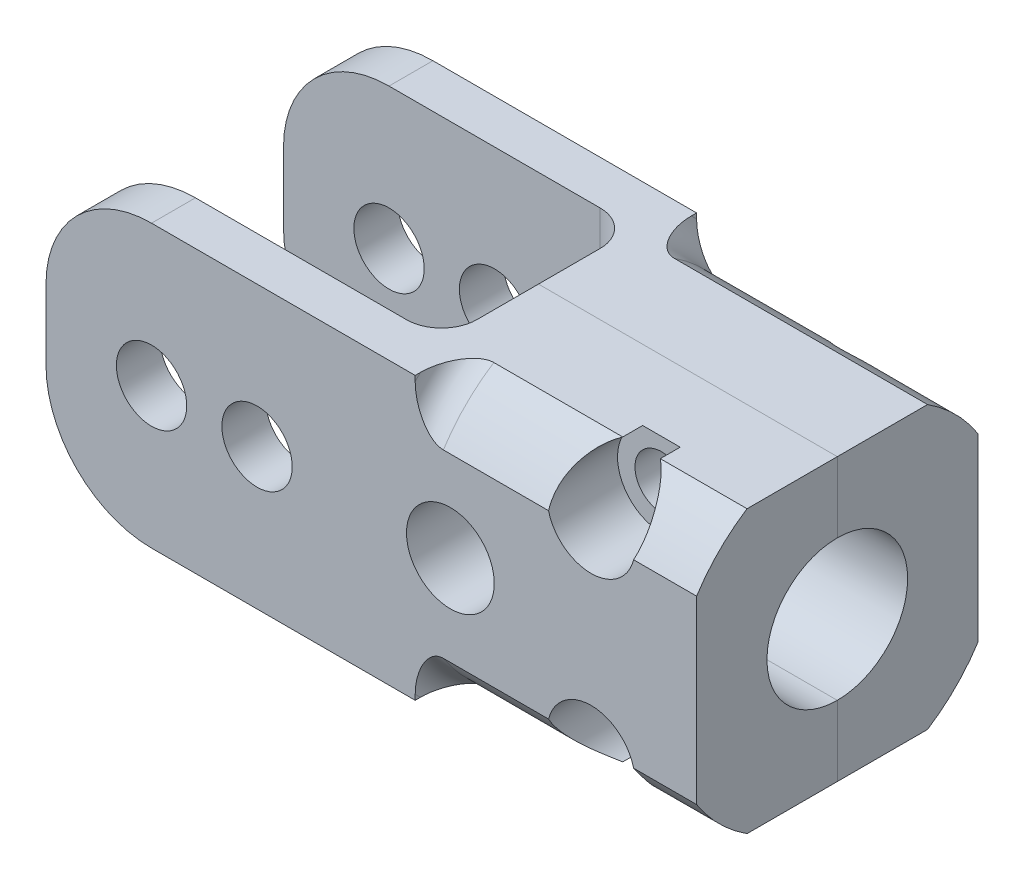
ISO-10303-21;
HEADER;
FILE_DESCRIPTION(('STEP AP214'),'2;1');
FILE_NAME('part.step','',(''),(''),'','','');
FILE_SCHEMA(('AUTOMOTIVE_DESIGN { 1 0 10303 214 1 1 1 1 }'));
ENDSEC;
DATA;
#1=APPLICATION_CONTEXT('core data for automotive mechanical design processes');
#2=APPLICATION_PROTOCOL_DEFINITION('international standard','automotive_design',2000,#1);
#3=PRODUCT_CONTEXT('',#1,'mechanical');
#4=PRODUCT('Part','Part','',(#3));
#5=PRODUCT_RELATED_PRODUCT_CATEGORY('part','',(#4));
#6=PRODUCT_DEFINITION_FORMATION('','',#4);
#7=PRODUCT_DEFINITION_CONTEXT('part definition',#1,'design');
#8=PRODUCT_DEFINITION('design','',#6,#7);
#9=PRODUCT_DEFINITION_SHAPE('','',#8);
#10=(LENGTH_UNIT() NAMED_UNIT(*) SI_UNIT(.MILLI.,.METRE.));
#11=(NAMED_UNIT(*) PLANE_ANGLE_UNIT() SI_UNIT($,.RADIAN.));
#12=(NAMED_UNIT(*) SI_UNIT($,.STERADIAN.) SOLID_ANGLE_UNIT());
#13=UNCERTAINTY_MEASURE_WITH_UNIT(LENGTH_MEASURE(1.E-05),#10,'distance_accuracy_value','');
#14=(GEOMETRIC_REPRESENTATION_CONTEXT(3) GLOBAL_UNCERTAINTY_ASSIGNED_CONTEXT((#13)) GLOBAL_UNIT_ASSIGNED_CONTEXT((#10,
#11,#12)) REPRESENTATION_CONTEXT('',''));
#15=CARTESIAN_POINT('',(0.,0.,0.));
#16=DIRECTION('',(0.,0.,1.));
#17=DIRECTION('',(1.,0.,0.));
#18=AXIS2_PLACEMENT_3D('',#15,#16,#17);
#19=CARTESIAN_POINT('',(49.1998,12.7,12.7));
#20=DIRECTION('',(-1.,0.,0.));
#21=DIRECTION('',(0.,-1.,0.));
#22=AXIS2_PLACEMENT_3D('',#19,#20,#21);
#23=PLANE('',#22);
#24=CARTESIAN_POINT('',(49.1998,0.,0.));
#25=DIRECTION('',(1.,0.,0.));
#26=DIRECTION('',(0.,1.,0.));
#27=AXIS2_PLACEMENT_3D('',#24,#25,#26);
#28=CIRCLE('',#27,15.0876);
#29=CARTESIAN_POINT('',(49.1998,-8.14528537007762,12.7));
#30=VERTEX_POINT('',#29);
#31=CARTESIAN_POINT('',(49.1998,-12.7,8.14528537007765));
#32=VERTEX_POINT('',#31);
#33=EDGE_CURVE('E221',#30,#32,#28,.T.);
#34=ORIENTED_EDGE('',*,*,#33,.T.);
#35=DIRECTION('',(0.,0.,-1.));
#36=VECTOR('',#35,1.);
#37=CARTESIAN_POINT('',(49.1998,-12.7,12.7));
#38=LINE('',#37,#36);
#39=CARTESIAN_POINT('',(49.1998,-12.7,0.));
#40=VERTEX_POINT('',#39);
#41=EDGE_CURVE('E240',#32,#40,#38,.T.);
#42=ORIENTED_EDGE('',*,*,#41,.T.);
#43=DIRECTION('',(0.,1.,0.));
#44=VECTOR('',#43,1.);
#45=CARTESIAN_POINT('',(49.1998,12.7,0.));
#46=LINE('',#45,#44);
#47=CARTESIAN_POINT('',(49.1998,-6.35,0.));
#48=VERTEX_POINT('',#47);
#49=EDGE_CURVE('E503',#40,#48,#46,.T.);
#50=ORIENTED_EDGE('',*,*,#49,.T.);
#51=CARTESIAN_POINT('',(49.1998,0.,0.));
#52=DIRECTION('',(-1.,0.,0.));
#53=DIRECTION('',(0.,-1.,0.));
#54=AXIS2_PLACEMENT_3D('',#51,#52,#53);
#55=CIRCLE('',#54,6.35);
#56=CARTESIAN_POINT('',(49.1998,6.35,0.));
#57=VERTEX_POINT('',#56);
#58=EDGE_CURVE('E316',#57,#48,#55,.F.);
#59=ORIENTED_EDGE('',*,*,#58,.F.);
#60=CARTESIAN_POINT('',(49.1998,12.7,0.));
#61=VERTEX_POINT('',#60);
#62=EDGE_CURVE('E237',#57,#61,#46,.T.);
#63=ORIENTED_EDGE('',*,*,#62,.T.);
#64=DIRECTION('',(0.,0.,-1.));
#65=VECTOR('',#64,1.);
#66=CARTESIAN_POINT('',(49.1998,12.7,12.7));
#67=LINE('',#66,#65);
#68=CARTESIAN_POINT('',(49.1998,12.7,8.14528537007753));
#69=VERTEX_POINT('',#68);
#70=EDGE_CURVE('E227',#69,#61,#67,.T.);
#71=ORIENTED_EDGE('',*,*,#70,.F.);
#72=CARTESIAN_POINT('',(49.1998,8.14528537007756,12.7));
#73=VERTEX_POINT('',#72);
#74=EDGE_CURVE('E209',#69,#73,#28,.T.);
#75=ORIENTED_EDGE('',*,*,#74,.T.);
#76=DIRECTION('',(0.,1.,0.));
#77=VECTOR('',#76,1.);
#78=CARTESIAN_POINT('',(49.1998,0.,12.7));
#79=LINE('',#78,#77);
#80=EDGE_CURVE('E518',#30,#73,#79,.T.);
#81=ORIENTED_EDGE('',*,*,#80,.F.);
#82=EDGE_LOOP('',(#34,#42,#50,#59,#63,#71,#75,#81));
#83=FACE_BOUND('',#82,.T.);
#84=ADVANCED_FACE('F45',(#83),#23,.F.);
#85=CARTESIAN_POINT('',(0.,0.,12.7));
#86=DIRECTION('',(0.,0.,-1.));
#87=DIRECTION('',(-1.,0.,0.));
#88=AXIS2_PLACEMENT_3D('',#85,#86,#87);
#89=PLANE('',#88);
#90=CARTESIAN_POINT('',(9.525,0.,12.7));
#91=DIRECTION('',(0.,0.,-1.));
#92=DIRECTION('',(-1.,0.,0.));
#93=AXIS2_PLACEMENT_3D('',#90,#91,#92);
#94=CIRCLE('',#93,3.175);
#95=CARTESIAN_POINT('',(6.35,0.,12.7));
#96=VERTEX_POINT('',#95);
#97=EDGE_CURVE('E487',#96,#96,#94,.T.);
#98=ORIENTED_EDGE('',*,*,#97,.T.);
#99=EDGE_LOOP('',(#98));
#100=FACE_BOUND('',#99,.T.);
#101=CARTESIAN_POINT('',(0.,0.,12.7));
#102=DIRECTION('',(0.,0.,1.));
#103=DIRECTION('',(1.,0.,0.));
#104=AXIS2_PLACEMENT_3D('',#101,#102,#103);
#105=CIRCLE('',#104,3.175);
#106=CARTESIAN_POINT('',(3.175,0.,12.7));
#107=VERTEX_POINT('',#106);
#108=EDGE_CURVE('E508',#107,#107,#105,.T.);
#109=ORIENTED_EDGE('',*,*,#108,.F.);
#110=EDGE_LOOP('',(#109));
#111=FACE_BOUND('',#110,.T.);
#112=CARTESIAN_POINT('',(26.9748,0.,12.7));
#113=DIRECTION('',(0.,0.,-1.));
#114=DIRECTION('',(-1.,0.,0.));
#115=AXIS2_PLACEMENT_3D('',#112,#113,#114);
#116=CIRCLE('',#115,3.96239999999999);
#117=CARTESIAN_POINT('',(23.0124,0.,12.7));
#118=VERTEX_POINT('',#117);
#119=EDGE_CURVE('E426',#118,#118,#116,.F.);
#120=ORIENTED_EDGE('',*,*,#119,.F.);
#121=EDGE_LOOP('',(#120));
#122=FACE_BOUND('',#121,.T.);
#123=DIRECTION('',(0.,-1.,0.));
#124=VECTOR('',#123,1.);
#125=CARTESIAN_POINT('',(23.7998,0.,12.7));
#126=LINE('',#125,#124);
#127=CARTESIAN_POINT('',(23.7998,12.7,12.7));
#128=VERTEX_POINT('',#127);
#129=CARTESIAN_POINT('',(23.7998,12.2246587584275,12.7));
#130=VERTEX_POINT('',#129);
#131=EDGE_CURVE('E482',#128,#130,#126,.T.);
#132=ORIENTED_EDGE('',*,*,#131,.F.);
#133=DIRECTION('',(-1.,0.,0.));
#134=VECTOR('',#133,1.);
#135=CARTESIAN_POINT('',(0.,12.7,12.7));
#136=LINE('',#135,#134);
#137=CARTESIAN_POINT('',(0.,12.7,12.7));
#138=VERTEX_POINT('',#137);
#139=EDGE_CURVE('E521',#128,#138,#136,.T.);
#140=ORIENTED_EDGE('',*,*,#139,.T.);
#141=CARTESIAN_POINT('',(0.,3.175,12.7));
#142=DIRECTION('',(0.,0.,-1.));
#143=DIRECTION('',(-1.,0.,0.));
#144=AXIS2_PLACEMENT_3D('',#141,#142,#143);
#145=CIRCLE('',#144,9.525);
#146=CARTESIAN_POINT('',(-9.525,3.175,12.7));
#147=VERTEX_POINT('',#146);
#148=EDGE_CURVE('E432',#138,#147,#145,.F.);
#149=ORIENTED_EDGE('',*,*,#148,.T.);
#150=DIRECTION('',(0.,-1.,0.));
#151=VECTOR('',#150,1.);
#152=CARTESIAN_POINT('',(-9.525,-12.7,12.7));
#153=LINE('',#152,#151);
#154=CARTESIAN_POINT('',(-9.525,-3.175,12.7));
#155=VERTEX_POINT('',#154);
#156=EDGE_CURVE('E524',#147,#155,#153,.T.);
#157=ORIENTED_EDGE('',*,*,#156,.T.);
#158=CARTESIAN_POINT('',(0.,-3.175,12.7));
#159=DIRECTION('',(0.,0.,-1.));
#160=DIRECTION('',(-1.,0.,0.));
#161=AXIS2_PLACEMENT_3D('',#158,#159,#160);
#162=CIRCLE('',#161,9.525);
#163=CARTESIAN_POINT('',(0.,-12.7,12.7));
#164=VERTEX_POINT('',#163);
#165=EDGE_CURVE('E431',#155,#164,#162,.F.);
#166=ORIENTED_EDGE('',*,*,#165,.T.);
#167=DIRECTION('',(1.,0.,0.));
#168=VECTOR('',#167,1.);
#169=CARTESIAN_POINT('',(0.,-12.7,12.7));
#170=LINE('',#169,#168);
#171=CARTESIAN_POINT('',(23.7998,-12.7,12.7));
#172=VERTEX_POINT('',#171);
#173=EDGE_CURVE('E244',#164,#172,#170,.T.);
#174=ORIENTED_EDGE('',*,*,#173,.T.);
#175=CARTESIAN_POINT('',(23.7998,-12.2246587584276,12.7));
#176=VERTEX_POINT('',#175);
#177=EDGE_CURVE('E485',#176,#172,#126,.T.);
#178=ORIENTED_EDGE('',*,*,#177,.F.);
#179=CARTESIAN_POINT('',(23.7998,-12.2246587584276,12.7));
#180=CARTESIAN_POINT('',(23.7998403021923,-12.0685573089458,12.7));
#181=CARTESIAN_POINT('',(23.8067212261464,-11.9125022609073,12.7));
#182=CARTESIAN_POINT('',(23.8336202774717,-11.6014870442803,12.7));
#183=CARTESIAN_POINT('',(23.8536413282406,-11.4465271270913,12.7));
#184=CARTESIAN_POINT('',(23.9065432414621,-11.1372126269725,12.7));
#185=CARTESIAN_POINT('',(23.9395525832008,-10.9828801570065,12.7));
#186=CARTESIAN_POINT('',(24.0181808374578,-10.6774807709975,12.7));
#187=CARTESIAN_POINT('',(24.0637968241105,-10.5264131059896,12.7));
#188=CARTESIAN_POINT('',(24.1554623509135,-10.2638045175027,12.7));
#189=CARTESIAN_POINT('',(24.1988765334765,-10.1513381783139,12.7));
#190=CARTESIAN_POINT('',(24.2933076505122,-9.92965144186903,12.7));
#191=CARTESIAN_POINT('',(24.344323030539,-9.82043038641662,12.7));
#192=CARTESIAN_POINT('',(24.4541354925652,-9.60641256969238,12.7));
#193=CARTESIAN_POINT('',(24.5129059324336,-9.50160221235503,12.7));
#194=CARTESIAN_POINT('',(24.6388826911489,-9.29722818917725,12.7));
#195=CARTESIAN_POINT('',(24.7060838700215,-9.19766137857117,12.7));
#196=CARTESIAN_POINT('',(24.856288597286,-8.9965794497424,12.7));
#197=CARTESIAN_POINT('',(24.9401744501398,-8.89571510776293,12.7));
#198=CARTESIAN_POINT('',(25.1202990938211,-8.70543239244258,12.7));
#199=CARTESIAN_POINT('',(25.2165342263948,-8.61601064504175,12.7));
#200=CARTESIAN_POINT('',(25.3994842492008,-8.4721419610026,12.7));
#201=CARTESIAN_POINT('',(25.4835375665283,-8.41434233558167,12.7));
#202=CARTESIAN_POINT('',(25.6595770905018,-8.31284079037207,12.7));
#203=CARTESIAN_POINT('',(25.7515266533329,-8.26907778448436,12.7));
#204=CARTESIAN_POINT('',(25.8859483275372,-8.2201707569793,12.7));
#205=CARTESIAN_POINT('',(25.9257314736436,-8.20744753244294,12.7));
#206=CARTESIAN_POINT('',(26.0062205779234,-8.18536365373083,12.7));
#207=CARTESIAN_POINT('',(26.0469262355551,-8.17600192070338,12.7));
#208=CARTESIAN_POINT('',(26.1294517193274,-8.16080399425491,12.7));
#209=CARTESIAN_POINT('',(26.1712788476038,-8.15500724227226,12.7));
#210=CARTESIAN_POINT('',(26.2553334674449,-8.14723637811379,12.7));
#211=CARTESIAN_POINT('',(26.2975613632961,-8.14526665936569,12.7));
#212=CARTESIAN_POINT('',(26.3398,-8.14528537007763,12.7));
#213=B_SPLINE_CURVE_WITH_KNOTS('',3,(#179,#180,#181,#182,#183,#184,#185,#186,#187,#188,#189,
#190,#191,#192,#193,#194,#195,#196,#197,#198,#199,#200,#201,#202,#203,#204,#205,#206,#207,#208,
#209,#210,#211,#212),.UNSPECIFIED.,.F.,.F.,(4,2,2,2,2,2,2,2,2,2,2,2,2,2,2,2,4),(0.,
0.468090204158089,0.93628458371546,1.40923169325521,1.88206912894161,2.24348042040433,
2.60481790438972,2.96494486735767,3.32485332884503,3.71759256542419,4.11021572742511,
4.41529673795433,4.71903145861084,4.84421834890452,4.96936502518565,5.09587247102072,
5.22252506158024),.UNSPECIFIED.);
#214=CARTESIAN_POINT('',(26.3398,-8.14528537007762,12.7));
#215=VERTEX_POINT('',#214);
#216=EDGE_CURVE('E362',#176,#215,#213,.T.);
#217=ORIENTED_EDGE('',*,*,#216,.T.);
#218=DIRECTION('',(1.,0.,0.));
#219=VECTOR('',#218,1.);
#220=CARTESIAN_POINT('',(23.7998,-8.14528537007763,12.7));
#221=LINE('',#220,#219);
#222=CARTESIAN_POINT('',(35.8338011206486,-8.14528537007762,12.7));
#223=VERTEX_POINT('',#222);
#224=EDGE_CURVE('E472',#223,#215,#221,.F.);
#225=ORIENTED_EDGE('',*,*,#224,.F.);
#226=CARTESIAN_POINT('',(39.6748,-9.1186,12.7));
#227=DIRECTION('',(0.,0.,-1.));
#228=DIRECTION('',(-1.,0.,0.));
#229=AXIS2_PLACEMENT_3D('',#226,#227,#228);
#230=CIRCLE('',#229,3.96239999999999);
#231=CARTESIAN_POINT('',(43.5157988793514,-8.14528537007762,12.7));
#232=VERTEX_POINT('',#231);
#233=EDGE_CURVE('E562',#232,#223,#230,.F.);
#234=ORIENTED_EDGE('',*,*,#233,.F.);
#235=EDGE_CURVE('E473',#30,#232,#221,.F.);
#236=ORIENTED_EDGE('',*,*,#235,.F.);
#237=ORIENTED_EDGE('',*,*,#80,.T.);
#238=DIRECTION('',(1.,0.,0.));
#239=VECTOR('',#238,1.);
#240=CARTESIAN_POINT('',(23.7998,8.14528537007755,12.7));
#241=LINE('',#240,#239);
#242=CARTESIAN_POINT('',(43.5157988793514,8.14528537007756,12.7));
#243=VERTEX_POINT('',#242);
#244=EDGE_CURVE('E215',#243,#73,#241,.T.);
#245=ORIENTED_EDGE('',*,*,#244,.F.);
#246=CARTESIAN_POINT('',(39.6748,9.1186,12.7));
#247=DIRECTION('',(0.,0.,-1.));
#248=DIRECTION('',(-1.,0.,0.));
#249=AXIS2_PLACEMENT_3D('',#246,#247,#248);
#250=CIRCLE('',#249,3.96239999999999);
#251=CARTESIAN_POINT('',(35.8338011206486,8.14528537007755,12.7));
#252=VERTEX_POINT('',#251);
#253=EDGE_CURVE('E588',#252,#243,#250,.F.);
#254=ORIENTED_EDGE('',*,*,#253,.F.);
#255=CARTESIAN_POINT('',(26.3398,8.14528537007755,12.7));
#256=VERTEX_POINT('',#255);
#257=EDGE_CURVE('E477',#256,#252,#241,.T.);
#258=ORIENTED_EDGE('',*,*,#257,.F.);
#259=CARTESIAN_POINT('',(26.3398,8.14528537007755,12.7));
#260=CARTESIAN_POINT('',(26.2980855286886,8.14526755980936,12.7));
#261=CARTESIAN_POINT('',(26.2563811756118,8.1471882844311,12.7));
#262=CARTESIAN_POINT('',(26.1733591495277,8.15476836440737,12.7));
#263=CARTESIAN_POINT('',(26.132041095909,8.16042353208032,12.7));
#264=CARTESIAN_POINT('',(26.0505130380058,8.17525281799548,12.7));
#265=CARTESIAN_POINT('',(26.010295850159,8.18438764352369,12.7));
#266=CARTESIAN_POINT('',(25.9307513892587,8.20594322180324,12.7));
#267=CARTESIAN_POINT('',(25.8914244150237,8.21836506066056,12.7));
#268=CARTESIAN_POINT('',(25.7554285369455,8.2672384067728,12.7));
#269=CARTESIAN_POINT('',(25.6615695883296,8.3117115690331,12.7));
#270=CARTESIAN_POINT('',(25.4819889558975,8.41521547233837,12.7));
#271=CARTESIAN_POINT('',(25.396308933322,8.47431575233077,12.7));
#272=CARTESIAN_POINT('',(25.2513267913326,8.58891919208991,12.7));
#273=CARTESIAN_POINT('',(25.1903638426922,8.6423623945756,12.7));
#274=CARTESIAN_POINT('',(25.0733049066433,8.75435714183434,12.7));
#275=CARTESIAN_POINT('',(25.0172117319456,8.81291160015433,12.7));
#276=CARTESIAN_POINT('',(24.855641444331,8.99476959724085,12.7));
#277=CARTESIAN_POINT('',(24.7569908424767,9.12416994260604,12.7));
#278=CARTESIAN_POINT('',(24.5915922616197,9.37007077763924,12.7));
#279=CARTESIAN_POINT('',(24.5222795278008,9.48490403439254,12.7));
#280=CARTESIAN_POINT('',(24.3936641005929,9.72013740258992,12.7));
#281=CARTESIAN_POINT('',(24.3343676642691,9.84054093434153,12.7));
#282=CARTESIAN_POINT('',(24.2252219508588,10.0856842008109,12.7));
#283=CARTESIAN_POINT('',(24.1753833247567,10.2104286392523,12.7));
#284=CARTESIAN_POINT('',(24.0849228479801,10.4632185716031,12.7));
#285=CARTESIAN_POINT('',(24.0443016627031,10.5912643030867,12.7));
#286=CARTESIAN_POINT('',(23.974059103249,10.8432201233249,12.7));
#287=CARTESIAN_POINT('',(23.9439782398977,10.9670026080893,12.7));
#288=CARTESIAN_POINT('',(23.8921144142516,11.2162871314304,12.7));
#289=CARTESIAN_POINT('',(23.8703309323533,11.341789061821,12.7));
#290=CARTESIAN_POINT('',(23.8353607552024,11.5932054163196,12.7));
#291=CARTESIAN_POINT('',(23.8221220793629,11.7191125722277,12.7));
#292=CARTESIAN_POINT('',(23.8043495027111,11.9715581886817,12.7));
#293=CARTESIAN_POINT('',(23.7998170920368,12.0980967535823,12.7));
#294=CARTESIAN_POINT('',(23.7998,12.2246587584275,12.7));
#295=B_SPLINE_CURVE_WITH_KNOTS('',3,(#259,#260,#261,#262,#263,#264,#265,#266,#267,#268,#269,
#270,#271,#272,#273,#274,#275,#276,#277,#278,#279,#280,#281,#282,#283,#284,#285,#286,#287,#288,
#289,#290,#291,#292,#293,#294),.UNSPECIFIED.,.F.,.F.,(4,2,2,2,2,2,2,2,2,2,2,2,2,2,2,2,2,4),(0.,
0.125082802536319,0.250025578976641,0.37359741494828,0.497210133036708,0.806926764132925,
1.11814510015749,1.36102234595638,1.60403895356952,2.09052521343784,2.49245251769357,
2.89462998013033,3.29725770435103,3.69991448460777,4.0817909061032,4.46364340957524,
4.84315053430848,5.22272260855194),.UNSPECIFIED.);
#296=EDGE_CURVE('E58',#256,#130,#295,.T.);
#297=ORIENTED_EDGE('',*,*,#296,.T.);
#298=EDGE_LOOP('',(#132,#140,#149,#157,#166,#174,#178,#217,#225,#234,#236,#237,#245,#254,#258,#297));
#299=FACE_BOUND('',#298,.T.);
#300=ADVANCED_FACE('F352',(#100,#111,#122,#299),#89,.F.);
#301=CARTESIAN_POINT('',(49.1998,-12.7,12.7));
#302=DIRECTION('',(0.,1.,0.));
#303=DIRECTION('',(0.,0.,1.));
#304=AXIS2_PLACEMENT_3D('',#301,#302,#303);
#305=PLANE('',#304);
#306=DIRECTION('',(0.,0.,-1.));
#307=VECTOR('',#306,1.);
#308=CARTESIAN_POINT('',(23.7998,-12.7,12.7));
#309=LINE('',#308,#307);
#310=CARTESIAN_POINT('',(23.7998,-12.7,12.2246587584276));
#311=VERTEX_POINT('',#310);
#312=EDGE_CURVE('E484',#172,#311,#309,.T.);
#313=ORIENTED_EDGE('',*,*,#312,.F.);
#314=ORIENTED_EDGE('',*,*,#173,.F.);
#315=DIRECTION('',(0.,0.,-1.));
#316=VECTOR('',#315,1.);
#317=CARTESIAN_POINT('',(0.,-12.7,12.7));
#318=LINE('',#317,#316);
#319=CARTESIAN_POINT('',(0.,-12.7,8.7376));
#320=VERTEX_POINT('',#319);
#321=EDGE_CURVE('E290',#164,#320,#318,.T.);
#322=ORIENTED_EDGE('',*,*,#321,.T.);
#323=DIRECTION('',(1.,0.,0.));
#324=VECTOR('',#323,1.);
#325=CARTESIAN_POINT('',(49.1998,-12.7,8.7376));
#326=LINE('',#325,#324);
#327=CARTESIAN_POINT('',(19.05,-12.7,8.7376));
#328=VERTEX_POINT('',#327);
#329=EDGE_CURVE('E250',#320,#328,#326,.T.);
#330=ORIENTED_EDGE('',*,*,#329,.T.);
#331=CARTESIAN_POINT('',(19.05,-12.7,5.5626));
#332=DIRECTION('',(0.,1.,0.));
#333=DIRECTION('',(0.,0.,1.));
#334=AXIS2_PLACEMENT_3D('',#331,#332,#333);
#335=CIRCLE('',#334,3.175);
#336=CARTESIAN_POINT('',(22.225,-12.7,5.5626));
#337=VERTEX_POINT('',#336);
#338=EDGE_CURVE('E281',#328,#337,#335,.T.);
#339=ORIENTED_EDGE('',*,*,#338,.T.);
#340=DIRECTION('',(0.,0.,-1.));
#341=VECTOR('',#340,1.);
#342=CARTESIAN_POINT('',(22.225,-12.7,12.7));
#343=LINE('',#342,#341);
#344=CARTESIAN_POINT('',(22.225,-12.7,0.));
#345=VERTEX_POINT('',#344);
#346=EDGE_CURVE('E239',#337,#345,#343,.T.);
#347=ORIENTED_EDGE('',*,*,#346,.T.);
#348=DIRECTION('',(1.,0.,0.));
#349=VECTOR('',#348,1.);
#350=CARTESIAN_POINT('',(49.1998,-12.7,0.));
#351=LINE('',#350,#349);
#352=EDGE_CURVE('E516',#345,#40,#351,.T.);
#353=ORIENTED_EDGE('',*,*,#352,.T.);
#354=ORIENTED_EDGE('',*,*,#41,.F.);
#355=DIRECTION('',(1.,0.,0.));
#356=VECTOR('',#355,1.);
#357=CARTESIAN_POINT('',(23.7998,-12.7,8.14528537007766));
#358=LINE('',#357,#356);
#359=CARTESIAN_POINT('',(41.37014297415,-12.7,8.14528537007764));
#360=VERTEX_POINT('',#359);
#361=EDGE_CURVE('E220',#360,#32,#358,.T.);
#362=ORIENTED_EDGE('',*,*,#361,.F.);
#363=DIRECTION('',(0.,0.,-1.));
#364=VECTOR('',#363,1.);
#365=CARTESIAN_POINT('',(41.37014297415,-12.7,19.05));
#366=LINE('',#365,#364);
#367=CARTESIAN_POINT('',(41.37014297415,-12.7,6.35));
#368=VERTEX_POINT('',#367);
#369=EDGE_CURVE('E269',#368,#360,#366,.F.);
#370=ORIENTED_EDGE('',*,*,#369,.F.);
#371=DIRECTION('',(1.,0.,0.));
#372=VECTOR('',#371,1.);
#373=CARTESIAN_POINT('',(49.1998,-12.7,6.35));
#374=LINE('',#373,#372);
#375=CARTESIAN_POINT('',(37.9794570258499,-12.7,6.35));
#376=VERTEX_POINT('',#375);
#377=EDGE_CURVE('E266',#376,#368,#374,.T.);
#378=ORIENTED_EDGE('',*,*,#377,.F.);
#379=DIRECTION('',(0.,0.,-1.));
#380=VECTOR('',#379,1.);
#381=CARTESIAN_POINT('',(37.9794570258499,-12.7,19.05));
#382=LINE('',#381,#380);
#383=CARTESIAN_POINT('',(37.9794570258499,-12.7,8.14528537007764));
#384=VERTEX_POINT('',#383);
#385=EDGE_CURVE('E262',#384,#376,#382,.T.);
#386=ORIENTED_EDGE('',*,*,#385,.F.);
#387=CARTESIAN_POINT('',(26.3398,-12.7,8.14528537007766));
#388=VERTEX_POINT('',#387);
#389=EDGE_CURVE('E568',#388,#384,#358,.T.);
#390=ORIENTED_EDGE('',*,*,#389,.F.);
#391=CARTESIAN_POINT('',(26.3398,-12.7,8.14528537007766));
#392=CARTESIAN_POINT('',(26.2980855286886,-12.7,8.14526755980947));
#393=CARTESIAN_POINT('',(26.2563811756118,-12.7,8.1471882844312));
#394=CARTESIAN_POINT('',(26.1733591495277,-12.7,8.15476836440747));
#395=CARTESIAN_POINT('',(26.132041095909,-12.7,8.16042353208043));
#396=CARTESIAN_POINT('',(26.0505130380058,-12.7,8.17525281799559));
#397=CARTESIAN_POINT('',(26.010295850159,-12.7,8.1843876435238));
#398=CARTESIAN_POINT('',(25.9307513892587,-12.7,8.20594322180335));
#399=CARTESIAN_POINT('',(25.8914244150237,-12.7,8.21836506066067));
#400=CARTESIAN_POINT('',(25.7554285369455,-12.7,8.2672384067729));
#401=CARTESIAN_POINT('',(25.6615695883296,-12.7,8.31171156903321));
#402=CARTESIAN_POINT('',(25.4819889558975,-12.7,8.41521547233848));
#403=CARTESIAN_POINT('',(25.396308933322,-12.7,8.47431575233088));
#404=CARTESIAN_POINT('',(25.2513267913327,-12.7,8.58891919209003));
#405=CARTESIAN_POINT('',(25.1903638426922,-12.7,8.64236239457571));
#406=CARTESIAN_POINT('',(25.0733049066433,-12.7,8.75435714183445));
#407=CARTESIAN_POINT('',(25.0172117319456,-12.7,8.81291160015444));
#408=CARTESIAN_POINT('',(24.855641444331,-12.7,8.99476959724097));
#409=CARTESIAN_POINT('',(24.7569908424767,-12.7,9.12416994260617));
#410=CARTESIAN_POINT('',(24.5915922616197,-12.7,9.37007077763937));
#411=CARTESIAN_POINT('',(24.5222795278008,-12.7,9.48490403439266));
#412=CARTESIAN_POINT('',(24.3936641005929,-12.7,9.72013740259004));
#413=CARTESIAN_POINT('',(24.3343676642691,-12.7,9.84054093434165));
#414=CARTESIAN_POINT('',(24.2252219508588,-12.7,10.085684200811));
#415=CARTESIAN_POINT('',(24.1753833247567,-12.7,10.2104286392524));
#416=CARTESIAN_POINT('',(24.0849228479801,-12.7,10.4632185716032));
#417=CARTESIAN_POINT('',(24.0443016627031,-12.7,10.5912643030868));
#418=CARTESIAN_POINT('',(23.974059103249,-12.7,10.843220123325));
#419=CARTESIAN_POINT('',(23.9439782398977,-12.7,10.9670026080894));
#420=CARTESIAN_POINT('',(23.8921144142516,-12.7,11.2162871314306));
#421=CARTESIAN_POINT('',(23.8703309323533,-12.7,11.3417890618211));
#422=CARTESIAN_POINT('',(23.8353607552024,-12.7,11.5932054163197));
#423=CARTESIAN_POINT('',(23.8221220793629,-12.7,11.7191125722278));
#424=CARTESIAN_POINT('',(23.8043495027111,-12.7,11.9715581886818));
#425=CARTESIAN_POINT('',(23.7998170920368,-12.7,12.0980967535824));
#426=CARTESIAN_POINT('',(23.7998,-12.7,12.2246587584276));
#427=B_SPLINE_CURVE_WITH_KNOTS('',3,(#391,#392,#393,#394,#395,#396,#397,#398,#399,#400,#401,
#402,#403,#404,#405,#406,#407,#408,#409,#410,#411,#412,#413,#414,#415,#416,#417,#418,#419,#420,
#421,#422,#423,#424,#425,#426),.UNSPECIFIED.,.F.,.F.,(4,2,2,2,2,2,2,2,2,2,2,2,2,2,2,2,2,4),(0.,
0.125082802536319,0.250025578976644,0.373597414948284,0.497210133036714,0.806926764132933,
1.11814510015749,1.36102234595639,1.60403895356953,2.09052521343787,2.49245251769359,
2.89462998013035,3.29725770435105,3.69991448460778,4.0817909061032,4.46364340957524,
4.84315053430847,5.22272260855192),.UNSPECIFIED.);
#428=EDGE_CURVE('E370',#388,#311,#427,.T.);
#429=ORIENTED_EDGE('',*,*,#428,.T.);
#430=EDGE_LOOP('',(#313,#314,#322,#330,#339,#347,#353,#354,#362,#370,#378,#386,#390,#429));
#431=FACE_BOUND('',#430,.T.);
#432=ADVANCED_FACE('F356',(#431),#305,.F.);
#433=CARTESIAN_POINT('',(-9.525,12.7,12.7));
#434=DIRECTION('',(0.,-1.,0.));
#435=DIRECTION('',(0.,0.,-1.));
#436=AXIS2_PLACEMENT_3D('',#433,#434,#435);
#437=PLANE('',#436);
#438=DIRECTION('',(1.,0.,0.));
#439=VECTOR('',#438,1.);
#440=CARTESIAN_POINT('',(23.7998,12.7,8.14528537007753));
#441=LINE('',#440,#439);
#442=CARTESIAN_POINT('',(41.37014297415,12.7,8.14528537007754));
#443=VERTEX_POINT('',#442);
#444=EDGE_CURVE('E212',#69,#443,#441,.F.);
#445=ORIENTED_EDGE('',*,*,#444,.F.);
#446=ORIENTED_EDGE('',*,*,#70,.T.);
#447=DIRECTION('',(-1.,0.,0.));
#448=VECTOR('',#447,1.);
#449=CARTESIAN_POINT('',(-9.525,12.7,0.));
#450=LINE('',#449,#448);
#451=CARTESIAN_POINT('',(22.225,12.7,0.));
#452=VERTEX_POINT('',#451);
#453=EDGE_CURVE('E507',#61,#452,#450,.T.);
#454=ORIENTED_EDGE('',*,*,#453,.T.);
#455=DIRECTION('',(0.,0.,1.));
#456=VECTOR('',#455,1.);
#457=CARTESIAN_POINT('',(22.225,12.7,12.7));
#458=LINE('',#457,#456);
#459=CARTESIAN_POINT('',(22.225,12.7,5.5626));
#460=VERTEX_POINT('',#459);
#461=EDGE_CURVE('E544',#452,#460,#458,.T.);
#462=ORIENTED_EDGE('',*,*,#461,.T.);
#463=CARTESIAN_POINT('',(19.05,12.7,5.5626));
#464=DIRECTION('',(0.,-1.,0.));
#465=DIRECTION('',(0.,0.,-1.));
#466=AXIS2_PLACEMENT_3D('',#463,#464,#465);
#467=CIRCLE('',#466,3.175);
#468=CARTESIAN_POINT('',(19.05,12.7,8.7376));
#469=VERTEX_POINT('',#468);
#470=EDGE_CURVE('E279',#460,#469,#467,.T.);
#471=ORIENTED_EDGE('',*,*,#470,.T.);
#472=DIRECTION('',(-1.,0.,0.));
#473=VECTOR('',#472,1.);
#474=CARTESIAN_POINT('',(-9.525,12.7,8.7376));
#475=LINE('',#474,#473);
#476=CARTESIAN_POINT('',(0.,12.7,8.7376));
#477=VERTEX_POINT('',#476);
#478=EDGE_CURVE('E535',#469,#477,#475,.T.);
#479=ORIENTED_EDGE('',*,*,#478,.T.);
#480=DIRECTION('',(0.,0.,-1.));
#481=VECTOR('',#480,1.);
#482=CARTESIAN_POINT('',(0.,12.7,12.7));
#483=LINE('',#482,#481);
#484=EDGE_CURVE('E439',#477,#138,#483,.F.);
#485=ORIENTED_EDGE('',*,*,#484,.T.);
#486=ORIENTED_EDGE('',*,*,#139,.F.);
#487=DIRECTION('',(0.,0.,1.));
#488=VECTOR('',#487,1.);
#489=CARTESIAN_POINT('',(23.7998,12.7,12.7));
#490=LINE('',#489,#488);
#491=CARTESIAN_POINT('',(23.7998,12.7,12.2246587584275));
#492=VERTEX_POINT('',#491);
#493=EDGE_CURVE('E577',#492,#128,#490,.T.);
#494=ORIENTED_EDGE('',*,*,#493,.F.);
#495=CARTESIAN_POINT('',(23.7998,12.7,12.2246587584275));
#496=CARTESIAN_POINT('',(23.7998403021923,12.7,12.0685573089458));
#497=CARTESIAN_POINT('',(23.8067212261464,12.7,11.9125022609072));
#498=CARTESIAN_POINT('',(23.8336202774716,12.7,11.6014870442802));
#499=CARTESIAN_POINT('',(23.8536413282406,12.7,11.4465271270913));
#500=CARTESIAN_POINT('',(23.9065432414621,12.7,11.1372126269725));
#501=CARTESIAN_POINT('',(23.9395525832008,12.7,10.9828801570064));
#502=CARTESIAN_POINT('',(24.0181808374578,12.7,10.6774807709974));
#503=CARTESIAN_POINT('',(24.0637968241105,12.7,10.5264131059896));
#504=CARTESIAN_POINT('',(24.1554623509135,12.7,10.2638045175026));
#505=CARTESIAN_POINT('',(24.1988765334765,12.7,10.1513381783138));
#506=CARTESIAN_POINT('',(24.2933076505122,12.7,9.92965144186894));
#507=CARTESIAN_POINT('',(24.344323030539,12.7,9.82043038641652));
#508=CARTESIAN_POINT('',(24.4541354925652,12.7,9.60641256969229));
#509=CARTESIAN_POINT('',(24.5129059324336,12.7,9.50160221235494));
#510=CARTESIAN_POINT('',(24.6388826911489,12.7,9.29722818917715));
#511=CARTESIAN_POINT('',(24.7060838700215,12.7,9.19766137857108));
#512=CARTESIAN_POINT('',(24.856288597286,12.7,8.9965794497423));
#513=CARTESIAN_POINT('',(24.9401744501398,12.7,8.89571510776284));
#514=CARTESIAN_POINT('',(25.1202990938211,12.7,8.70543239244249));
#515=CARTESIAN_POINT('',(25.2165342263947,12.7,8.61601064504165));
#516=CARTESIAN_POINT('',(25.3994842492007,12.7,8.47214196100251));
#517=CARTESIAN_POINT('',(25.4835375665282,12.7,8.41434233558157));
#518=CARTESIAN_POINT('',(25.6595770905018,12.7,8.31284079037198));
#519=CARTESIAN_POINT('',(25.7515266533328,12.7,8.26907778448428));
#520=CARTESIAN_POINT('',(25.8859483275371,12.7,8.22017075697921));
#521=CARTESIAN_POINT('',(25.9257314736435,12.7,8.20744753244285));
#522=CARTESIAN_POINT('',(26.0062205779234,12.7,8.18536365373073));
#523=CARTESIAN_POINT('',(26.0469262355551,12.7,8.17600192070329));
#524=CARTESIAN_POINT('',(26.1294517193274,12.7,8.16080399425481));
#525=CARTESIAN_POINT('',(26.1712788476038,12.7,8.15500724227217));
#526=CARTESIAN_POINT('',(26.2553334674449,12.7,8.14723637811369));
#527=CARTESIAN_POINT('',(26.2975613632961,12.7,8.1452666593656));
#528=CARTESIAN_POINT('',(26.3398,12.7,8.14528537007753));
#529=B_SPLINE_CURVE_WITH_KNOTS('',3,(#495,#496,#497,#498,#499,#500,#501,#502,#503,#504,#505,
#506,#507,#508,#509,#510,#511,#512,#513,#514,#515,#516,#517,#518,#519,#520,#521,#522,#523,#524,
#525,#526,#527,#528),.UNSPECIFIED.,.F.,.F.,(4,2,2,2,2,2,2,2,2,2,2,2,2,2,2,2,4),(0.,
0.468090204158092,0.936284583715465,1.40923169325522,1.88206912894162,2.24348042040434,
2.60481790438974,2.96494486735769,3.32485332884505,3.7175925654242,4.11021572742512,
4.41529673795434,4.71903145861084,4.84421834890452,4.96936502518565,5.09587247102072,
5.22252506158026),.UNSPECIFIED.);
#530=CARTESIAN_POINT('',(26.3398,12.7,8.14528537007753));
#531=VERTEX_POINT('',#530);
#532=EDGE_CURVE('E13',#492,#531,#529,.T.);
#533=ORIENTED_EDGE('',*,*,#532,.T.);
#534=CARTESIAN_POINT('',(37.9794570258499,12.7,8.14528537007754));
#535=VERTEX_POINT('',#534);
#536=EDGE_CURVE('E233',#535,#531,#441,.F.);
#537=ORIENTED_EDGE('',*,*,#536,.F.);
#538=DIRECTION('',(0.,0.,-1.));
#539=VECTOR('',#538,1.);
#540=CARTESIAN_POINT('',(37.9794570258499,12.7,19.05));
#541=LINE('',#540,#539);
#542=CARTESIAN_POINT('',(37.9794570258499,12.7,6.35));
#543=VERTEX_POINT('',#542);
#544=EDGE_CURVE('E259',#543,#535,#541,.F.);
#545=ORIENTED_EDGE('',*,*,#544,.F.);
#546=DIRECTION('',(-1.,0.,0.));
#547=VECTOR('',#546,1.);
#548=CARTESIAN_POINT('',(-9.525,12.7,6.35));
#549=LINE('',#548,#547);
#550=CARTESIAN_POINT('',(41.37014297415,12.7,6.35));
#551=VERTEX_POINT('',#550);
#552=EDGE_CURVE('E256',#551,#543,#549,.T.);
#553=ORIENTED_EDGE('',*,*,#552,.F.);
#554=DIRECTION('',(0.,0.,-1.));
#555=VECTOR('',#554,1.);
#556=CARTESIAN_POINT('',(41.37014297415,12.7,19.05));
#557=LINE('',#556,#555);
#558=EDGE_CURVE('E230',#443,#551,#557,.T.);
#559=ORIENTED_EDGE('',*,*,#558,.F.);
#560=EDGE_LOOP('',(#445,#446,#454,#462,#471,#479,#485,#486,#494,#533,#537,#545,#553,#559));
#561=FACE_BOUND('',#560,.T.);
#562=ADVANCED_FACE('F225',(#561),#437,.F.);
#563=CARTESIAN_POINT('',(39.6748,9.1186,19.05));
#564=DIRECTION('',(0.,0.,-1.));
#565=DIRECTION('',(-1.,0.,0.));
#566=AXIS2_PLACEMENT_3D('',#563,#564,#565);
#567=CYLINDRICAL_SURFACE('',#566,3.96239999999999);
#568=ORIENTED_EDGE('',*,*,#253,.T.);
#569=CARTESIAN_POINT('',(43.5157988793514,8.14528537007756,12.7));
#570=CARTESIAN_POINT('',(43.5512841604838,8.28532189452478,12.610228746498));
#571=CARTESIAN_POINT('',(43.5785842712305,8.42520088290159,12.517207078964));
#572=CARTESIAN_POINT('',(43.6178365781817,8.70300963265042,12.32564099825));
#573=CARTESIAN_POINT('',(43.629813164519,8.84094214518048,12.227105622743));
#574=CARTESIAN_POINT('',(43.6394992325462,9.11233500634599,12.0261938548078));
#575=CARTESIAN_POINT('',(43.637348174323,9.24582603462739,11.9238648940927));
#576=CARTESIAN_POINT('',(43.6201388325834,9.50884680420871,11.7151905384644));
#577=CARTESIAN_POINT('',(43.6050743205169,9.63837460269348,11.6088432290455));
#578=CARTESIAN_POINT('',(43.5595515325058,9.91346241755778,11.3752622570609));
#579=CARTESIAN_POINT('',(43.5269807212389,10.058185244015,11.2474544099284));
#580=CARTESIAN_POINT('',(43.4469818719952,10.3403916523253,10.9885694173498));
#581=CARTESIAN_POINT('',(43.3995524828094,10.4778745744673,10.8574919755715));
#582=CARTESIAN_POINT('',(43.2905440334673,10.7458898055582,10.5923220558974));
#583=CARTESIAN_POINT('',(43.2288774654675,10.8763727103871,10.4582157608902));
#584=CARTESIAN_POINT('',(43.0923217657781,11.1290177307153,10.1889507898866));
#585=CARTESIAN_POINT('',(43.017434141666,11.2511807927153,10.0537922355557));
#586=CARTESIAN_POINT('',(42.8536542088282,11.4885350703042,9.78173205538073));
#587=CARTESIAN_POINT('',(42.7645775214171,11.6036021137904,9.64483303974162));
#588=CARTESIAN_POINT('',(42.5730984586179,11.8244938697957,9.37271184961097));
#589=CARTESIAN_POINT('',(42.4706888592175,11.9303135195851,9.23749062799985));
#590=CARTESIAN_POINT('',(42.2527234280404,12.1313690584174,8.97179622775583));
#591=CARTESIAN_POINT('',(42.1372602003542,12.2266710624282,8.84129732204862));
#592=CARTESIAN_POINT('',(41.8914976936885,12.4064601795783,8.58717193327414));
#593=CARTESIAN_POINT('',(41.7612220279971,12.4909640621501,8.46353496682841));
#594=CARTESIAN_POINT('',(41.5820097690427,12.5921175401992,8.31119645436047));
#595=CARTESIAN_POINT('',(41.5407153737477,12.6144854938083,8.2771992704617));
#596=CARTESIAN_POINT('',(41.4565928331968,12.6581021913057,8.21034168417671));
#597=CARTESIAN_POINT('',(41.413763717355,12.679350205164,8.1774820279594));
#598=CARTESIAN_POINT('',(41.37014297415,12.7000000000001,8.14528537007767));
#599=B_SPLINE_CURVE_WITH_KNOTS('',3,(#569,#570,#571,#572,#573,#574,#575,#576,#577,#578,#579,
#580,#581,#582,#583,#584,#585,#586,#587,#588,#589,#590,#591,#592,#593,#594,#595,#596,#597,#598),
.UNSPECIFIED.,.F.,.F.,(4,2,2,2,2,2,2,2,2,2,2,2,2,2,4),(0.,0.509847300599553,1.01888207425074,
1.52289955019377,2.02716026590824,2.61378877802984,3.2004706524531,3.79085933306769,
4.38118073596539,4.97991515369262,5.57897533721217,6.17402482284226,6.76813866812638,
6.94203643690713,7.1160461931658),.UNSPECIFIED.);
#600=EDGE_CURVE('E231',#243,#443,#599,.T.);
#601=ORIENTED_EDGE('',*,*,#600,.T.);
#602=ORIENTED_EDGE('',*,*,#558,.T.);
#603=CARTESIAN_POINT('',(39.6748,9.1186,6.35));
#604=DIRECTION('',(0.,0.,1.));
#605=DIRECTION('',(1.,0.,0.));
#606=AXIS2_PLACEMENT_3D('',#603,#604,#605);
#607=CIRCLE('',#606,3.96239999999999);
#608=EDGE_CURVE('E257',#543,#551,#607,.T.);
#609=ORIENTED_EDGE('',*,*,#608,.F.);
#610=ORIENTED_EDGE('',*,*,#544,.T.);
#611=CARTESIAN_POINT('',(37.9794570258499,12.7,8.14528537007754));
#612=CARTESIAN_POINT('',(37.9157830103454,12.6698485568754,8.19230271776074));
#613=CARTESIAN_POINT('',(37.85377747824,12.6384276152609,8.24071394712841));
#614=CARTESIAN_POINT('',(37.7329616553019,12.5732496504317,8.33981754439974));
#615=CARTESIAN_POINT('',(37.6741495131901,12.5394940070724,8.39050855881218));
#616=CARTESIAN_POINT('',(37.5596344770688,12.4698927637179,8.49360433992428));
#617=CARTESIAN_POINT('',(37.5039248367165,12.4340520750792,8.54600496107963));
#618=CARTESIAN_POINT('',(37.3953134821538,12.3603375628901,8.65227802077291));
#619=CARTESIAN_POINT('',(37.3424122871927,12.3224633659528,8.70615072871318));
#620=CARTESIAN_POINT('',(37.1878703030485,12.2060635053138,8.86935721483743));
#621=CARTESIAN_POINT('',(37.0902167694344,12.1246533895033,8.98043905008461));
#622=CARTESIAN_POINT('',(36.9047877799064,11.9547005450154,9.20547333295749));
#623=CARTESIAN_POINT('',(36.8170204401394,11.8661520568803,9.31942804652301));
#624=CARTESIAN_POINT('',(36.6320114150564,11.6612801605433,9.5751148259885));
#625=CARTESIAN_POINT('',(36.5371990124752,11.5432383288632,9.71723494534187));
#626=CARTESIAN_POINT('',(36.3618120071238,11.297477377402,10.0019029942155));
#627=CARTESIAN_POINT('',(36.2812391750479,11.1697570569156,10.1444509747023));
#628=CARTESIAN_POINT('',(36.1345936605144,10.9048024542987,10.4287480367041));
#629=CARTESIAN_POINT('',(36.0685486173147,10.7675506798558,10.5704951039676));
#630=CARTESIAN_POINT('',(35.952022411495,10.4842453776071,10.8515463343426));
#631=CARTESIAN_POINT('',(35.9015371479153,10.3381941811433,10.9908511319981));
#632=CARTESIAN_POINT('',(35.8263292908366,10.0698889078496,11.2364901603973));
#633=CARTESIAN_POINT('',(35.798411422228,9.94917692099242,11.3435375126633));
#634=CARTESIAN_POINT('',(35.7537679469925,9.70318616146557,11.5546571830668));
#635=CARTESIAN_POINT('',(35.7370395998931,9.57790851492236,11.6587302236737));
#636=CARTESIAN_POINT('',(35.715677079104,9.32388842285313,11.8628506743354));
#637=CARTESIAN_POINT('',(35.7109968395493,9.19516108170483,11.9629119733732));
#638=CARTESIAN_POINT('',(35.7145303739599,8.93468188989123,12.1586860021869));
#639=CARTESIAN_POINT('',(35.7227363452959,8.80293191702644,12.2544013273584));
#640=CARTESIAN_POINT('',(35.7477451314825,8.58334294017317,12.4085926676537));
#641=CARTESIAN_POINT('',(35.7605997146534,8.49605468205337,12.4685123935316));
#642=CARTESIAN_POINT('',(35.7924941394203,8.32095273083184,12.5860472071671));
#643=CARTESIAN_POINT('',(35.8115391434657,8.23313865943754,12.6436603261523));
#644=CARTESIAN_POINT('',(35.8338011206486,8.14528537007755,12.7));
#645=B_SPLINE_CURVE_WITH_KNOTS('',3,(#611,#612,#613,#614,#615,#616,#617,#618,#619,#620,#621,
#622,#623,#624,#625,#626,#627,#628,#629,#630,#631,#632,#633,#634,#635,#636,#637,#638,#639,#640,
#641,#642,#643,#644),.UNSPECIFIED.,.F.,.F.,(4,2,2,2,2,2,2,2,2,2,2,2,2,2,2,2,4),(0.,
0.25402128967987,0.50789370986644,0.761190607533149,1.01453417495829,1.52044505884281,
2.02676829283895,2.64897856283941,3.27126615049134,3.89472759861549,4.51802458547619,
5.00880823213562,5.49947163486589,5.98825618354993,6.47674488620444,6.79651301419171,
7.11654849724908),.UNSPECIFIED.);
#646=EDGE_CURVE('E466',#535,#252,#645,.T.);
#647=ORIENTED_EDGE('',*,*,#646,.T.);
#648=EDGE_LOOP('',(#568,#601,#602,#609,#610,#647));
#649=FACE_BOUND('',#648,.T.);
#650=ADVANCED_FACE('F326',(#649),#567,.F.);
#651=CARTESIAN_POINT('',(39.6748,-9.1186,19.05));
#652=DIRECTION('',(0.,0.,-1.));
#653=DIRECTION('',(-1.,0.,0.));
#654=AXIS2_PLACEMENT_3D('',#651,#652,#653);
#655=CYLINDRICAL_SURFACE('',#654,3.96239999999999);
#656=ORIENTED_EDGE('',*,*,#233,.T.);
#657=CARTESIAN_POINT('',(35.8338011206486,-8.14528537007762,12.7));
#658=CARTESIAN_POINT('',(35.7983158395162,-8.28532189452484,12.610228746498));
#659=CARTESIAN_POINT('',(35.7710157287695,-8.42520088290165,12.517207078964));
#660=CARTESIAN_POINT('',(35.7317634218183,-8.70300963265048,12.32564099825));
#661=CARTESIAN_POINT('',(35.719786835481,-8.84094214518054,12.227105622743));
#662=CARTESIAN_POINT('',(35.7101007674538,-9.11233500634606,12.0261938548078));
#663=CARTESIAN_POINT('',(35.712251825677,-9.24582603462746,11.9238648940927));
#664=CARTESIAN_POINT('',(35.7294611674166,-9.50884680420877,11.7151905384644));
#665=CARTESIAN_POINT('',(35.7445256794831,-9.63837460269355,11.6088432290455));
#666=CARTESIAN_POINT('',(35.7900484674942,-9.91346241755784,11.3752622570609));
#667=CARTESIAN_POINT('',(35.8226192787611,-10.0581852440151,11.2474544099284));
#668=CARTESIAN_POINT('',(35.9026181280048,-10.3403916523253,10.9885694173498));
#669=CARTESIAN_POINT('',(35.9500475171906,-10.4778745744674,10.8574919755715));
#670=CARTESIAN_POINT('',(36.0590559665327,-10.7458898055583,10.5923220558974));
#671=CARTESIAN_POINT('',(36.1207225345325,-10.8763727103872,10.4582157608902));
#672=CARTESIAN_POINT('',(36.2572782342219,-11.1290177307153,10.1889507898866));
#673=CARTESIAN_POINT('',(36.3321658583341,-11.2511807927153,10.0537922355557));
#674=CARTESIAN_POINT('',(36.4959457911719,-11.4885350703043,9.78173205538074));
#675=CARTESIAN_POINT('',(36.5850224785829,-11.6036021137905,9.64483303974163));
#676=CARTESIAN_POINT('',(36.7765015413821,-11.8244938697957,9.37271184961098));
#677=CARTESIAN_POINT('',(36.8789111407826,-11.9303135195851,9.23749062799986));
#678=CARTESIAN_POINT('',(37.0968765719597,-12.1313690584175,8.97179622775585));
#679=CARTESIAN_POINT('',(37.2123397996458,-12.2266710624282,8.84129732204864));
#680=CARTESIAN_POINT('',(37.4581023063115,-12.4064601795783,8.58717193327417));
#681=CARTESIAN_POINT('',(37.5883779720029,-12.4909640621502,8.46353496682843));
#682=CARTESIAN_POINT('',(37.7675902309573,-12.5921175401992,8.31119645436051));
#683=CARTESIAN_POINT('',(37.8088846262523,-12.6144854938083,8.27719927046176));
#684=CARTESIAN_POINT('',(37.8930071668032,-12.6581021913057,8.21034168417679));
#685=CARTESIAN_POINT('',(37.935836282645,-12.679350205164,8.17748202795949));
#686=CARTESIAN_POINT('',(37.97945702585,-12.7,8.14528537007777));
#687=B_SPLINE_CURVE_WITH_KNOTS('',3,(#657,#658,#659,#660,#661,#662,#663,#664,#665,#666,#667,
#668,#669,#670,#671,#672,#673,#674,#675,#676,#677,#678,#679,#680,#681,#682,#683,#684,#685,#686),
.UNSPECIFIED.,.F.,.F.,(4,2,2,2,2,2,2,2,2,2,2,2,2,2,4),(0.,0.509847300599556,1.01888207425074,
1.52289955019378,2.02716026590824,2.61378877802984,3.2004706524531,3.79085933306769,
4.38118073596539,4.97991515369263,5.57897533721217,6.17402482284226,6.76813866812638,
6.94203643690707,7.11604619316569),.UNSPECIFIED.);
#688=EDGE_CURVE('E449',#223,#384,#687,.T.);
#689=ORIENTED_EDGE('',*,*,#688,.T.);
#690=ORIENTED_EDGE('',*,*,#385,.T.);
#691=CARTESIAN_POINT('',(39.6748,-9.1186,6.35));
#692=DIRECTION('',(0.,0.,1.));
#693=DIRECTION('',(1.,0.,0.));
#694=AXIS2_PLACEMENT_3D('',#691,#692,#693);
#695=CIRCLE('',#694,3.96239999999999);
#696=EDGE_CURVE('E267',#368,#376,#695,.T.);
#697=ORIENTED_EDGE('',*,*,#696,.F.);
#698=ORIENTED_EDGE('',*,*,#369,.T.);
#699=CARTESIAN_POINT('',(41.37014297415,-12.7,8.14528537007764));
#700=CARTESIAN_POINT('',(41.4338169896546,-12.6698485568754,8.19230271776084));
#701=CARTESIAN_POINT('',(41.49582252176,-12.6384276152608,8.24071394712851));
#702=CARTESIAN_POINT('',(41.6166383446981,-12.5732496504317,8.33981754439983));
#703=CARTESIAN_POINT('',(41.67545048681,-12.5394940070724,8.39050855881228));
#704=CARTESIAN_POINT('',(41.7899655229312,-12.4698927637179,8.49360433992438));
#705=CARTESIAN_POINT('',(41.8456751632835,-12.4340520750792,8.54600496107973));
#706=CARTESIAN_POINT('',(41.9542865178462,-12.3603375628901,8.65227802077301));
#707=CARTESIAN_POINT('',(42.0071877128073,-12.3224633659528,8.70615072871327));
#708=CARTESIAN_POINT('',(42.1617296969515,-12.2060635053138,8.86935721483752));
#709=CARTESIAN_POINT('',(42.2593832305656,-12.1246533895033,8.98043905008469));
#710=CARTESIAN_POINT('',(42.4448122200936,-11.9547005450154,9.20547333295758));
#711=CARTESIAN_POINT('',(42.5325795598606,-11.8661520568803,9.31942804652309));
#712=CARTESIAN_POINT('',(42.7175885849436,-11.6612801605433,9.57511482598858));
#713=CARTESIAN_POINT('',(42.8124009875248,-11.5432383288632,9.71723494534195));
#714=CARTESIAN_POINT('',(42.9877879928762,-11.297477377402,10.0019029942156));
#715=CARTESIAN_POINT('',(43.0683608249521,-11.1697570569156,10.1444509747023));
#716=CARTESIAN_POINT('',(43.2150063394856,-10.9048024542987,10.4287480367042));
#717=CARTESIAN_POINT('',(43.2810513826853,-10.7675506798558,10.5704951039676));
#718=CARTESIAN_POINT('',(43.397577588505,-10.4842453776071,10.8515463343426));
#719=CARTESIAN_POINT('',(43.4480628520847,-10.3381941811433,10.9908511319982));
#720=CARTESIAN_POINT('',(43.5232707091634,-10.0698889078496,11.2364901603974));
#721=CARTESIAN_POINT('',(43.551188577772,-9.94917692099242,11.3435375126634));
#722=CARTESIAN_POINT('',(43.5958320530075,-9.70318616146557,11.5546571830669));
#723=CARTESIAN_POINT('',(43.6125604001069,-9.57790851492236,11.6587302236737));
#724=CARTESIAN_POINT('',(43.633922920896,-9.32388842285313,11.8628506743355));
#725=CARTESIAN_POINT('',(43.6386031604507,-9.19516108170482,11.9629119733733));
#726=CARTESIAN_POINT('',(43.6350696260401,-8.93468188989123,12.1586860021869));
#727=CARTESIAN_POINT('',(43.6268636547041,-8.80293191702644,12.2544013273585));
#728=CARTESIAN_POINT('',(43.6018548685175,-8.58334294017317,12.4085926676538));
#729=CARTESIAN_POINT('',(43.5890002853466,-8.49605468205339,12.4685123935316));
#730=CARTESIAN_POINT('',(43.5571058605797,-8.32095273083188,12.5860472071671));
#731=CARTESIAN_POINT('',(43.5380608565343,-8.2331386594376,12.6436603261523));
#732=CARTESIAN_POINT('',(43.5157988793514,-8.14528537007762,12.7));
#733=B_SPLINE_CURVE_WITH_KNOTS('',3,(#699,#700,#701,#702,#703,#704,#705,#706,#707,#708,#709,
#710,#711,#712,#713,#714,#715,#716,#717,#718,#719,#720,#721,#722,#723,#724,#725,#726,#727,#728,
#729,#730,#731,#732),.UNSPECIFIED.,.F.,.F.,(4,2,2,2,2,2,2,2,2,2,2,2,2,2,2,2,4),(0.,
0.254021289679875,0.507893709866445,0.761190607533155,1.01453417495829,1.52044505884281,
2.02676829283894,2.6489785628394,3.27126615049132,3.89472759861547,4.51802458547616,
5.00880823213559,5.49947163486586,5.9882561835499,6.4767448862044,6.79651301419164,
7.11654849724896),.UNSPECIFIED.);
#734=EDGE_CURVE('E442',#360,#232,#733,.T.);
#735=ORIENTED_EDGE('',*,*,#734,.T.);
#736=EDGE_LOOP('',(#656,#689,#690,#697,#698,#735));
#737=FACE_BOUND('',#736,.T.);
#738=ADVANCED_FACE('F454',(#737),#655,.F.);
#739=CARTESIAN_POINT('',(0.,0.,0.));
#740=DIRECTION('',(0.,0.,-1.));
#741=DIRECTION('',(-1.,0.,0.));
#742=AXIS2_PLACEMENT_3D('',#739,#740,#741);
#743=PLANE('',#742);
#744=CARTESIAN_POINT('',(39.6748,-9.1186,0.));
#745=DIRECTION('',(0.,0.,1.));
#746=DIRECTION('',(1.,0.,0.));
#747=AXIS2_PLACEMENT_3D('',#744,#745,#746);
#748=CIRCLE('',#747,2.3876);
#749=CARTESIAN_POINT('',(42.0624,-9.1186,0.));
#750=VERTEX_POINT('',#749);
#751=EDGE_CURVE('E511',#750,#750,#748,.T.);
#752=ORIENTED_EDGE('',*,*,#751,.T.);
#753=EDGE_LOOP('',(#752));
#754=FACE_BOUND('',#753,.T.);
#755=DIRECTION('',(0.,-1.,0.));
#756=VECTOR('',#755,1.);
#757=CARTESIAN_POINT('',(22.225,0.,0.));
#758=LINE('',#757,#756);
#759=CARTESIAN_POINT('',(22.225,-6.35,0.));
#760=VERTEX_POINT('',#759);
#761=EDGE_CURVE('E538',#760,#345,#758,.T.);
#762=ORIENTED_EDGE('',*,*,#761,.F.);
#763=DIRECTION('',(-1.,0.,0.));
#764=VECTOR('',#763,1.);
#765=CARTESIAN_POINT('',(50.8,-6.35,0.));
#766=LINE('',#765,#764);
#767=EDGE_CURVE('E495',#760,#48,#766,.F.);
#768=ORIENTED_EDGE('',*,*,#767,.T.);
#769=ORIENTED_EDGE('',*,*,#49,.F.);
#770=ORIENTED_EDGE('',*,*,#352,.F.);
#771=EDGE_LOOP('',(#762,#768,#769,#770));
#772=FACE_BOUND('',#771,.T.);
#773=ADVANCED_FACE('F358',(#754,#772),#743,.T.);
#774=CARTESIAN_POINT('',(39.6748,9.1186,0.));
#775=DIRECTION('',(0.,0.,1.));
#776=DIRECTION('',(1.,0.,0.));
#777=AXIS2_PLACEMENT_3D('',#774,#775,#776);
#778=CIRCLE('',#777,2.3876);
#779=CARTESIAN_POINT('',(42.0624,9.1186,0.));
#780=VERTEX_POINT('',#779);
#781=EDGE_CURVE('E547',#780,#780,#778,.T.);
#782=ORIENTED_EDGE('',*,*,#781,.T.);
#783=EDGE_LOOP('',(#782));
#784=FACE_BOUND('',#783,.T.);
#785=ORIENTED_EDGE('',*,*,#62,.F.);
#786=DIRECTION('',(-1.,0.,0.));
#787=VECTOR('',#786,1.);
#788=CARTESIAN_POINT('',(50.8,6.35,0.));
#789=LINE('',#788,#787);
#790=CARTESIAN_POINT('',(22.225,6.35,0.));
#791=VERTEX_POINT('',#790);
#792=EDGE_CURVE('E493',#57,#791,#789,.T.);
#793=ORIENTED_EDGE('',*,*,#792,.T.);
#794=EDGE_CURVE('E542',#452,#791,#758,.T.);
#795=ORIENTED_EDGE('',*,*,#794,.F.);
#796=ORIENTED_EDGE('',*,*,#453,.F.);
#797=EDGE_LOOP('',(#785,#793,#795,#796));
#798=FACE_BOUND('',#797,.T.);
#799=ADVANCED_FACE('F332',(#784,#798),#743,.T.);
#800=CARTESIAN_POINT('',(22.225,-25.4,0.));
#801=DIRECTION('',(1.,0.,0.));
#802=DIRECTION('',(0.,0.,-1.));
#803=AXIS2_PLACEMENT_3D('',#800,#801,#802);
#804=PLANE('',#803);
#805=CARTESIAN_POINT('',(22.225,0.,0.));
#806=DIRECTION('',(1.,0.,0.));
#807=DIRECTION('',(0.,0.,-1.));
#808=AXIS2_PLACEMENT_3D('',#805,#806,#807);
#809=CIRCLE('',#808,6.35);
#810=CARTESIAN_POINT('',(22.225,-3.06267550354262,5.5626));
#811=VERTEX_POINT('',#810);
#812=EDGE_CURVE('E492',#760,#811,#809,.F.);
#813=ORIENTED_EDGE('',*,*,#812,.F.);
#814=ORIENTED_EDGE('',*,*,#761,.T.);
#815=ORIENTED_EDGE('',*,*,#346,.F.);
#816=DIRECTION('',(0.,1.,0.));
#817=VECTOR('',#816,1.);
#818=CARTESIAN_POINT('',(22.225,12.7,5.5626));
#819=LINE('',#818,#817);
#820=EDGE_CURVE('E273',#337,#811,#819,.T.);
#821=ORIENTED_EDGE('',*,*,#820,.T.);
#822=EDGE_LOOP('',(#813,#814,#815,#821));
#823=FACE_BOUND('',#822,.T.);
#824=ADVANCED_FACE('F329',(#823),#804,.F.);
#825=CARTESIAN_POINT('',(22.225,3.06267550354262,5.5626));
#826=VERTEX_POINT('',#825);
#827=EDGE_CURVE('E490',#826,#791,#809,.F.);
#828=ORIENTED_EDGE('',*,*,#827,.F.);
#829=EDGE_CURVE('E272',#826,#460,#819,.T.);
#830=ORIENTED_EDGE('',*,*,#829,.T.);
#831=ORIENTED_EDGE('',*,*,#461,.F.);
#832=ORIENTED_EDGE('',*,*,#794,.T.);
#833=EDGE_LOOP('',(#828,#830,#831,#832));
#834=FACE_BOUND('',#833,.T.);
#835=ADVANCED_FACE('F324',(#834),#804,.F.);
#836=CARTESIAN_POINT('',(26.9748,0.,50.8));
#837=DIRECTION('',(0.,0.,-1.));
#838=DIRECTION('',(-1.,0.,0.));
#839=AXIS2_PLACEMENT_3D('',#836,#837,#838);
#840=CYLINDRICAL_SURFACE('',#839,3.96239999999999);
#841=ORIENTED_EDGE('',*,*,#119,.T.);
#842=EDGE_LOOP('',(#841));
#843=FACE_BOUND('',#842,.T.);
#844=CARTESIAN_POINT('',(23.0124,0.,6.35));
#845=CARTESIAN_POINT('',(23.0124003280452,0.100736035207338,6.3499996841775));
#846=CARTESIAN_POINT('',(23.0162468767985,0.201478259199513,6.34759736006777));
#847=CARTESIAN_POINT('',(23.0315787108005,0.402190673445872,6.33804743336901));
#848=CARTESIAN_POINT('',(23.0430673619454,0.50216050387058,6.33089773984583));
#849=CARTESIAN_POINT('',(23.0735462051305,0.700660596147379,6.31201416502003));
#850=CARTESIAN_POINT('',(23.0925471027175,0.799188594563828,6.30027374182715));
#851=CARTESIAN_POINT('',(23.137787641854,0.99396476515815,6.27249846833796));
#852=CARTESIAN_POINT('',(23.164030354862,1.09021195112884,6.25646179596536));
#853=CARTESIAN_POINT('',(23.2528415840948,1.37352973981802,6.20262922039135));
#854=CARTESIAN_POINT('',(23.3256848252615,1.55639235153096,6.15898834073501));
#855=CARTESIAN_POINT('',(23.4957760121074,1.90656694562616,6.0597641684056));
#856=CARTESIAN_POINT('',(23.5930211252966,2.07388072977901,6.00418226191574));
#857=CARTESIAN_POINT('',(23.817742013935,2.40342867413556,5.88042445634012));
#858=CARTESIAN_POINT('',(23.9470098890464,2.56419427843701,5.81159776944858));
#859=CARTESIAN_POINT('',(24.2279875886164,2.86318270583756,5.67028270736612));
#860=CARTESIAN_POINT('',(24.3797275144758,3.00137476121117,5.59778950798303));
#861=CARTESIAN_POINT('',(24.7253264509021,3.2702759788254,5.44561413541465));
#862=CARTESIAN_POINT('',(24.9221059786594,3.39746021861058,5.36628158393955));
#863=CARTESIAN_POINT('',(25.3388892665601,3.61657219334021,5.22113307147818));
#864=CARTESIAN_POINT('',(25.5588530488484,3.70855939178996,5.15529440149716));
#865=CARTESIAN_POINT('',(25.9579687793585,3.83384765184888,5.06246508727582));
#866=CARTESIAN_POINT('',(26.1329667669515,3.8761731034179,5.0298313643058));
#867=CARTESIAN_POINT('',(26.4893711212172,3.93669004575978,4.98261934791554));
#868=CARTESIAN_POINT('',(26.6707681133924,3.95491544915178,4.96801568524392));
#869=CARTESIAN_POINT('',(27.0353335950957,3.96614280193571,4.95906023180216));
#870=CARTESIAN_POINT('',(27.218505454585,3.95907934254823,4.96476095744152));
#871=CARTESIAN_POINT('',(27.5805539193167,3.92006235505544,4.99561684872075));
#872=CARTESIAN_POINT('',(27.7594269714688,3.88808892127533,5.02078757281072));
#873=CARTESIAN_POINT('',(28.1043337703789,3.80206437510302,5.08621724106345));
#874=CARTESIAN_POINT('',(28.2705654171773,3.74852409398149,5.12612540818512));
#875=CARTESIAN_POINT('',(28.5920330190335,3.62147557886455,5.21665491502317));
#876=CARTESIAN_POINT('',(28.7472650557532,3.54796027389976,5.26728004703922));
#877=CARTESIAN_POINT('',(29.0730900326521,3.36729223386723,5.38493130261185));
#878=CARTESIAN_POINT('',(29.2411548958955,3.2564240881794,5.45325572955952));
#879=CARTESIAN_POINT('',(29.5581161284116,3.01120274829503,5.59241554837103));
#880=CARTESIAN_POINT('',(29.7069925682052,2.87682547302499,5.66325345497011));
#881=CARTESIAN_POINT('',(30.0063196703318,2.56221128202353,5.81313683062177));
#882=CARTESIAN_POINT('',(30.1530288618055,2.37806776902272,5.89162452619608));
#883=CARTESIAN_POINT('',(30.3480958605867,2.08218379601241,5.99984366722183));
#884=CARTESIAN_POINT('',(30.4089763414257,1.98022154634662,6.03434624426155));
#885=CARTESIAN_POINT('',(30.5217762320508,1.770240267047,6.09924498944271));
#886=CARTESIAN_POINT('',(30.5737011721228,1.66222503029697,6.12964368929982));
#887=CARTESIAN_POINT('',(30.665375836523,1.44679756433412,6.18392669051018));
#888=CARTESIAN_POINT('',(30.7056308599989,1.33966648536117,6.2080737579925));
#889=CARTESIAN_POINT('',(30.7769296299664,1.12142297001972,6.25118138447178));
#890=CARTESIAN_POINT('',(30.8079786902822,1.01031287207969,6.27014493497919));
#891=CARTESIAN_POINT('',(30.8603596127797,0.785107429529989,6.30230375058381));
#892=CARTESIAN_POINT('',(30.8817001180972,0.671014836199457,6.31550414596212));
#893=CARTESIAN_POINT('',(30.9143117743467,0.440864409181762,6.33572996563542));
#894=CARTESIAN_POINT('',(30.9255846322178,0.324806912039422,6.34275643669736));
#895=CARTESIAN_POINT('',(30.936939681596,0.109221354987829,6.34983646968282));
#896=CARTESIAN_POINT('',(30.9384330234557,0.00979327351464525,6.35076926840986));
#897=CARTESIAN_POINT('',(30.93394361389,-0.188861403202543,6.34796825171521));
#898=CARTESIAN_POINT('',(30.9279585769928,-0.288087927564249,6.34423300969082));
#899=CARTESIAN_POINT('',(30.9085945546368,-0.485491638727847,6.33218504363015));
#900=CARTESIAN_POINT('',(30.8952189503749,-0.583669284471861,6.32387441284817));
#901=CARTESIAN_POINT('',(30.8612670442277,-0.778309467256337,6.3028834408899));
#902=CARTESIAN_POINT('',(30.8406879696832,-0.874771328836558,6.29020141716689));
#903=CARTESIAN_POINT('',(30.7703846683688,-1.15313731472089,6.24715731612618));
#904=CARTESIAN_POINT('',(30.7112726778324,-1.33192236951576,6.21126861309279));
#905=CARTESIAN_POINT('',(30.5697895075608,-1.67675130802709,6.127203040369));
#906=CARTESIAN_POINT('',(30.487414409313,-1.84279303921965,6.07902410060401));
#907=CARTESIAN_POINT('',(30.2925468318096,-2.17578410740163,5.96843688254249));
#908=CARTESIAN_POINT('',(30.1778514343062,-2.3411279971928,5.9050824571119));
#909=CARTESIAN_POINT('',(29.9262049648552,-2.65137854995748,5.77245489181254));
#910=CARTESIAN_POINT('',(29.7892290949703,-2.79626210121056,5.70317519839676));
#911=CARTESIAN_POINT('',(29.4740402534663,-3.08321115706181,5.55392288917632));
#912=CARTESIAN_POINT('',(29.2927284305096,-3.22183931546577,5.47385275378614));
#913=CARTESIAN_POINT('',(28.9065457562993,-3.46716094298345,5.32185359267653));
#914=CARTESIAN_POINT('',(28.7016917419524,-3.5738770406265,5.24991882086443));
#915=CARTESIAN_POINT('',(28.3168318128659,-3.73273393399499,5.13776294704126));
#916=CARTESIAN_POINT('',(28.1406457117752,-3.79162997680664,5.09405420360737));
#917=CARTESIAN_POINT('',(27.7786533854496,-3.88448497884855,5.02361642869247));
#918=CARTESIAN_POINT('',(27.5928626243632,-3.91848276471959,4.9968609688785));
#919=CARTESIAN_POINT('',(27.2153543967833,-3.95966628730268,4.96430202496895));
#920=CARTESIAN_POINT('',(27.0236095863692,-3.96670094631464,4.95861660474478));
#921=CARTESIAN_POINT('',(26.641721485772,-3.9529989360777,4.96954303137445));
#922=CARTESIAN_POINT('',(26.4515787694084,-3.93225270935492,4.98616255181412));
#923=CARTESIAN_POINT('',(26.0937938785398,-3.86715827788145,5.03677181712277));
#924=CARTESIAN_POINT('',(25.925561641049,-3.82480694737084,5.0692834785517));
#925=CARTESIAN_POINT('',(25.5986913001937,-3.7197372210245,5.14687300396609));
#926=CARTESIAN_POINT('',(25.4400572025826,-3.65701039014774,5.19195607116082));
#927=CARTESIAN_POINT('',(25.1120098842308,-3.50258689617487,5.29757772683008));
#928=CARTESIAN_POINT('',(24.9443790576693,-3.40800536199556,5.35941017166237));
#929=CARTESIAN_POINT('',(24.6257334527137,-3.1967311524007,5.48805292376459));
#930=CARTESIAN_POINT('',(24.4747323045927,-3.08002054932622,5.55486724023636));
#931=CARTESIAN_POINT('',(24.1629427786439,-2.80107794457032,5.70139659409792));
#932=CARTESIAN_POINT('',(24.006074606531,-2.63440754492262,5.78106329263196));
#933=CARTESIAN_POINT('',(23.7216914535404,-2.27387497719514,5.93212425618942));
#934=CARTESIAN_POINT('',(23.5941943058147,-2.07999640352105,6.00351348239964));
#935=CARTESIAN_POINT('',(23.4286796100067,-1.77180775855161,6.09875821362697));
#936=CARTESIAN_POINT('',(23.3777647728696,-1.66608740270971,6.12855321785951));
#937=CARTESIAN_POINT('',(23.2851696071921,-1.4495119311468,6.18335324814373));
#938=CARTESIAN_POINT('',(23.2434839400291,-1.3386598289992,6.20836104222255));
#939=CARTESIAN_POINT('',(23.1700687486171,-1.1129612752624,6.25276065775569));
#940=CARTESIAN_POINT('',(23.1383123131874,-0.998126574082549,6.27216764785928));
#941=CARTESIAN_POINT('',(23.0851742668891,-0.765286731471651,6.30481026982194));
#942=CARTESIAN_POINT('',(23.0637849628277,-0.64728400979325,6.3180504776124));
#943=CARTESIAN_POINT('',(23.0360272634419,-0.440971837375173,6.33527710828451));
#944=CARTESIAN_POINT('',(23.0271767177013,-0.353113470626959,6.34078822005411));
#945=CARTESIAN_POINT('',(23.0153627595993,-0.176838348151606,6.34814991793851));
#946=CARTESIAN_POINT('',(23.0123997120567,-0.0884215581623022,6.35000027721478));
#947=CARTESIAN_POINT('',(23.0124,0.,6.35));
#948=B_SPLINE_CURVE_WITH_KNOTS('',3,(#844,#845,#846,#847,#848,#849,#850,#851,#852,#853,#854,
#855,#856,#857,#858,#859,#860,#861,#862,#863,#864,#865,#866,#867,#868,#869,#870,#871,#872,#873,
#874,#875,#876,#877,#878,#879,#880,#881,#882,#883,#884,#885,#886,#887,#888,#889,#890,#891,#892,
#893,#894,#895,#896,#897,#898,#899,#900,#901,#902,#903,#904,#905,#906,#907,#908,#909,#910,#911,
#912,#913,#914,#915,#916,#917,#918,#919,#920,#921,#922,#923,#924,#925,#926,#927,#928,#929,#930,
#931,#932,#933,#934,#935,#936,#937,#938,#939,#940,#941,#942,#943,#944,#945,#946,#947),
.UNSPECIFIED.,.T.,.F.,(4,2,2,2,2,2,2,2,2,2,2,2,2,2,2,2,2,2,2,2,2,2,2,2,2,2,2,2,2,2,2,2,2,2,2,2,
2,2,2,2,2,2,2,2,2,2,2,2,2,2,2,4),(0.,0.30211704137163,0.604367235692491,0.907049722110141,
1.20986078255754,1.81181995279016,2.41370928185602,3.063586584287,3.71434240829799,
4.45289478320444,5.19019384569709,5.73684706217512,6.28273022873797,6.83002632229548,
7.37776021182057,7.91321907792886,8.44886773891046,9.08433381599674,9.72045467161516,
10.4608382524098,10.8314023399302,11.2017367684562,11.5521153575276,11.9022913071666,
12.2521548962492,12.6019591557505,12.899909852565,13.19795162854,13.4958571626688,
13.7938774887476,14.3663373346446,14.9388936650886,15.5693364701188,16.2004858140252,
16.9229058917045,17.6448124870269,18.2150732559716,18.7844428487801,19.356998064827,
19.9297503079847,20.4571945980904,20.9848575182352,21.5891824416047,22.1939990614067,
22.9178194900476,23.6420782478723,24.0048146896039,24.3673407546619,24.7288755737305,
25.0901416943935,25.3553100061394,25.6204947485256),.UNSPECIFIED.);
#949=CARTESIAN_POINT('',(23.0124,0.,6.35));
#950=VERTEX_POINT('',#949);
#951=EDGE_CURVE('E309',#950,#950,#948,.T.);
#952=ORIENTED_EDGE('',*,*,#951,.T.);
#953=EDGE_LOOP('',(#952));
#954=FACE_BOUND('',#953,.T.);
#955=ADVANCED_FACE('F319',(#843,#954),#840,.F.);
#956=CARTESIAN_POINT('',(19.05,-25.4,5.5626));
#957=DIRECTION('',(0.,-1.,0.));
#958=DIRECTION('',(0.,0.,-1.));
#959=AXIS2_PLACEMENT_3D('',#956,#957,#958);
#960=CYLINDRICAL_SURFACE('',#959,3.175);
#961=CARTESIAN_POINT('',(22.225,-3.06267550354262,5.5626));
#962=CARTESIAN_POINT('',(22.2249966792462,-2.98589229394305,5.60487591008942));
#963=CARTESIAN_POINT('',(22.2241560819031,-2.90824770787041,5.64555338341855));
#964=CARTESIAN_POINT('',(22.2211542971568,-2.75137086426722,5.72364701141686));
#965=CARTESIAN_POINT('',(22.2189932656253,-2.67213879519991,5.76106355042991));
#966=CARTESIAN_POINT('',(22.2110625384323,-2.43231382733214,5.86830492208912));
#967=CARTESIAN_POINT('',(22.2038445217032,-2.26951761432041,5.93316253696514));
#968=CARTESIAN_POINT('',(22.1880531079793,-1.93950025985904,6.04908135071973));
#969=CARTESIAN_POINT('',(22.1794820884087,-1.77228730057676,6.10016633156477));
#970=CARTESIAN_POINT('',(22.1630415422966,-1.43417103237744,6.18839033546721));
#971=CARTESIAN_POINT('',(22.1551720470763,-1.26326755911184,6.2255287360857));
#972=CARTESIAN_POINT('',(22.1416741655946,-0.917202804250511,6.28588812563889));
#973=CARTESIAN_POINT('',(22.1360684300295,-0.742016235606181,6.30896957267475));
#974=CARTESIAN_POINT('',(22.1282836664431,-0.390253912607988,6.34045588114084));
#975=CARTESIAN_POINT('',(22.1261045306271,-0.213678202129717,6.34886120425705));
#976=CARTESIAN_POINT('',(22.125577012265,0.139576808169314,6.35092261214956));
#977=CARTESIAN_POINT('',(22.1272288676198,0.316256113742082,6.34457778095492));
#978=CARTESIAN_POINT('',(22.1340575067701,0.668404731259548,6.31719314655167));
#979=CARTESIAN_POINT('',(22.1392344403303,0.843873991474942,6.29615271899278));
#980=CARTESIAN_POINT('',(22.1522904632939,1.19669908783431,6.23884152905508));
#981=CARTESIAN_POINT('',(22.1602336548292,1.37399302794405,6.2022044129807));
#982=CARTESIAN_POINT('',(22.1770828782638,1.72475450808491,6.11395422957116));
#983=CARTESIAN_POINT('',(22.1859889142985,1.89822203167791,6.06234109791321));
#984=CARTESIAN_POINT('',(22.2025314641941,2.24056698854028,5.94434143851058));
#985=CARTESIAN_POINT('',(22.2101652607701,2.40943396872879,5.87792398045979));
#986=CARTESIAN_POINT('',(22.2185879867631,2.65807549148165,5.76761364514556));
#987=CARTESIAN_POINT('',(22.2208910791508,2.74019759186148,5.72905289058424));
#988=CARTESIAN_POINT('',(22.2240952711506,2.90274604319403,5.6484330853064));
#989=CARTESIAN_POINT('',(22.2249961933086,2.98317217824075,5.60637359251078));
#990=CARTESIAN_POINT('',(22.225,3.06267550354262,5.5626));
#991=B_SPLINE_CURVE_WITH_KNOTS('',3,(#961,#962,#963,#964,#965,#966,#967,#968,#969,#970,#971,
#972,#973,#974,#975,#976,#977,#978,#979,#980,#981,#982,#983,#984,#985,#986,#987,#988,#989,#990),
.UNSPECIFIED.,.F.,.F.,(4,2,2,2,2,2,2,2,2,2,2,2,2,2,4),(0.,0.26290481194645,0.52577859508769,
1.051271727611,1.57585156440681,2.10045481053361,2.63018428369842,3.15989709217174,
3.68964279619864,4.21941100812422,4.76237656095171,5.30534444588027,5.84945755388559,
6.12163751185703,6.39385191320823),.UNSPECIFIED.);
#992=EDGE_CURVE('E283',#811,#826,#991,.T.);
#993=ORIENTED_EDGE('',*,*,#992,.F.);
#994=ORIENTED_EDGE('',*,*,#820,.F.);
#995=ORIENTED_EDGE('',*,*,#338,.F.);
#996=DIRECTION('',(0.,1.,0.));
#997=VECTOR('',#996,1.);
#998=CARTESIAN_POINT('',(19.05,-12.7,8.7376));
#999=LINE('',#998,#997);
#1000=EDGE_CURVE('E276',#469,#328,#999,.F.);
#1001=ORIENTED_EDGE('',*,*,#1000,.F.);
#1002=ORIENTED_EDGE('',*,*,#470,.F.);
#1003=ORIENTED_EDGE('',*,*,#829,.F.);
#1004=EDGE_LOOP('',(#993,#994,#995,#1001,#1002,#1003));
#1005=FACE_BOUND('',#1004,.T.);
#1006=ADVANCED_FACE('F293',(#1005),#960,.F.);
#1007=CARTESIAN_POINT('',(39.6748,-9.1186,12.7));
#1008=DIRECTION('',(0.,0.,-1.));
#1009=DIRECTION('',(-1.,0.,0.));
#1010=AXIS2_PLACEMENT_3D('',#1007,#1008,#1009);
#1011=CYLINDRICAL_SURFACE('',#1010,2.3876);
#1012=ORIENTED_EDGE('',*,*,#751,.F.);
#1013=EDGE_LOOP('',(#1012));
#1014=FACE_BOUND('',#1013,.T.);
#1015=CARTESIAN_POINT('',(39.6748,-9.1186,6.35));
#1016=DIRECTION('',(0.,0.,1.));
#1017=DIRECTION('',(1.,0.,0.));
#1018=AXIS2_PLACEMENT_3D('',#1015,#1016,#1017);
#1019=CIRCLE('',#1018,2.3876);
#1020=CARTESIAN_POINT('',(42.0624,-9.1186,6.35));
#1021=VERTEX_POINT('',#1020);
#1022=EDGE_CURVE('E263',#1021,#1021,#1019,.T.);
#1023=ORIENTED_EDGE('',*,*,#1022,.T.);
#1024=EDGE_LOOP('',(#1023));
#1025=FACE_BOUND('',#1024,.T.);
#1026=ADVANCED_FACE('F344',(#1014,#1025),#1011,.F.);
#1027=CARTESIAN_POINT('',(39.6748,9.1186,12.7));
#1028=DIRECTION('',(0.,0.,-1.));
#1029=DIRECTION('',(-1.,0.,0.));
#1030=AXIS2_PLACEMENT_3D('',#1027,#1028,#1029);
#1031=CYLINDRICAL_SURFACE('',#1030,2.3876);
#1032=ORIENTED_EDGE('',*,*,#781,.F.);
#1033=EDGE_LOOP('',(#1032));
#1034=FACE_BOUND('',#1033,.T.);
#1035=CARTESIAN_POINT('',(39.6748,9.1186,6.35));
#1036=DIRECTION('',(0.,0.,1.));
#1037=DIRECTION('',(1.,0.,0.));
#1038=AXIS2_PLACEMENT_3D('',#1035,#1036,#1037);
#1039=CIRCLE('',#1038,2.3876);
#1040=CARTESIAN_POINT('',(42.0624,9.1186,6.35));
#1041=VERTEX_POINT('',#1040);
#1042=EDGE_CURVE('E253',#1041,#1041,#1039,.T.);
#1043=ORIENTED_EDGE('',*,*,#1042,.T.);
#1044=EDGE_LOOP('',(#1043));
#1045=FACE_BOUND('',#1044,.T.);
#1046=ADVANCED_FACE('F340',(#1034,#1045),#1031,.F.);
#1047=CARTESIAN_POINT('',(-9.525,-12.7,12.7));
#1048=DIRECTION('',(1.,0.,0.));
#1049=DIRECTION('',(0.,0.,-1.));
#1050=AXIS2_PLACEMENT_3D('',#1047,#1048,#1049);
#1051=PLANE('',#1050);
#1052=DIRECTION('',(0.,1.,0.));
#1053=VECTOR('',#1052,1.);
#1054=CARTESIAN_POINT('',(-9.525,-25.4,8.7376));
#1055=LINE('',#1054,#1053);
#1056=CARTESIAN_POINT('',(-9.525,-3.175,8.7376));
#1057=VERTEX_POINT('',#1056);
#1058=CARTESIAN_POINT('',(-9.525,3.175,8.7376));
#1059=VERTEX_POINT('',#1058);
#1060=EDGE_CURVE('E251',#1057,#1059,#1055,.T.);
#1061=ORIENTED_EDGE('',*,*,#1060,.F.);
#1062=DIRECTION('',(0.,0.,-1.));
#1063=VECTOR('',#1062,1.);
#1064=CARTESIAN_POINT('',(-9.525,-3.175,12.7));
#1065=LINE('',#1064,#1063);
#1066=EDGE_CURVE('E421',#1057,#155,#1065,.F.);
#1067=ORIENTED_EDGE('',*,*,#1066,.T.);
#1068=ORIENTED_EDGE('',*,*,#156,.F.);
#1069=DIRECTION('',(0.,0.,-1.));
#1070=VECTOR('',#1069,1.);
#1071=CARTESIAN_POINT('',(-9.525,3.175,12.7));
#1072=LINE('',#1071,#1070);
#1073=EDGE_CURVE('E424',#147,#1059,#1072,.T.);
#1074=ORIENTED_EDGE('',*,*,#1073,.T.);
#1075=EDGE_LOOP('',(#1061,#1067,#1068,#1074));
#1076=FACE_BOUND('',#1075,.T.);
#1077=ADVANCED_FACE('F343',(#1076),#1051,.F.);
#1078=CARTESIAN_POINT('',(0.,0.,12.7));
#1079=DIRECTION('',(0.,0.,-1.));
#1080=DIRECTION('',(-1.,0.,0.));
#1081=AXIS2_PLACEMENT_3D('',#1078,#1079,#1080);
#1082=CYLINDRICAL_SURFACE('',#1081,3.175);
#1083=CARTESIAN_POINT('',(0.,0.,8.7376));
#1084=DIRECTION('',(0.,0.,1.));
#1085=DIRECTION('',(1.,0.,0.));
#1086=AXIS2_PLACEMENT_3D('',#1083,#1084,#1085);
#1087=CIRCLE('',#1086,3.175);
#1088=CARTESIAN_POINT('',(3.175,0.,8.7376));
#1089=VERTEX_POINT('',#1088);
#1090=EDGE_CURVE('E248',#1089,#1089,#1087,.T.);
#1091=ORIENTED_EDGE('',*,*,#1090,.F.);
#1092=EDGE_LOOP('',(#1091));
#1093=FACE_BOUND('',#1092,.T.);
#1094=ORIENTED_EDGE('',*,*,#108,.T.);
#1095=EDGE_LOOP('',(#1094));
#1096=FACE_BOUND('',#1095,.T.);
#1097=ADVANCED_FACE('F338',(#1093,#1096),#1082,.F.);
#1098=CARTESIAN_POINT('',(22.225,-25.4,8.7376));
#1099=DIRECTION('',(0.,0.,1.));
#1100=DIRECTION('',(1.,0.,0.));
#1101=AXIS2_PLACEMENT_3D('',#1098,#1099,#1100);
#1102=PLANE('',#1101);
#1103=CARTESIAN_POINT('',(9.525,0.,8.7376));
#1104=DIRECTION('',(0.,0.,1.));
#1105=DIRECTION('',(1.,0.,0.));
#1106=AXIS2_PLACEMENT_3D('',#1103,#1104,#1105);
#1107=CIRCLE('',#1106,3.175);
#1108=CARTESIAN_POINT('',(12.7,0.,8.7376));
#1109=VERTEX_POINT('',#1108);
#1110=EDGE_CURVE('E291',#1109,#1109,#1107,.T.);
#1111=ORIENTED_EDGE('',*,*,#1110,.T.);
#1112=EDGE_LOOP('',(#1111));
#1113=FACE_BOUND('',#1112,.T.);
#1114=ORIENTED_EDGE('',*,*,#1090,.T.);
#1115=EDGE_LOOP('',(#1114));
#1116=FACE_BOUND('',#1115,.T.);
#1117=ORIENTED_EDGE('',*,*,#329,.F.);
#1118=CARTESIAN_POINT('',(0.,-3.175,8.7376));
#1119=DIRECTION('',(0.,0.,1.));
#1120=DIRECTION('',(1.,0.,0.));
#1121=AXIS2_PLACEMENT_3D('',#1118,#1119,#1120);
#1122=CIRCLE('',#1121,9.525);
#1123=EDGE_CURVE('E429',#320,#1057,#1122,.F.);
#1124=ORIENTED_EDGE('',*,*,#1123,.T.);
#1125=ORIENTED_EDGE('',*,*,#1060,.T.);
#1126=CARTESIAN_POINT('',(0.,3.175,8.7376));
#1127=DIRECTION('',(0.,0.,1.));
#1128=DIRECTION('',(1.,0.,0.));
#1129=AXIS2_PLACEMENT_3D('',#1126,#1127,#1128);
#1130=CIRCLE('',#1129,9.525);
#1131=EDGE_CURVE('E530',#1059,#477,#1130,.F.);
#1132=ORIENTED_EDGE('',*,*,#1131,.T.);
#1133=ORIENTED_EDGE('',*,*,#478,.F.);
#1134=ORIENTED_EDGE('',*,*,#1000,.T.);
#1135=EDGE_LOOP('',(#1117,#1124,#1125,#1132,#1133,#1134));
#1136=FACE_BOUND('',#1135,.T.);
#1137=ADVANCED_FACE('F334',(#1113,#1116,#1136),#1102,.F.);
#1138=CARTESIAN_POINT('',(39.6748,9.1186,6.35));
#1139=DIRECTION('',(0.,0.,1.));
#1140=DIRECTION('',(1.,0.,0.));
#1141=AXIS2_PLACEMENT_3D('',#1138,#1139,#1140);
#1142=PLANE('',#1141);
#1143=ORIENTED_EDGE('',*,*,#1042,.F.);
#1144=EDGE_LOOP('',(#1143));
#1145=FACE_BOUND('',#1144,.T.);
#1146=ORIENTED_EDGE('',*,*,#552,.T.);
#1147=ORIENTED_EDGE('',*,*,#608,.T.);
#1148=EDGE_LOOP('',(#1146,#1147));
#1149=FACE_BOUND('',#1148,.T.);
#1150=ADVANCED_FACE('F337',(#1145,#1149),#1142,.T.);
#1151=CARTESIAN_POINT('',(39.6748,-9.1186,6.35));
#1152=DIRECTION('',(0.,0.,1.));
#1153=DIRECTION('',(1.,0.,0.));
#1154=AXIS2_PLACEMENT_3D('',#1151,#1152,#1153);
#1155=PLANE('',#1154);
#1156=ORIENTED_EDGE('',*,*,#1022,.F.);
#1157=EDGE_LOOP('',(#1156));
#1158=FACE_BOUND('',#1157,.T.);
#1159=ORIENTED_EDGE('',*,*,#377,.T.);
#1160=ORIENTED_EDGE('',*,*,#696,.T.);
#1161=EDGE_LOOP('',(#1159,#1160));
#1162=FACE_BOUND('',#1161,.T.);
#1163=ADVANCED_FACE('F303',(#1158,#1162),#1155,.T.);
#1164=CARTESIAN_POINT('',(50.8,0.,0.));
#1165=DIRECTION('',(-1.,0.,0.));
#1166=DIRECTION('',(0.,0.,1.));
#1167=AXIS2_PLACEMENT_3D('',#1164,#1165,#1166);
#1168=CYLINDRICAL_SURFACE('',#1167,6.35);
#1169=ORIENTED_EDGE('',*,*,#951,.F.);
#1170=EDGE_LOOP('',(#1169));
#1171=FACE_BOUND('',#1170,.T.);
#1172=ORIENTED_EDGE('',*,*,#58,.T.);
#1173=ORIENTED_EDGE('',*,*,#767,.F.);
#1174=ORIENTED_EDGE('',*,*,#812,.T.);
#1175=ORIENTED_EDGE('',*,*,#992,.T.);
#1176=ORIENTED_EDGE('',*,*,#827,.T.);
#1177=ORIENTED_EDGE('',*,*,#792,.F.);
#1178=EDGE_LOOP('',(#1172,#1173,#1174,#1175,#1176,#1177));
#1179=FACE_BOUND('',#1178,.T.);
#1180=ADVANCED_FACE('F297',(#1171,#1179),#1168,.F.);
#1181=CARTESIAN_POINT('',(9.525,0.,-25.4));
#1182=DIRECTION('',(0.,0.,1.));
#1183=DIRECTION('',(1.,0.,0.));
#1184=AXIS2_PLACEMENT_3D('',#1181,#1182,#1183);
#1185=CYLINDRICAL_SURFACE('',#1184,3.175);
#1186=ORIENTED_EDGE('',*,*,#1110,.F.);
#1187=EDGE_LOOP('',(#1186));
#1188=FACE_BOUND('',#1187,.T.);
#1189=ORIENTED_EDGE('',*,*,#97,.F.);
#1190=EDGE_LOOP('',(#1189));
#1191=FACE_BOUND('',#1190,.T.);
#1192=ADVANCED_FACE('F302',(#1188,#1191),#1185,.F.);
#1193=CARTESIAN_POINT('',(0.,-3.175,12.7));
#1194=DIRECTION('',(0.,0.,-1.));
#1195=DIRECTION('',(-1.,0.,0.));
#1196=AXIS2_PLACEMENT_3D('',#1193,#1194,#1195);
#1197=CYLINDRICAL_SURFACE('',#1196,9.525);
#1198=ORIENTED_EDGE('',*,*,#165,.F.);
#1199=ORIENTED_EDGE('',*,*,#1066,.F.);
#1200=ORIENTED_EDGE('',*,*,#1123,.F.);
#1201=ORIENTED_EDGE('',*,*,#321,.F.);
#1202=EDGE_LOOP('',(#1198,#1199,#1200,#1201));
#1203=FACE_BOUND('',#1202,.T.);
#1204=ADVANCED_FACE('F396',(#1203),#1197,.T.);
#1205=CARTESIAN_POINT('',(0.,3.175,12.7));
#1206=DIRECTION('',(0.,0.,-1.));
#1207=DIRECTION('',(-1.,0.,0.));
#1208=AXIS2_PLACEMENT_3D('',#1205,#1206,#1207);
#1209=CYLINDRICAL_SURFACE('',#1208,9.525);
#1210=ORIENTED_EDGE('',*,*,#148,.F.);
#1211=ORIENTED_EDGE('',*,*,#484,.F.);
#1212=ORIENTED_EDGE('',*,*,#1131,.F.);
#1213=ORIENTED_EDGE('',*,*,#1073,.F.);
#1214=EDGE_LOOP('',(#1210,#1211,#1212,#1213));
#1215=FACE_BOUND('',#1214,.T.);
#1216=ADVANCED_FACE('F392',(#1215),#1209,.T.);
#1217=CARTESIAN_POINT('',(23.7998,0.,0.));
#1218=DIRECTION('',(1.,0.,0.));
#1219=DIRECTION('',(0.,1.,0.));
#1220=AXIS2_PLACEMENT_3D('',#1217,#1218,#1219);
#1221=CYLINDRICAL_SURFACE('',#1220,15.0876);
#1222=ORIENTED_EDGE('',*,*,#235,.T.);
#1223=ORIENTED_EDGE('',*,*,#734,.F.);
#1224=ORIENTED_EDGE('',*,*,#361,.T.);
#1225=ORIENTED_EDGE('',*,*,#33,.F.);
#1226=EDGE_LOOP('',(#1222,#1223,#1224,#1225));
#1227=FACE_BOUND('',#1226,.T.);
#1228=ADVANCED_FACE('F395',(#1227),#1221,.T.);
#1229=ORIENTED_EDGE('',*,*,#224,.T.);
#1230=CARTESIAN_POINT('',(26.3398,0.,0.));
#1231=DIRECTION('',(1.,0.,0.));
#1232=DIRECTION('',(0.,1.,0.));
#1233=AXIS2_PLACEMENT_3D('',#1230,#1231,#1232);
#1234=CIRCLE('',#1233,15.0876);
#1235=EDGE_CURVE('E573',#215,#388,#1234,.T.);
#1236=ORIENTED_EDGE('',*,*,#1235,.T.);
#1237=ORIENTED_EDGE('',*,*,#389,.T.);
#1238=ORIENTED_EDGE('',*,*,#688,.F.);
#1239=EDGE_LOOP('',(#1229,#1236,#1237,#1238));
#1240=FACE_BOUND('',#1239,.T.);
#1241=ADVANCED_FACE('F572',(#1240),#1221,.T.);
#1242=CARTESIAN_POINT('',(23.7998,0.,0.));
#1243=DIRECTION('',(1.,0.,0.));
#1244=DIRECTION('',(0.,1.,0.));
#1245=AXIS2_PLACEMENT_3D('',#1242,#1243,#1244);
#1246=PLANE('',#1245);
#1247=ORIENTED_EDGE('',*,*,#312,.T.);
#1248=CARTESIAN_POINT('',(23.7998,0.,0.));
#1249=DIRECTION('',(1.,0.,0.));
#1250=DIRECTION('',(0.,1.,0.));
#1251=AXIS2_PLACEMENT_3D('',#1248,#1249,#1250);
#1252=CIRCLE('',#1251,17.6276);
#1253=EDGE_CURVE('E576',#311,#176,#1252,.F.);
#1254=ORIENTED_EDGE('',*,*,#1253,.T.);
#1255=ORIENTED_EDGE('',*,*,#177,.T.);
#1256=EDGE_LOOP('',(#1247,#1254,#1255));
#1257=FACE_BOUND('',#1256,.T.);
#1258=ADVANCED_FACE('F460',(#1257),#1246,.T.);
#1259=ORIENTED_EDGE('',*,*,#536,.T.);
#1260=CARTESIAN_POINT('',(26.3398,0.,0.));
#1261=DIRECTION('',(1.,0.,0.));
#1262=DIRECTION('',(0.,1.,0.));
#1263=AXIS2_PLACEMENT_3D('',#1260,#1261,#1262);
#1264=CIRCLE('',#1263,15.0876);
#1265=EDGE_CURVE('E379',#531,#256,#1264,.T.);
#1266=ORIENTED_EDGE('',*,*,#1265,.T.);
#1267=ORIENTED_EDGE('',*,*,#257,.T.);
#1268=ORIENTED_EDGE('',*,*,#646,.F.);
#1269=EDGE_LOOP('',(#1259,#1266,#1267,#1268));
#1270=FACE_BOUND('',#1269,.T.);
#1271=ADVANCED_FACE('F459',(#1270),#1221,.T.);
#1272=ORIENTED_EDGE('',*,*,#131,.T.);
#1273=CARTESIAN_POINT('',(23.7998,0.,0.));
#1274=DIRECTION('',(1.,0.,0.));
#1275=DIRECTION('',(0.,1.,0.));
#1276=AXIS2_PLACEMENT_3D('',#1273,#1274,#1275);
#1277=CIRCLE('',#1276,17.6276);
#1278=EDGE_CURVE('E65',#130,#492,#1277,.F.);
#1279=ORIENTED_EDGE('',*,*,#1278,.T.);
#1280=ORIENTED_EDGE('',*,*,#493,.T.);
#1281=EDGE_LOOP('',(#1272,#1279,#1280));
#1282=FACE_BOUND('',#1281,.T.);
#1283=ADVANCED_FACE('F458',(#1282),#1246,.T.);
#1284=ORIENTED_EDGE('',*,*,#244,.T.);
#1285=ORIENTED_EDGE('',*,*,#74,.F.);
#1286=ORIENTED_EDGE('',*,*,#444,.T.);
#1287=ORIENTED_EDGE('',*,*,#600,.F.);
#1288=EDGE_LOOP('',(#1284,#1285,#1286,#1287));
#1289=FACE_BOUND('',#1288,.T.);
#1290=ADVANCED_FACE('F211',(#1289),#1221,.T.);
#1291=CARTESIAN_POINT('',(26.3398,0.,0.));
#1292=DIRECTION('',(1.,0.,0.));
#1293=DIRECTION('',(0.,1.,0.));
#1294=AXIS2_PLACEMENT_3D('',#1291,#1292,#1293);
#1295=TOROIDAL_SURFACE('',#1294,17.6276,2.54);
#1296=ORIENTED_EDGE('',*,*,#216,.F.);
#1297=ORIENTED_EDGE('',*,*,#1253,.F.);
#1298=ORIENTED_EDGE('',*,*,#428,.F.);
#1299=ORIENTED_EDGE('',*,*,#1235,.F.);
#1300=EDGE_LOOP('',(#1296,#1297,#1298,#1299));
#1301=FACE_BOUND('',#1300,.T.);
#1302=ADVANCED_FACE('F387',(#1301),#1295,.F.);
#1303=CARTESIAN_POINT('',(26.3398,0.,0.));
#1304=DIRECTION('',(1.,0.,0.));
#1305=DIRECTION('',(0.,1.,0.));
#1306=AXIS2_PLACEMENT_3D('',#1303,#1304,#1305);
#1307=TOROIDAL_SURFACE('',#1306,17.6276,2.54);
#1308=ORIENTED_EDGE('',*,*,#532,.F.);
#1309=ORIENTED_EDGE('',*,*,#1278,.F.);
#1310=ORIENTED_EDGE('',*,*,#296,.F.);
#1311=ORIENTED_EDGE('',*,*,#1265,.F.);
#1312=EDGE_LOOP('',(#1308,#1309,#1310,#1311));
#1313=FACE_BOUND('',#1312,.T.);
#1314=ADVANCED_FACE('F47',(#1313),#1307,.F.);
#1315=CLOSED_SHELL('',(#84,#300,#432,#562,#650,#738,#773,#799,#824,#835,#955,#1006,#1026,#1046,
#1077,#1097,#1137,#1150,#1163,#1180,#1192,#1204,#1216,#1228,#1241,#1258,#1271,#1283,#1290,#1302,#1314));
#1316=MANIFOLD_SOLID_BREP('B2',#1315);
#1317=CARTESIAN_POINT('',(49.1998,12.7,-12.7));
#1318=DIRECTION('',(1.,0.,0.));
#1319=DIRECTION('',(0.,1.,0.));
#1320=AXIS2_PLACEMENT_3D('',#1317,#1318,#1319);
#1321=PLANE('',#1320);
#1322=DIRECTION('',(0.,0.,1.));
#1323=VECTOR('',#1322,1.);
#1324=CARTESIAN_POINT('',(49.1998,-12.7,-12.7));
#1325=LINE('',#1324,#1323);
#1326=CARTESIAN_POINT('',(49.1998,-12.7,-8.14528537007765));
#1327=VERTEX_POINT('',#1326);
#1328=CARTESIAN_POINT('',(49.1998,-12.7,0.));
#1329=VERTEX_POINT('',#1328);
#1330=EDGE_CURVE('E987',#1327,#1329,#1325,.T.);
#1331=ORIENTED_EDGE('',*,*,#1330,.F.);
#1332=CARTESIAN_POINT('',(49.1998,0.,0.));
#1333=DIRECTION('',(1.,0.,0.));
#1334=DIRECTION('',(0.,1.,0.));
#1335=AXIS2_PLACEMENT_3D('',#1332,#1333,#1334);
#1336=CIRCLE('',#1335,15.0876);
#1337=CARTESIAN_POINT('',(49.1998,-8.14528537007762,-12.7));
#1338=VERTEX_POINT('',#1337);
#1339=EDGE_CURVE('E999',#1327,#1338,#1336,.T.);
#1340=ORIENTED_EDGE('',*,*,#1339,.T.);
#1341=DIRECTION('',(0.,1.,0.));
#1342=VECTOR('',#1341,1.);
#1343=CARTESIAN_POINT('',(49.1998,0.,-12.7));
#1344=LINE('',#1343,#1342);
#1345=CARTESIAN_POINT('',(49.1998,8.14528537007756,-12.7));
#1346=VERTEX_POINT('',#1345);
#1347=EDGE_CURVE('E1236',#1338,#1346,#1344,.T.);
#1348=ORIENTED_EDGE('',*,*,#1347,.T.);
#1349=CARTESIAN_POINT('',(49.1998,12.7,-8.14528537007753));
#1350=VERTEX_POINT('',#1349);
#1351=EDGE_CURVE('E1007',#1346,#1350,#1336,.T.);
#1352=ORIENTED_EDGE('',*,*,#1351,.T.);
#1353=DIRECTION('',(0.,0.,1.));
#1354=VECTOR('',#1353,1.);
#1355=CARTESIAN_POINT('',(49.1998,12.7,-12.7));
#1356=LINE('',#1355,#1354);
#1357=CARTESIAN_POINT('',(49.1998,12.7,0.));
#1358=VERTEX_POINT('',#1357);
#1359=EDGE_CURVE('E1014',#1350,#1358,#1356,.T.);
#1360=ORIENTED_EDGE('',*,*,#1359,.T.);
#1361=DIRECTION('',(0.,1.,0.));
#1362=VECTOR('',#1361,1.);
#1363=CARTESIAN_POINT('',(49.1998,12.7,0.));
#1364=LINE('',#1363,#1362);
#1365=CARTESIAN_POINT('',(49.1998,6.35,0.));
#1366=VERTEX_POINT('',#1365);
#1367=EDGE_CURVE('E1225',#1366,#1358,#1364,.T.);
#1368=ORIENTED_EDGE('',*,*,#1367,.F.);
#1369=CARTESIAN_POINT('',(49.1998,0.,0.));
#1370=DIRECTION('',(1.,0.,0.));
#1371=DIRECTION('',(0.,1.,0.));
#1372=AXIS2_PLACEMENT_3D('',#1369,#1370,#1371);
#1373=CIRCLE('',#1372,6.35);
#1374=CARTESIAN_POINT('',(49.1998,-6.35,0.));
#1375=VERTEX_POINT('',#1374);
#1376=EDGE_CURVE('E1076',#1366,#1375,#1373,.F.);
#1377=ORIENTED_EDGE('',*,*,#1376,.T.);
#1378=EDGE_CURVE('E1012',#1329,#1375,#1364,.T.);
#1379=ORIENTED_EDGE('',*,*,#1378,.F.);
#1380=EDGE_LOOP('',(#1331,#1340,#1348,#1352,#1360,#1368,#1377,#1379));
#1381=FACE_BOUND('',#1380,.T.);
#1382=ADVANCED_FACE('F841',(#1381),#1321,.T.);
#1383=CARTESIAN_POINT('',(49.1998,-12.7,-12.7));
#1384=DIRECTION('',(0.,-1.,0.));
#1385=DIRECTION('',(0.,0.,-1.));
#1386=AXIS2_PLACEMENT_3D('',#1383,#1384,#1385);
#1387=PLANE('',#1386);
#1388=DIRECTION('',(1.,0.,0.));
#1389=VECTOR('',#1388,1.);
#1390=CARTESIAN_POINT('',(0.,-12.7,-12.7));
#1391=LINE('',#1390,#1389);
#1392=CARTESIAN_POINT('',(0.,-12.7,-12.7));
#1393=VERTEX_POINT('',#1392);
#1394=CARTESIAN_POINT('',(23.7998,-12.7,-12.7));
#1395=VERTEX_POINT('',#1394);
#1396=EDGE_CURVE('E1018',#1393,#1395,#1391,.T.);
#1397=ORIENTED_EDGE('',*,*,#1396,.T.);
#1398=DIRECTION('',(0.,0.,1.));
#1399=VECTOR('',#1398,1.);
#1400=CARTESIAN_POINT('',(23.7998,-12.7,-12.7));
#1401=LINE('',#1400,#1399);
#1402=CARTESIAN_POINT('',(23.7998,-12.7,-12.2246587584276));
#1403=VERTEX_POINT('',#1402);
#1404=EDGE_CURVE('E995',#1395,#1403,#1401,.T.);
#1405=ORIENTED_EDGE('',*,*,#1404,.T.);
#1406=CARTESIAN_POINT('',(23.7998,-12.7,-12.2246587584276));
#1407=CARTESIAN_POINT('',(23.7998403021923,-12.7,-12.0685573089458));
#1408=CARTESIAN_POINT('',(23.8067212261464,-12.7,-11.9125022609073));
#1409=CARTESIAN_POINT('',(23.8336202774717,-12.7,-11.6014870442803));
#1410=CARTESIAN_POINT('',(23.8536413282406,-12.7,-11.4465271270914));
#1411=CARTESIAN_POINT('',(23.9065432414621,-12.7,-11.1372126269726));
#1412=CARTESIAN_POINT('',(23.9395525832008,-12.7,-10.9828801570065));
#1413=CARTESIAN_POINT('',(24.0181808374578,-12.7,-10.6774807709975));
#1414=CARTESIAN_POINT('',(24.0637968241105,-12.7,-10.5264131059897));
#1415=CARTESIAN_POINT('',(24.1554623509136,-12.7,-10.2638045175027));
#1416=CARTESIAN_POINT('',(24.1988765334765,-12.7,-10.1513381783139));
#1417=CARTESIAN_POINT('',(24.2933076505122,-12.7,-9.92965144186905));
#1418=CARTESIAN_POINT('',(24.344323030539,-12.7,-9.82043038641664));
#1419=CARTESIAN_POINT('',(24.4541354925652,-12.7,-9.6064125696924));
#1420=CARTESIAN_POINT('',(24.5129059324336,-12.7,-9.50160221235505));
#1421=CARTESIAN_POINT('',(24.6388826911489,-12.7,-9.29722818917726));
#1422=CARTESIAN_POINT('',(24.7060838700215,-12.7,-9.19766137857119));
#1423=CARTESIAN_POINT('',(24.856288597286,-12.7,-8.99657944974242));
#1424=CARTESIAN_POINT('',(24.9401744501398,-12.7,-8.89571510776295));
#1425=CARTESIAN_POINT('',(25.1202990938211,-12.7,-8.7054323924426));
#1426=CARTESIAN_POINT('',(25.2165342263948,-12.7,-8.61601064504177));
#1427=CARTESIAN_POINT('',(25.3994842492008,-12.7,-8.47214196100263));
#1428=CARTESIAN_POINT('',(25.4835375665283,-12.7,-8.41434233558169));
#1429=CARTESIAN_POINT('',(25.6595770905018,-12.7,-8.31284079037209));
#1430=CARTESIAN_POINT('',(25.7515266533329,-12.7,-8.26907778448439));
#1431=CARTESIAN_POINT('',(25.8859483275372,-12.7,-8.22017075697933));
#1432=CARTESIAN_POINT('',(25.9257314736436,-12.7,-8.20744753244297));
#1433=CARTESIAN_POINT('',(26.0062205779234,-12.7,-8.18536365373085));
#1434=CARTESIAN_POINT('',(26.0469262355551,-12.7,-8.17600192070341));
#1435=CARTESIAN_POINT('',(26.1294517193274,-12.7,-8.16080399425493));
#1436=CARTESIAN_POINT('',(26.1712788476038,-12.7,-8.15500724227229));
#1437=CARTESIAN_POINT('',(26.2553334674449,-12.7,-8.14723637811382));
#1438=CARTESIAN_POINT('',(26.2975613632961,-12.7,-8.14526665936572));
#1439=CARTESIAN_POINT('',(26.3398,-12.7,-8.14528537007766));
#1440=B_SPLINE_CURVE_WITH_KNOTS('',3,(#1406,#1407,#1408,#1409,#1410,#1411,#1412,#1413,#1414,
#1415,#1416,#1417,#1418,#1419,#1420,#1421,#1422,#1423,#1424,#1425,#1426,#1427,#1428,#1429,#1430,
#1431,#1432,#1433,#1434,#1435,#1436,#1437,#1438,#1439),.UNSPECIFIED.,.F.,.F.,(4,2,2,2,2,2,2,2,2,
2,2,2,2,2,2,2,4),(0.,0.468090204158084,0.936284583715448,1.4092316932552,1.88206912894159,
2.24348042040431,2.60481790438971,2.96494486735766,3.32485332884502,3.71759256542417,
4.11021572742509,4.41529673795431,4.71903145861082,4.84421834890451,4.96936502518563,
5.0958724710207,5.22252506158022),.UNSPECIFIED.);
#1441=CARTESIAN_POINT('',(26.3398,-12.7,-8.14528537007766));
#1442=VERTEX_POINT('',#1441);
#1443=EDGE_CURVE('E991',#1403,#1442,#1440,.T.);
#1444=ORIENTED_EDGE('',*,*,#1443,.T.);
#1445=DIRECTION('',(1.,0.,0.));
#1446=VECTOR('',#1445,1.);
#1447=CARTESIAN_POINT('',(23.7998,-12.7,-8.14528537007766));
#1448=LINE('',#1447,#1446);
#1449=EDGE_CURVE('E981',#1442,#1327,#1448,.T.);
#1450=ORIENTED_EDGE('',*,*,#1449,.T.);
#1451=ORIENTED_EDGE('',*,*,#1330,.T.);
#1452=DIRECTION('',(1.,0.,0.));
#1453=VECTOR('',#1452,1.);
#1454=CARTESIAN_POINT('',(49.1998,-12.7,0.));
#1455=LINE('',#1454,#1453);
#1456=CARTESIAN_POINT('',(22.225,-12.7,0.));
#1457=VERTEX_POINT('',#1456);
#1458=EDGE_CURVE('E1021',#1457,#1329,#1455,.T.);
#1459=ORIENTED_EDGE('',*,*,#1458,.F.);
#1460=DIRECTION('',(0.,0.,1.));
#1461=VECTOR('',#1460,1.);
#1462=CARTESIAN_POINT('',(22.225,-12.7,-12.7));
#1463=LINE('',#1462,#1461);
#1464=CARTESIAN_POINT('',(22.225,-12.7,-5.5626));
#1465=VERTEX_POINT('',#1464);
#1466=EDGE_CURVE('E1253',#1465,#1457,#1463,.T.);
#1467=ORIENTED_EDGE('',*,*,#1466,.F.);
#1468=CARTESIAN_POINT('',(19.05,-12.7,-5.5626));
#1469=DIRECTION('',(0.,-1.,0.));
#1470=DIRECTION('',(0.,0.,-1.));
#1471=AXIS2_PLACEMENT_3D('',#1468,#1469,#1470);
#1472=CIRCLE('',#1471,3.175);
#1473=CARTESIAN_POINT('',(19.05,-12.7,-8.7376));
#1474=VERTEX_POINT('',#1473);
#1475=EDGE_CURVE('E1039',#1465,#1474,#1472,.F.);
#1476=ORIENTED_EDGE('',*,*,#1475,.T.);
#1477=DIRECTION('',(1.,0.,0.));
#1478=VECTOR('',#1477,1.);
#1479=CARTESIAN_POINT('',(49.1998,-12.7,-8.7376));
#1480=LINE('',#1479,#1478);
#1481=CARTESIAN_POINT('',(0.,-12.7,-8.7376));
#1482=VERTEX_POINT('',#1481);
#1483=EDGE_CURVE('E1261',#1482,#1474,#1480,.T.);
#1484=ORIENTED_EDGE('',*,*,#1483,.F.);
#1485=DIRECTION('',(0.,0.,1.));
#1486=VECTOR('',#1485,1.);
#1487=CARTESIAN_POINT('',(0.,-12.7,-12.7));
#1488=LINE('',#1487,#1486);
#1489=EDGE_CURVE('E1175',#1482,#1393,#1488,.F.);
#1490=ORIENTED_EDGE('',*,*,#1489,.T.);
#1491=EDGE_LOOP('',(#1397,#1405,#1444,#1450,#1451,#1459,#1467,#1476,#1484,#1490));
#1492=FACE_BOUND('',#1491,.T.);
#1493=ADVANCED_FACE('F984',(#1492),#1387,.T.);
#1494=CARTESIAN_POINT('',(-9.525,12.7,-12.7));
#1495=DIRECTION('',(0.,1.,0.));
#1496=DIRECTION('',(0.,0.,1.));
#1497=AXIS2_PLACEMENT_3D('',#1494,#1495,#1496);
#1498=PLANE('',#1497);
#1499=DIRECTION('',(1.,0.,0.));
#1500=VECTOR('',#1499,1.);
#1501=CARTESIAN_POINT('',(23.7998,12.7,-8.14528537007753));
#1502=LINE('',#1501,#1500);
#1503=CARTESIAN_POINT('',(26.3398,12.7,-8.14528537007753));
#1504=VERTEX_POINT('',#1503);
#1505=EDGE_CURVE('E996',#1350,#1504,#1502,.F.);
#1506=ORIENTED_EDGE('',*,*,#1505,.T.);
#1507=CARTESIAN_POINT('',(26.3398,12.7,-8.14528537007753));
#1508=CARTESIAN_POINT('',(26.2980855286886,12.7,-8.14526755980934));
#1509=CARTESIAN_POINT('',(26.2563811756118,12.7,-8.14718828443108));
#1510=CARTESIAN_POINT('',(26.1733591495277,12.7,-8.15476836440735));
#1511=CARTESIAN_POINT('',(26.132041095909,12.7,-8.1604235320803));
#1512=CARTESIAN_POINT('',(26.0505130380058,12.7,-8.17525281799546));
#1513=CARTESIAN_POINT('',(26.010295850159,12.7,-8.18438764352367));
#1514=CARTESIAN_POINT('',(25.9307513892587,12.7,-8.20594322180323));
#1515=CARTESIAN_POINT('',(25.8914244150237,12.7,-8.21836506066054));
#1516=CARTESIAN_POINT('',(25.7554285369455,12.7,-8.26723840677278));
#1517=CARTESIAN_POINT('',(25.6615695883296,12.7,-8.31171156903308));
#1518=CARTESIAN_POINT('',(25.4819889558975,12.7,-8.41521547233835));
#1519=CARTESIAN_POINT('',(25.396308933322,12.7,-8.47431575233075));
#1520=CARTESIAN_POINT('',(25.2513267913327,12.7,-8.58891919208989));
#1521=CARTESIAN_POINT('',(25.1903638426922,12.7,-8.64236239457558));
#1522=CARTESIAN_POINT('',(25.0733049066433,12.7,-8.75435714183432));
#1523=CARTESIAN_POINT('',(25.0172117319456,12.7,-8.81291160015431));
#1524=CARTESIAN_POINT('',(24.855641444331,12.7,-8.99476959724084));
#1525=CARTESIAN_POINT('',(24.7569908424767,12.7,-9.12416994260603));
#1526=CARTESIAN_POINT('',(24.5915922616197,12.7,-9.37007077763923));
#1527=CARTESIAN_POINT('',(24.5222795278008,12.7,-9.48490403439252));
#1528=CARTESIAN_POINT('',(24.3936641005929,12.7,-9.72013740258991));
#1529=CARTESIAN_POINT('',(24.3343676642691,12.7,-9.84054093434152));
#1530=CARTESIAN_POINT('',(24.2252219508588,12.7,-10.0856842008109));
#1531=CARTESIAN_POINT('',(24.1753833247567,12.7,-10.2104286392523));
#1532=CARTESIAN_POINT('',(24.0849228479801,12.7,-10.4632185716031));
#1533=CARTESIAN_POINT('',(24.0443016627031,12.7,-10.5912643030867));
#1534=CARTESIAN_POINT('',(23.974059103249,12.7,-10.8432201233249));
#1535=CARTESIAN_POINT('',(23.9439782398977,12.7,-10.9670026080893));
#1536=CARTESIAN_POINT('',(23.8921144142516,12.7,-11.2162871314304));
#1537=CARTESIAN_POINT('',(23.8703309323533,12.7,-11.341789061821));
#1538=CARTESIAN_POINT('',(23.8353607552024,12.7,-11.5932054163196));
#1539=CARTESIAN_POINT('',(23.8221220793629,12.7,-11.7191125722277));
#1540=CARTESIAN_POINT('',(23.8043495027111,12.7,-11.9715581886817));
#1541=CARTESIAN_POINT('',(23.7998170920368,12.7,-12.0980967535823));
#1542=CARTESIAN_POINT('',(23.7998,12.7,-12.2246587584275));
#1543=B_SPLINE_CURVE_WITH_KNOTS('',3,(#1507,#1508,#1509,#1510,#1511,#1512,#1513,#1514,#1515,
#1516,#1517,#1518,#1519,#1520,#1521,#1522,#1523,#1524,#1525,#1526,#1527,#1528,#1529,#1530,#1531,
#1532,#1533,#1534,#1535,#1536,#1537,#1538,#1539,#1540,#1541,#1542),.UNSPECIFIED.,.F.,.F.,(4,2,2,
2,2,2,2,2,2,2,2,2,2,2,2,2,2,4),(0.,0.125082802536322,0.250025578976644,0.373597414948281,
0.497210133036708,0.806926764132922,1.11814510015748,1.36102234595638,1.60403895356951,
2.09052521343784,2.49245251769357,2.89462998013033,3.29725770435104,3.69991448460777,
4.08179090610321,4.46364340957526,4.8431505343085,5.22272260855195),.UNSPECIFIED.);
#1544=CARTESIAN_POINT('',(23.7998,12.7,-12.2246587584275));
#1545=VERTEX_POINT('',#1544);
#1546=EDGE_CURVE('E854',#1504,#1545,#1543,.T.);
#1547=ORIENTED_EDGE('',*,*,#1546,.T.);
#1548=DIRECTION('',(0.,0.,-1.));
#1549=VECTOR('',#1548,1.);
#1550=CARTESIAN_POINT('',(23.7998,12.7,-12.7));
#1551=LINE('',#1550,#1549);
#1552=CARTESIAN_POINT('',(23.7998,12.7,-12.7));
#1553=VERTEX_POINT('',#1552);
#1554=EDGE_CURVE('E1212',#1545,#1553,#1551,.T.);
#1555=ORIENTED_EDGE('',*,*,#1554,.T.);
#1556=DIRECTION('',(-1.,0.,0.));
#1557=VECTOR('',#1556,1.);
#1558=CARTESIAN_POINT('',(0.,12.7,-12.7));
#1559=LINE('',#1558,#1557);
#1560=CARTESIAN_POINT('',(0.,12.7,-12.7));
#1561=VERTEX_POINT('',#1560);
#1562=EDGE_CURVE('E1165',#1553,#1561,#1559,.T.);
#1563=ORIENTED_EDGE('',*,*,#1562,.T.);
#1564=DIRECTION('',(0.,0.,1.));
#1565=VECTOR('',#1564,1.);
#1566=CARTESIAN_POINT('',(0.,12.7,-12.7));
#1567=LINE('',#1566,#1565);
#1568=CARTESIAN_POINT('',(0.,12.7,-8.7376));
#1569=VERTEX_POINT('',#1568);
#1570=EDGE_CURVE('E1180',#1561,#1569,#1567,.T.);
#1571=ORIENTED_EDGE('',*,*,#1570,.T.);
#1572=DIRECTION('',(-1.,0.,0.));
#1573=VECTOR('',#1572,1.);
#1574=CARTESIAN_POINT('',(-9.525,12.7,-8.7376));
#1575=LINE('',#1574,#1573);
#1576=CARTESIAN_POINT('',(19.05,12.7,-8.7376));
#1577=VERTEX_POINT('',#1576);
#1578=EDGE_CURVE('E1026',#1577,#1569,#1575,.T.);
#1579=ORIENTED_EDGE('',*,*,#1578,.F.);
#1580=CARTESIAN_POINT('',(19.05,12.7,-5.5626));
#1581=DIRECTION('',(0.,1.,0.));
#1582=DIRECTION('',(0.,0.,1.));
#1583=AXIS2_PLACEMENT_3D('',#1580,#1581,#1582);
#1584=CIRCLE('',#1583,3.175);
#1585=CARTESIAN_POINT('',(22.225,12.7,-5.5626));
#1586=VERTEX_POINT('',#1585);
#1587=EDGE_CURVE('E1037',#1577,#1586,#1584,.F.);
#1588=ORIENTED_EDGE('',*,*,#1587,.T.);
#1589=DIRECTION('',(0.,0.,-1.));
#1590=VECTOR('',#1589,1.);
#1591=CARTESIAN_POINT('',(22.225,12.7,-12.7));
#1592=LINE('',#1591,#1590);
#1593=CARTESIAN_POINT('',(22.225,12.7,0.));
#1594=VERTEX_POINT('',#1593);
#1595=EDGE_CURVE('E1258',#1594,#1586,#1592,.T.);
#1596=ORIENTED_EDGE('',*,*,#1595,.F.);
#1597=DIRECTION('',(-1.,0.,0.));
#1598=VECTOR('',#1597,1.);
#1599=CARTESIAN_POINT('',(-9.525,12.7,0.));
#1600=LINE('',#1599,#1598);
#1601=EDGE_CURVE('E1229',#1358,#1594,#1600,.T.);
#1602=ORIENTED_EDGE('',*,*,#1601,.F.);
#1603=ORIENTED_EDGE('',*,*,#1359,.F.);
#1604=EDGE_LOOP('',(#1506,#1547,#1555,#1563,#1571,#1579,#1588,#1596,#1602,#1603));
#1605=FACE_BOUND('',#1604,.T.);
#1606=ADVANCED_FACE('F1097',(#1605),#1498,.T.);
#1607=CARTESIAN_POINT('',(0.,0.,-12.7));
#1608=DIRECTION('',(0.,0.,-1.));
#1609=DIRECTION('',(-1.,0.,0.));
#1610=AXIS2_PLACEMENT_3D('',#1607,#1608,#1609);
#1611=PLANE('',#1610);
#1612=CARTESIAN_POINT('',(9.525,0.,-12.7));
#1613=DIRECTION('',(0.,0.,-1.));
#1614=DIRECTION('',(-1.,0.,0.));
#1615=AXIS2_PLACEMENT_3D('',#1612,#1613,#1614);
#1616=CIRCLE('',#1615,3.175);
#1617=CARTESIAN_POINT('',(6.35,0.,-12.7));
#1618=VERTEX_POINT('',#1617);
#1619=EDGE_CURVE('E1214',#1618,#1618,#1616,.T.);
#1620=ORIENTED_EDGE('',*,*,#1619,.F.);
#1621=EDGE_LOOP('',(#1620));
#1622=FACE_BOUND('',#1621,.T.);
#1623=CARTESIAN_POINT('',(26.9748,0.,-12.7));
#1624=DIRECTION('',(0.,0.,1.));
#1625=DIRECTION('',(1.,0.,0.));
#1626=AXIS2_PLACEMENT_3D('',#1623,#1624,#1625);
#1627=CIRCLE('',#1626,2.3876);
#1628=CARTESIAN_POINT('',(29.3624,0.,-12.7));
#1629=VERTEX_POINT('',#1628);
#1630=EDGE_CURVE('E1240',#1629,#1629,#1627,.T.);
#1631=ORIENTED_EDGE('',*,*,#1630,.T.);
#1632=EDGE_LOOP('',(#1631));
#1633=FACE_BOUND('',#1632,.T.);
#1634=CARTESIAN_POINT('',(0.,0.,-12.7));
#1635=DIRECTION('',(0.,0.,1.));
#1636=DIRECTION('',(1.,0.,0.));
#1637=AXIS2_PLACEMENT_3D('',#1634,#1635,#1636);
#1638=CIRCLE('',#1637,3.175);
#1639=CARTESIAN_POINT('',(3.175,0.,-12.7));
#1640=VERTEX_POINT('',#1639);
#1641=EDGE_CURVE('E1232',#1640,#1640,#1638,.T.);
#1642=ORIENTED_EDGE('',*,*,#1641,.T.);
#1643=EDGE_LOOP('',(#1642));
#1644=FACE_BOUND('',#1643,.T.);
#1645=ORIENTED_EDGE('',*,*,#1562,.F.);
#1646=DIRECTION('',(0.,-1.,0.));
#1647=VECTOR('',#1646,1.);
#1648=CARTESIAN_POINT('',(23.7998,0.,-12.7));
#1649=LINE('',#1648,#1647);
#1650=CARTESIAN_POINT('',(23.7998,12.2246587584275,-12.7));
#1651=VERTEX_POINT('',#1650);
#1652=EDGE_CURVE('E1270',#1553,#1651,#1649,.T.);
#1653=ORIENTED_EDGE('',*,*,#1652,.T.);
#1654=CARTESIAN_POINT('',(23.7998,12.2246587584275,-12.7));
#1655=CARTESIAN_POINT('',(23.7998403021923,12.0685573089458,-12.7));
#1656=CARTESIAN_POINT('',(23.8067212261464,11.9125022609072,-12.7));
#1657=CARTESIAN_POINT('',(23.8336202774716,11.6014870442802,-12.7));
#1658=CARTESIAN_POINT('',(23.8536413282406,11.4465271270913,-12.7));
#1659=CARTESIAN_POINT('',(23.9065432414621,11.1372126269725,-12.7));
#1660=CARTESIAN_POINT('',(23.9395525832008,10.9828801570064,-12.7));
#1661=CARTESIAN_POINT('',(24.0181808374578,10.6774807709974,-12.7));
#1662=CARTESIAN_POINT('',(24.0637968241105,10.5264131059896,-12.7));
#1663=CARTESIAN_POINT('',(24.1554623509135,10.2638045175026,-12.7));
#1664=CARTESIAN_POINT('',(24.1988765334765,10.1513381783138,-12.7));
#1665=CARTESIAN_POINT('',(24.2933076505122,9.92965144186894,-12.7));
#1666=CARTESIAN_POINT('',(24.344323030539,9.82043038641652,-12.7));
#1667=CARTESIAN_POINT('',(24.4541354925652,9.60641256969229,-12.7));
#1668=CARTESIAN_POINT('',(24.5129059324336,9.50160221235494,-12.7));
#1669=CARTESIAN_POINT('',(24.6388826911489,9.29722818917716,-12.7));
#1670=CARTESIAN_POINT('',(24.7060838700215,9.19766137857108,-12.7));
#1671=CARTESIAN_POINT('',(24.856288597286,8.99657944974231,-12.7));
#1672=CARTESIAN_POINT('',(24.9401744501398,8.89571510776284,-12.7));
#1673=CARTESIAN_POINT('',(25.1202990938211,8.7054323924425,-12.7));
#1674=CARTESIAN_POINT('',(25.2165342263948,8.61601064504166,-12.7));
#1675=CARTESIAN_POINT('',(25.3994842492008,8.47214196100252,-12.7));
#1676=CARTESIAN_POINT('',(25.4835375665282,8.41434233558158,-12.7));
#1677=CARTESIAN_POINT('',(25.6595770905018,8.31284079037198,-12.7));
#1678=CARTESIAN_POINT('',(25.7515266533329,8.26907778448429,-12.7));
#1679=CARTESIAN_POINT('',(25.8859483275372,8.22017075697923,-12.7));
#1680=CARTESIAN_POINT('',(25.9257314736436,8.20744753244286,-12.7));
#1681=CARTESIAN_POINT('',(26.0062205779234,8.18536365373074,-12.7));
#1682=CARTESIAN_POINT('',(26.0469262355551,8.1760019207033,-12.7));
#1683=CARTESIAN_POINT('',(26.1294517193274,8.16080399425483,-12.7));
#1684=CARTESIAN_POINT('',(26.1712788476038,8.15500724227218,-12.7));
#1685=CARTESIAN_POINT('',(26.2553334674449,8.14723637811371,-12.7));
#1686=CARTESIAN_POINT('',(26.2975613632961,8.14526665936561,-12.7));
#1687=CARTESIAN_POINT('',(26.3398,8.14528537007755,-12.7));
#1688=B_SPLINE_CURVE_WITH_KNOTS('',3,(#1654,#1655,#1656,#1657,#1658,#1659,#1660,#1661,#1662,
#1663,#1664,#1665,#1666,#1667,#1668,#1669,#1670,#1671,#1672,#1673,#1674,#1675,#1676,#1677,#1678,
#1679,#1680,#1681,#1682,#1683,#1684,#1685,#1686,#1687),.UNSPECIFIED.,.F.,.F.,(4,2,2,2,2,2,2,2,2,
2,2,2,2,2,2,2,4),(0.,0.468090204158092,0.936284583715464,1.40923169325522,1.88206912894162,
2.24348042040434,2.60481790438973,2.96494486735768,3.32485332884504,3.71759256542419,
4.11021572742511,4.41529673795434,4.71903145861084,4.84421834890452,4.96936502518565,
5.09587247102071,5.22252506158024),.UNSPECIFIED.);
#1689=CARTESIAN_POINT('',(26.3398,8.14528537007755,-12.7));
#1690=VERTEX_POINT('',#1689);
#1691=EDGE_CURVE('E43',#1651,#1690,#1688,.T.);
#1692=ORIENTED_EDGE('',*,*,#1691,.T.);
#1693=DIRECTION('',(1.,0.,0.));
#1694=VECTOR('',#1693,1.);
#1695=CARTESIAN_POINT('',(23.7998,8.14528537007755,-12.7));
#1696=LINE('',#1695,#1694);
#1697=CARTESIAN_POINT('',(37.4945953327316,8.14528537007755,-12.7));
#1698=VERTEX_POINT('',#1697);
#1699=EDGE_CURVE('E1207',#1690,#1698,#1696,.T.);
#1700=ORIENTED_EDGE('',*,*,#1699,.T.);
#1701=CARTESIAN_POINT('',(39.6748,9.1186,-12.7));
#1702=DIRECTION('',(0.,0.,1.));
#1703=DIRECTION('',(1.,0.,0.));
#1704=AXIS2_PLACEMENT_3D('',#1701,#1702,#1703);
#1705=CIRCLE('',#1704,2.3876);
#1706=CARTESIAN_POINT('',(41.8550046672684,8.14528537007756,-12.7));
#1707=VERTEX_POINT('',#1706);
#1708=EDGE_CURVE('E1247',#1698,#1707,#1705,.T.);
#1709=ORIENTED_EDGE('',*,*,#1708,.T.);
#1710=EDGE_CURVE('E1006',#1707,#1346,#1696,.T.);
#1711=ORIENTED_EDGE('',*,*,#1710,.T.);
#1712=ORIENTED_EDGE('',*,*,#1347,.F.);
#1713=DIRECTION('',(1.,0.,0.));
#1714=VECTOR('',#1713,1.);
#1715=CARTESIAN_POINT('',(23.7998,-8.14528537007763,-12.7));
#1716=LINE('',#1715,#1714);
#1717=CARTESIAN_POINT('',(41.8550046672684,-8.14528537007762,-12.7));
#1718=VERTEX_POINT('',#1717);
#1719=EDGE_CURVE('E1002',#1338,#1718,#1716,.F.);
#1720=ORIENTED_EDGE('',*,*,#1719,.T.);
#1721=CARTESIAN_POINT('',(39.6748,-9.1186,-12.7));
#1722=DIRECTION('',(0.,0.,1.));
#1723=DIRECTION('',(1.,0.,0.));
#1724=AXIS2_PLACEMENT_3D('',#1721,#1722,#1723);
#1725=CIRCLE('',#1724,2.3876);
#1726=CARTESIAN_POINT('',(37.4945953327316,-8.14528537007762,-12.7));
#1727=VERTEX_POINT('',#1726);
#1728=EDGE_CURVE('E1243',#1718,#1727,#1725,.T.);
#1729=ORIENTED_EDGE('',*,*,#1728,.T.);
#1730=CARTESIAN_POINT('',(26.3398,-8.14528537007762,-12.7));
#1731=VERTEX_POINT('',#1730);
#1732=EDGE_CURVE('E1206',#1727,#1731,#1716,.F.);
#1733=ORIENTED_EDGE('',*,*,#1732,.T.);
#1734=CARTESIAN_POINT('',(26.3398,-8.14528537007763,-12.7));
#1735=CARTESIAN_POINT('',(26.2980855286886,-8.14526755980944,-12.7));
#1736=CARTESIAN_POINT('',(26.2563811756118,-8.14718828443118,-12.7));
#1737=CARTESIAN_POINT('',(26.1733591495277,-8.15476836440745,-12.7));
#1738=CARTESIAN_POINT('',(26.132041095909,-8.1604235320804,-12.7));
#1739=CARTESIAN_POINT('',(26.0505130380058,-8.17525281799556,-12.7));
#1740=CARTESIAN_POINT('',(26.010295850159,-8.18438764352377,-12.7));
#1741=CARTESIAN_POINT('',(25.9307513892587,-8.20594322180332,-12.7));
#1742=CARTESIAN_POINT('',(25.8914244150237,-8.21836506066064,-12.7));
#1743=CARTESIAN_POINT('',(25.7554285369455,-8.26723840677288,-12.7));
#1744=CARTESIAN_POINT('',(25.6615695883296,-8.31171156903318,-12.7));
#1745=CARTESIAN_POINT('',(25.4819889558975,-8.41521547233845,-12.7));
#1746=CARTESIAN_POINT('',(25.396308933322,-8.47431575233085,-12.7));
#1747=CARTESIAN_POINT('',(25.2513267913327,-8.58891919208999,-12.7));
#1748=CARTESIAN_POINT('',(25.1903638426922,-8.64236239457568,-12.7));
#1749=CARTESIAN_POINT('',(25.0733049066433,-8.75435714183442,-12.7));
#1750=CARTESIAN_POINT('',(25.0172117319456,-8.81291160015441,-12.7));
#1751=CARTESIAN_POINT('',(24.855641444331,-8.99476959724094,-12.7));
#1752=CARTESIAN_POINT('',(24.7569908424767,-9.12416994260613,-12.7));
#1753=CARTESIAN_POINT('',(24.5915922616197,-9.37007077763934,-12.7));
#1754=CARTESIAN_POINT('',(24.5222795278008,-9.48490403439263,-12.7));
#1755=CARTESIAN_POINT('',(24.3936641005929,-9.72013740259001,-12.7));
#1756=CARTESIAN_POINT('',(24.3343676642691,-9.84054093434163,-12.7));
#1757=CARTESIAN_POINT('',(24.2252219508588,-10.085684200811,-12.7));
#1758=CARTESIAN_POINT('',(24.1753833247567,-10.2104286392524,-12.7));
#1759=CARTESIAN_POINT('',(24.0849228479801,-10.4632185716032,-12.7));
#1760=CARTESIAN_POINT('',(24.0443016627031,-10.5912643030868,-12.7));
#1761=CARTESIAN_POINT('',(23.974059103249,-10.843220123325,-12.7));
#1762=CARTESIAN_POINT('',(23.9439782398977,-10.9670026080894,-12.7));
#1763=CARTESIAN_POINT('',(23.8921144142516,-11.2162871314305,-12.7));
#1764=CARTESIAN_POINT('',(23.8703309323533,-11.3417890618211,-12.7));
#1765=CARTESIAN_POINT('',(23.8353607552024,-11.5932054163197,-12.7));
#1766=CARTESIAN_POINT('',(23.8221220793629,-11.7191125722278,-12.7));
#1767=CARTESIAN_POINT('',(23.8043495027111,-11.9715581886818,-12.7));
#1768=CARTESIAN_POINT('',(23.7998170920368,-12.0980967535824,-12.7));
#1769=CARTESIAN_POINT('',(23.7998,-12.2246587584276,-12.7));
#1770=B_SPLINE_CURVE_WITH_KNOTS('',3,(#1734,#1735,#1736,#1737,#1738,#1739,#1740,#1741,#1742,
#1743,#1744,#1745,#1746,#1747,#1748,#1749,#1750,#1751,#1752,#1753,#1754,#1755,#1756,#1757,#1758,
#1759,#1760,#1761,#1762,#1763,#1764,#1765,#1766,#1767,#1768,#1769),.UNSPECIFIED.,.F.,.F.,(4,2,2,
2,2,2,2,2,2,2,2,2,2,2,2,2,2,4),(0.,0.125082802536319,0.250025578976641,0.373597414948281,
0.497210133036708,0.806926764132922,1.11814510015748,1.36102234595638,1.60403895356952,
2.09052521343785,2.49245251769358,2.89462998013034,3.29725770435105,3.69991448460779,
4.08179090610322,4.46364340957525,4.84315053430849,5.22272260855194),.UNSPECIFIED.);
#1771=CARTESIAN_POINT('',(23.7998,-12.2246587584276,-12.7));
#1772=VERTEX_POINT('',#1771);
#1773=EDGE_CURVE('E1103',#1731,#1772,#1770,.T.);
#1774=ORIENTED_EDGE('',*,*,#1773,.T.);
#1775=EDGE_CURVE('E1190',#1772,#1395,#1649,.T.);
#1776=ORIENTED_EDGE('',*,*,#1775,.T.);
#1777=ORIENTED_EDGE('',*,*,#1396,.F.);
#1778=CARTESIAN_POINT('',(0.,-3.175,-12.7));
#1779=DIRECTION('',(0.,0.,-1.));
#1780=DIRECTION('',(-1.,0.,0.));
#1781=AXIS2_PLACEMENT_3D('',#1778,#1779,#1780);
#1782=CIRCLE('',#1781,9.525);
#1783=CARTESIAN_POINT('',(-9.525,-3.175,-12.7));
#1784=VERTEX_POINT('',#1783);
#1785=EDGE_CURVE('E1168',#1393,#1784,#1782,.T.);
#1786=ORIENTED_EDGE('',*,*,#1785,.T.);
#1787=DIRECTION('',(0.,-1.,0.));
#1788=VECTOR('',#1787,1.);
#1789=CARTESIAN_POINT('',(-9.525,-12.7,-12.7));
#1790=LINE('',#1789,#1788);
#1791=CARTESIAN_POINT('',(-9.525,3.175,-12.7));
#1792=VERTEX_POINT('',#1791);
#1793=EDGE_CURVE('E1156',#1792,#1784,#1790,.T.);
#1794=ORIENTED_EDGE('',*,*,#1793,.F.);
#1795=CARTESIAN_POINT('',(0.,3.175,-12.7));
#1796=DIRECTION('',(0.,0.,-1.));
#1797=DIRECTION('',(-1.,0.,0.));
#1798=AXIS2_PLACEMENT_3D('',#1795,#1796,#1797);
#1799=CIRCLE('',#1798,9.525);
#1800=EDGE_CURVE('E1177',#1792,#1561,#1799,.T.);
#1801=ORIENTED_EDGE('',*,*,#1800,.T.);
#1802=EDGE_LOOP('',(#1645,#1653,#1692,#1700,#1709,#1711,#1712,#1720,#1729,#1733,#1774,#1776,
#1777,#1786,#1794,#1801));
#1803=FACE_BOUND('',#1802,.T.);
#1804=ADVANCED_FACE('F1093',(#1622,#1633,#1644,#1803),#1611,.T.);
#1805=CARTESIAN_POINT('',(39.6748,-9.1186,-12.7));
#1806=DIRECTION('',(0.,0.,1.));
#1807=DIRECTION('',(1.,0.,0.));
#1808=AXIS2_PLACEMENT_3D('',#1805,#1806,#1807);
#1809=CYLINDRICAL_SURFACE('',#1808,2.3876);
#1810=CARTESIAN_POINT('',(39.6748,-9.1186,0.));
#1811=DIRECTION('',(0.,0.,1.));
#1812=DIRECTION('',(1.,0.,0.));
#1813=AXIS2_PLACEMENT_3D('',#1810,#1811,#1812);
#1814=CIRCLE('',#1813,2.3876);
#1815=CARTESIAN_POINT('',(42.0624,-9.1186,0.));
#1816=VERTEX_POINT('',#1815);
#1817=EDGE_CURVE('E1244',#1816,#1816,#1814,.T.);
#1818=ORIENTED_EDGE('',*,*,#1817,.T.);
#1819=EDGE_LOOP('',(#1818));
#1820=FACE_BOUND('',#1819,.T.);
#1821=CARTESIAN_POINT('',(37.4945953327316,-8.14528537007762,-12.7));
#1822=CARTESIAN_POINT('',(37.4585601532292,-8.22600212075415,-12.6482477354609));
#1823=CARTESIAN_POINT('',(37.4274566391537,-8.30771132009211,-12.5947412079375));
#1824=CARTESIAN_POINT('',(37.3747874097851,-8.47206323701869,-12.484769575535));
#1825=CARTESIAN_POINT('',(37.3532101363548,-8.55470469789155,-12.4283081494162));
#1826=CARTESIAN_POINT('',(37.3193071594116,-8.71946219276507,-12.3132733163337));
#1827=CARTESIAN_POINT('',(37.3069145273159,-8.80157761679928,-12.2547185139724));
#1828=CARTESIAN_POINT('',(37.2907173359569,-8.96516104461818,-12.1355601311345));
#1829=CARTESIAN_POINT('',(37.2869149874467,-9.04662887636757,-12.0749560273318));
#1830=CARTESIAN_POINT('',(37.2877630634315,-9.27403191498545,-11.9021741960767));
#1831=CARTESIAN_POINT('',(37.3017888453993,-9.41857773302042,-11.7880925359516));
#1832=CARTESIAN_POINT('',(37.3548205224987,-9.70087750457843,-11.5569096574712));
#1833=CARTESIAN_POINT('',(37.3938914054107,-9.83861278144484,-11.439801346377));
#1834=CARTESIAN_POINT('',(37.5049246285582,-10.1288215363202,-11.1841948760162));
#1835=CARTESIAN_POINT('',(37.5815256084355,-10.2795145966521,-11.0456233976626));
#1836=CARTESIAN_POINT('',(37.7206349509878,-10.493037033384,-10.8416622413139));
#1837=CARTESIAN_POINT('',(37.7710384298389,-10.5621240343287,-10.7743255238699));
#1838=CARTESIAN_POINT('',(37.8800933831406,-10.695650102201,-10.6417836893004));
#1839=CARTESIAN_POINT('',(37.938740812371,-10.7600914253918,-10.5765775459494));
#1840=CARTESIAN_POINT('',(38.0844019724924,-10.9031851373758,-10.4292767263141));
#1841=CARTESIAN_POINT('',(38.1745288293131,-10.9799107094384,-10.3483405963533));
#1842=CARTESIAN_POINT('',(38.3702008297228,-11.1219027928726,-10.195576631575));
#1843=CARTESIAN_POINT('',(38.4757191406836,-11.1871888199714,-10.1237333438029));
#1844=CARTESIAN_POINT('',(38.674056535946,-11.2884465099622,-10.0105400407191));
#1845=CARTESIAN_POINT('',(38.7634111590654,-11.3276626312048,-9.96606299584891));
#1846=CARTESIAN_POINT('',(38.9504538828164,-11.3958394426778,-9.88803352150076));
#1847=CARTESIAN_POINT('',(39.0481296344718,-11.4248150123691,-9.8544652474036));
#1848=CARTESIAN_POINT('',(39.2338880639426,-11.4667460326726,-9.8056251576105));
#1849=CARTESIAN_POINT('',(39.3210082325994,-11.4815219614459,-9.78828633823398));
#1850=CARTESIAN_POINT('',(39.4978456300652,-11.5012911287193,-9.76505090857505));
#1851=CARTESIAN_POINT('',(39.5875609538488,-11.5062913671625,-9.75914611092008));
#1852=CARTESIAN_POINT('',(39.7670669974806,-11.5061059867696,-9.75936466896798));
#1853=CARTESIAN_POINT('',(39.8568576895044,-11.5009089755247,-9.76550147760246));
#1854=CARTESIAN_POINT('',(40.0337912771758,-11.480740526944,-9.78920335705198));
#1855=CARTESIAN_POINT('',(40.1209322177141,-11.4657620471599,-9.80677666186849));
#1856=CARTESIAN_POINT('',(40.309702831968,-11.4227047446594,-9.85691633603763));
#1857=CARTESIAN_POINT('',(40.4101630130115,-11.3924320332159,-9.89197161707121));
#1858=CARTESIAN_POINT('',(40.6022124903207,-11.3211183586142,-9.97350908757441));
#1859=CARTESIAN_POINT('',(40.6937854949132,-11.2800581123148,-10.0200117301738));
#1860=CARTESIAN_POINT('',(40.9033356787,-11.1705517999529,-10.1421696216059));
#1861=CARTESIAN_POINT('',(41.0166332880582,-11.0977943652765,-10.2219395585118));
#1862=CARTESIAN_POINT('',(41.2250727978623,-10.939176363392,-10.3915176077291));
#1863=CARTESIAN_POINT('',(41.3201790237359,-10.8532906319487,-10.4813449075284));
#1864=CARTESIAN_POINT('',(41.4654979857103,-10.7001612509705,-10.6372035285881));
#1865=CARTESIAN_POINT('',(41.5203630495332,-10.6356889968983,-10.7017048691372));
#1866=CARTESIAN_POINT('',(41.6222556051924,-10.5024667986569,-10.8324787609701));
#1867=CARTESIAN_POINT('',(41.6692804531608,-10.4337154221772,-10.8987519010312));
#1868=CARTESIAN_POINT('',(41.7987946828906,-10.2216623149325,-11.0991426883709));
#1869=CARTESIAN_POINT('',(41.8697098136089,-10.0725765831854,-11.234816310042));
#1870=CARTESIAN_POINT('',(41.9805355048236,-9.76047159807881,-11.5070592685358));
#1871=CARTESIAN_POINT('',(42.0200267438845,-9.59729509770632,-11.6436169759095));
#1872=CARTESIAN_POINT('',(42.0639896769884,-9.26267025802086,-11.9115184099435));
#1873=CARTESIAN_POINT('',(42.0685615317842,-9.0912469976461,-12.0428759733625));
#1874=CARTESIAN_POINT('',(42.0431147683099,-8.78936016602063,-12.2641096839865));
#1875=CARTESIAN_POINT('',(42.0216562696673,-8.65965195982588,-12.3559927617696));
#1876=CARTESIAN_POINT('',(41.972388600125,-8.46576518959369,-12.4889024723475));
#1877=CARTESIAN_POINT('',(41.9530627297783,-8.40111842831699,-12.5324698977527));
#1878=CARTESIAN_POINT('',(41.908506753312,-8.2725386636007,-12.6177160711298));
#1879=CARTESIAN_POINT('',(41.8832716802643,-8.20860630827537,-12.6593931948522));
#1880=CARTESIAN_POINT('',(41.8550046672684,-8.14528537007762,-12.7));
#1881=B_SPLINE_CURVE_WITH_KNOTS('',3,(#1821,#1822,#1823,#1824,#1825,#1826,#1827,#1828,#1829,
#1830,#1831,#1832,#1833,#1834,#1835,#1836,#1837,#1838,#1839,#1840,#1841,#1842,#1843,#1844,#1845,
#1846,#1847,#1848,#1849,#1850,#1851,#1852,#1853,#1854,#1855,#1856,#1857,#1858,#1859,#1860,#1861,
#1862,#1863,#1864,#1865,#1866,#1867,#1868,#1869,#1870,#1871,#1872,#1873,#1874,#1875,#1876,#1877,
#1878,#1879,#1880),.UNSPECIFIED.,.F.,.F.,(4,2,2,2,2,2,2,2,2,2,2,2,2,2,2,2,2,2,2,2,2,2,2,2,2,2,2,
2,2,4),(0.,0.307056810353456,0.61374003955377,0.918165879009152,1.22267005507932,
1.77452841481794,2.32782458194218,2.98024680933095,3.30644803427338,3.63248975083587,
4.0613471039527,4.48946555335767,4.81008154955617,5.13022975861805,5.39920007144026,
5.66797771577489,5.93705581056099,6.20632784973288,6.53638106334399,6.86702832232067,
7.33399739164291,7.80187303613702,8.12077626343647,8.43978681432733,9.07788379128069,
9.72435909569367,10.3689793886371,10.8484853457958,11.0892168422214,11.3301514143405),.UNSPECIFIED.);
#1882=EDGE_CURVE('E1200',#1727,#1718,#1881,.T.);
#1883=ORIENTED_EDGE('',*,*,#1882,.F.);
#1884=ORIENTED_EDGE('',*,*,#1728,.F.);
#1885=EDGE_LOOP('',(#1883,#1884));
#1886=FACE_BOUND('',#1885,.T.);
#1887=ADVANCED_FACE('F1086',(#1820,#1886),#1809,.F.);
#1888=CARTESIAN_POINT('',(39.6748,9.1186,-12.7));
#1889=DIRECTION('',(0.,0.,1.));
#1890=DIRECTION('',(1.,0.,0.));
#1891=AXIS2_PLACEMENT_3D('',#1888,#1889,#1890);
#1892=CYLINDRICAL_SURFACE('',#1891,2.3876);
#1893=CARTESIAN_POINT('',(39.6748,9.1186,0.));
#1894=DIRECTION('',(0.,0.,1.));
#1895=DIRECTION('',(1.,0.,0.));
#1896=AXIS2_PLACEMENT_3D('',#1893,#1894,#1895);
#1897=CIRCLE('',#1896,2.3876);
#1898=CARTESIAN_POINT('',(42.0624,9.1186,0.));
#1899=VERTEX_POINT('',#1898);
#1900=EDGE_CURVE('E1250',#1899,#1899,#1897,.T.);
#1901=ORIENTED_EDGE('',*,*,#1900,.T.);
#1902=EDGE_LOOP('',(#1901));
#1903=FACE_BOUND('',#1902,.T.);
#1904=CARTESIAN_POINT('',(41.8550046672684,8.14528537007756,-12.7));
#1905=CARTESIAN_POINT('',(41.8910398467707,8.22600212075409,-12.6482477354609));
#1906=CARTESIAN_POINT('',(41.9221433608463,8.30771132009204,-12.5947412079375));
#1907=CARTESIAN_POINT('',(41.9748125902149,8.47206323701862,-12.484769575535));
#1908=CARTESIAN_POINT('',(41.9963898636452,8.55470469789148,-12.4283081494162));
#1909=CARTESIAN_POINT('',(42.0302928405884,8.719462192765,-12.3132733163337));
#1910=CARTESIAN_POINT('',(42.0426854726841,8.80157761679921,-12.2547185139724));
#1911=CARTESIAN_POINT('',(42.0588826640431,8.96516104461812,-12.1355601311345));
#1912=CARTESIAN_POINT('',(42.0626850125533,9.0466288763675,-12.0749560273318));
#1913=CARTESIAN_POINT('',(42.0618369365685,9.27403191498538,-11.9021741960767));
#1914=CARTESIAN_POINT('',(42.0478111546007,9.41857773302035,-11.7880925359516));
#1915=CARTESIAN_POINT('',(41.9947794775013,9.70087750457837,-11.5569096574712));
#1916=CARTESIAN_POINT('',(41.9557085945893,9.83861278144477,-11.439801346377));
#1917=CARTESIAN_POINT('',(41.8446753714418,10.1288215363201,-11.1841948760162));
#1918=CARTESIAN_POINT('',(41.7680743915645,10.279514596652,-11.0456233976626));
#1919=CARTESIAN_POINT('',(41.6289650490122,10.493037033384,-10.8416622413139));
#1920=CARTESIAN_POINT('',(41.5785615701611,10.5621240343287,-10.7743255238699));
#1921=CARTESIAN_POINT('',(41.4695066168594,10.695650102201,-10.6417836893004));
#1922=CARTESIAN_POINT('',(41.410859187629,10.7600914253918,-10.5765775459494));
#1923=CARTESIAN_POINT('',(41.2651980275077,10.9031851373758,-10.4292767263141));
#1924=CARTESIAN_POINT('',(41.1750711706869,10.9799107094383,-10.3483405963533));
#1925=CARTESIAN_POINT('',(40.9793991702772,11.1219027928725,-10.1955766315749));
#1926=CARTESIAN_POINT('',(40.8738808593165,11.1871888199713,-10.1237333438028));
#1927=CARTESIAN_POINT('',(40.675543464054,11.2884465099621,-10.010540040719));
#1928=CARTESIAN_POINT('',(40.5861888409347,11.3276626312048,-9.96606299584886));
#1929=CARTESIAN_POINT('',(40.3991461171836,11.3958394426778,-9.88803352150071));
#1930=CARTESIAN_POINT('',(40.3014703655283,11.424815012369,-9.85446524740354));
#1931=CARTESIAN_POINT('',(40.1157119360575,11.4667460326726,-9.80562515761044));
#1932=CARTESIAN_POINT('',(40.0285917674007,11.4815219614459,-9.78828633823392));
#1933=CARTESIAN_POINT('',(39.8517543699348,11.5012911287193,-9.76505090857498));
#1934=CARTESIAN_POINT('',(39.7620390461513,11.5062913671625,-9.75914611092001));
#1935=CARTESIAN_POINT('',(39.5825330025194,11.5061059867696,-9.75936466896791));
#1936=CARTESIAN_POINT('',(39.4927423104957,11.5009089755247,-9.76550147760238));
#1937=CARTESIAN_POINT('',(39.3158087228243,11.480740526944,-9.7892033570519));
#1938=CARTESIAN_POINT('',(39.2286677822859,11.4657620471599,-9.8067766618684));
#1939=CARTESIAN_POINT('',(39.0398971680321,11.4227047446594,-9.85691633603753));
#1940=CARTESIAN_POINT('',(38.9394369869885,11.3924320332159,-9.89197161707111));
#1941=CARTESIAN_POINT('',(38.7473875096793,11.3211183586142,-9.9735090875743));
#1942=CARTESIAN_POINT('',(38.6558145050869,11.2800581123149,-10.0200117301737));
#1943=CARTESIAN_POINT('',(38.4462643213,11.170551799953,-10.1421696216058));
#1944=CARTESIAN_POINT('',(38.3329667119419,11.0977943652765,-10.2219395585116));
#1945=CARTESIAN_POINT('',(38.1245272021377,10.9391763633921,-10.391517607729));
#1946=CARTESIAN_POINT('',(38.0294209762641,10.8532906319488,-10.4813449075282));
#1947=CARTESIAN_POINT('',(37.8841020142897,10.7001612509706,-10.6372035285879));
#1948=CARTESIAN_POINT('',(37.8292369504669,10.6356889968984,-10.7017048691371));
#1949=CARTESIAN_POINT('',(37.7273443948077,10.502466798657,-10.83247876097));
#1950=CARTESIAN_POINT('',(37.6803195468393,10.4337154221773,-10.8987519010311));
#1951=CARTESIAN_POINT('',(37.5508053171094,10.2216623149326,-11.0991426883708));
#1952=CARTESIAN_POINT('',(37.4798901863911,10.0725765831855,-11.2348163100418));
#1953=CARTESIAN_POINT('',(37.3690644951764,9.76047159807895,-11.5070592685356));
#1954=CARTESIAN_POINT('',(37.3295732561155,9.59729509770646,-11.6436169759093));
#1955=CARTESIAN_POINT('',(37.2856103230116,9.26267025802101,-11.9115184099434));
#1956=CARTESIAN_POINT('',(37.2810384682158,9.09124699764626,-12.0428759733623));
#1957=CARTESIAN_POINT('',(37.30648523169,8.78936016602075,-12.2641096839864));
#1958=CARTESIAN_POINT('',(37.3279437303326,8.65965195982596,-12.3559927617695));
#1959=CARTESIAN_POINT('',(37.377211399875,8.46576518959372,-12.4889024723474));
#1960=CARTESIAN_POINT('',(37.3965372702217,8.401118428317,-12.5324698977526));
#1961=CARTESIAN_POINT('',(37.441093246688,8.27253866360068,-12.6177160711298));
#1962=CARTESIAN_POINT('',(37.4663283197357,8.20860630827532,-12.6593931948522));
#1963=CARTESIAN_POINT('',(37.4945953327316,8.14528537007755,-12.7));
#1964=B_SPLINE_CURVE_WITH_KNOTS('',3,(#1904,#1905,#1906,#1907,#1908,#1909,#1910,#1911,#1912,
#1913,#1914,#1915,#1916,#1917,#1918,#1919,#1920,#1921,#1922,#1923,#1924,#1925,#1926,#1927,#1928,
#1929,#1930,#1931,#1932,#1933,#1934,#1935,#1936,#1937,#1938,#1939,#1940,#1941,#1942,#1943,#1944,
#1945,#1946,#1947,#1948,#1949,#1950,#1951,#1952,#1953,#1954,#1955,#1956,#1957,#1958,#1959,#1960,
#1961,#1962,#1963),.UNSPECIFIED.,.F.,.F.,(4,2,2,2,2,2,2,2,2,2,2,2,2,2,2,2,2,2,2,2,2,2,2,2,2,2,2,
2,2,4),(0.,0.307056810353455,0.613740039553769,0.918165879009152,1.22267005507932,
1.77452841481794,2.32782458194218,2.98024680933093,3.30644803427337,3.63248975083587,
4.06134710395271,4.4894655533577,4.8100815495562,5.13022975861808,5.39920007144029,
5.66797771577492,5.93705581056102,6.20632784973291,6.53638106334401,6.86702832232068,
7.33399739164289,7.80187303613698,8.12077626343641,8.43978681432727,9.07788379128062,
9.7243590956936,10.3689793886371,10.8484853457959,11.0892168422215,11.3301514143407),.UNSPECIFIED.);
#1965=EDGE_CURVE('E1183',#1707,#1698,#1964,.T.);
#1966=ORIENTED_EDGE('',*,*,#1965,.F.);
#1967=ORIENTED_EDGE('',*,*,#1708,.F.);
#1968=EDGE_LOOP('',(#1966,#1967));
#1969=FACE_BOUND('',#1968,.T.);
#1970=ADVANCED_FACE('F1192',(#1903,#1969),#1892,.F.);
#1971=CARTESIAN_POINT('',(0.,0.,0.));
#1972=DIRECTION('',(0.,0.,-1.));
#1973=DIRECTION('',(-1.,0.,0.));
#1974=AXIS2_PLACEMENT_3D('',#1971,#1972,#1973);
#1975=PLANE('',#1974);
#1976=ORIENTED_EDGE('',*,*,#1817,.F.);
#1977=EDGE_LOOP('',(#1976));
#1978=FACE_BOUND('',#1977,.T.);
#1979=DIRECTION('',(-1.,0.,0.));
#1980=VECTOR('',#1979,1.);
#1981=CARTESIAN_POINT('',(50.8,-6.35,0.));
#1982=LINE('',#1981,#1980);
#1983=CARTESIAN_POINT('',(22.225,-6.35,0.));
#1984=VERTEX_POINT('',#1983);
#1985=EDGE_CURVE('E1221',#1984,#1375,#1982,.F.);
#1986=ORIENTED_EDGE('',*,*,#1985,.F.);
#1987=DIRECTION('',(0.,-1.,0.));
#1988=VECTOR('',#1987,1.);
#1989=CARTESIAN_POINT('',(22.225,0.,0.));
#1990=LINE('',#1989,#1988);
#1991=EDGE_CURVE('E1013',#1984,#1457,#1990,.T.);
#1992=ORIENTED_EDGE('',*,*,#1991,.T.);
#1993=ORIENTED_EDGE('',*,*,#1458,.T.);
#1994=ORIENTED_EDGE('',*,*,#1378,.T.);
#1995=EDGE_LOOP('',(#1986,#1992,#1993,#1994));
#1996=FACE_BOUND('',#1995,.T.);
#1997=ADVANCED_FACE('F1099',(#1978,#1996),#1975,.F.);
#1998=ORIENTED_EDGE('',*,*,#1900,.F.);
#1999=EDGE_LOOP('',(#1998));
#2000=FACE_BOUND('',#1999,.T.);
#2001=DIRECTION('',(-1.,0.,0.));
#2002=VECTOR('',#2001,1.);
#2003=CARTESIAN_POINT('',(50.8,6.35,0.));
#2004=LINE('',#2003,#2002);
#2005=CARTESIAN_POINT('',(22.225,6.35,0.));
#2006=VERTEX_POINT('',#2005);
#2007=EDGE_CURVE('E1220',#1366,#2006,#2004,.T.);
#2008=ORIENTED_EDGE('',*,*,#2007,.F.);
#2009=ORIENTED_EDGE('',*,*,#1367,.T.);
#2010=ORIENTED_EDGE('',*,*,#1601,.T.);
#2011=EDGE_CURVE('E1016',#1594,#2006,#1990,.T.);
#2012=ORIENTED_EDGE('',*,*,#2011,.T.);
#2013=EDGE_LOOP('',(#2008,#2009,#2010,#2012));
#2014=FACE_BOUND('',#2013,.T.);
#2015=ADVANCED_FACE('F1084',(#2000,#2014),#1975,.F.);
#2016=CARTESIAN_POINT('',(26.9748,0.,-12.7));
#2017=DIRECTION('',(0.,0.,1.));
#2018=DIRECTION('',(1.,0.,0.));
#2019=AXIS2_PLACEMENT_3D('',#2016,#2017,#2018);
#2020=CYLINDRICAL_SURFACE('',#2019,2.3876);
#2021=ORIENTED_EDGE('',*,*,#1630,.F.);
#2022=EDGE_LOOP('',(#2021));
#2023=FACE_BOUND('',#2022,.T.);
#2024=CARTESIAN_POINT('',(29.3624,0.,-6.35));
#2025=CARTESIAN_POINT('',(29.3624047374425,-0.129280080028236,-6.3500035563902));
#2026=CARTESIAN_POINT('',(29.3518671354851,-0.25852780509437,-6.34601767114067));
#2027=CARTESIAN_POINT('',(29.3101668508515,-0.513159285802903,-6.33051572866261));
#2028=CARTESIAN_POINT('',(29.2790072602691,-0.638543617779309,-6.31900080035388));
#2029=CARTESIAN_POINT('',(29.1973217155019,-0.881739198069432,-6.28967637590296));
#2030=CARTESIAN_POINT('',(29.1468332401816,-0.999564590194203,-6.27187906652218));
#2031=CARTESIAN_POINT('',(29.0281142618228,-1.22506426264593,-6.23176146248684));
#2032=CARTESIAN_POINT('',(28.9598789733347,-1.3327357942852,-6.20943994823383));
#2033=CARTESIAN_POINT('',(28.804563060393,-1.53946530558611,-6.16151302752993));
#2034=CARTESIAN_POINT('',(28.7168585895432,-1.63803276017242,-6.13581434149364));
#2035=CARTESIAN_POINT('',(28.5264182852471,-1.8194558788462,-6.08448730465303));
#2036=CARTESIAN_POINT('',(28.4236778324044,-1.90230669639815,-6.05885897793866));
#2037=CARTESIAN_POINT('',(28.2012793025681,-2.05307244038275,-6.00948746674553));
#2038=CARTESIAN_POINT('',(28.0811236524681,-2.12029299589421,-5.98585422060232));
#2039=CARTESIAN_POINT('',(27.8301840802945,-2.23335350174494,-5.94460101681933));
#2040=CARTESIAN_POINT('',(27.6994044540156,-2.27920204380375,-5.92697864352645));
#2041=CARTESIAN_POINT('',(27.4365767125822,-2.34627821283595,-5.90074022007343));
#2042=CARTESIAN_POINT('',(27.304802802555,-2.36844231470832,-5.89178305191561));
#2043=CARTESIAN_POINT('',(27.039125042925,-2.39044837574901,-5.88289143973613));
#2044=CARTESIAN_POINT('',(26.9052221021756,-2.39029961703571,-5.88295324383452));
#2045=CARTESIAN_POINT('',(26.6476725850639,-2.36840003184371,-5.89179859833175));
#2046=CARTESIAN_POINT('',(26.5238939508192,-2.34795057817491,-5.90005671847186));
#2047=CARTESIAN_POINT('',(26.2816746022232,-2.28818219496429,-5.92349067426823));
#2048=CARTESIAN_POINT('',(26.1632346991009,-2.24886040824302,-5.93866755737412));
#2049=CARTESIAN_POINT('',(25.9324101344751,-2.15175217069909,-5.97454398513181));
#2050=CARTESIAN_POINT('',(25.8201830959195,-2.09362938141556,-5.99534289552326));
#2051=CARTESIAN_POINT('',(25.606698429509,-1.96080356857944,-6.04008702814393));
#2052=CARTESIAN_POINT('',(25.505444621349,-1.8860947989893,-6.06403333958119));
#2053=CARTESIAN_POINT('',(25.3095803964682,-1.71627190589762,-6.11434855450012));
#2054=CARTESIAN_POINT('',(25.2158816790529,-1.62011983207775,-6.14077180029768));
#2055=CARTESIAN_POINT('',(25.0456669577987,-1.41316422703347,-6.19167271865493));
#2056=CARTESIAN_POINT('',(24.9691536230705,-1.30235842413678,-6.21615008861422));
#2057=CARTESIAN_POINT('',(24.8344688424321,-1.06690505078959,-6.26089256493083));
#2058=CARTESIAN_POINT('',(24.7766025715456,-0.942068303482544,-6.2810859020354));
#2059=CARTESIAN_POINT('',(24.6829955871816,-0.683483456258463,-6.31445225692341));
#2060=CARTESIAN_POINT('',(24.6472449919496,-0.549739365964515,-6.3276284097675));
#2061=CARTESIAN_POINT('',(24.6006404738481,-0.284808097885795,-6.34492392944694));
#2062=CARTESIAN_POINT('',(24.5885589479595,-0.153865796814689,-6.34948937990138));
#2063=CARTESIAN_POINT('',(24.5860590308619,0.108239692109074,-6.35042866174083));
#2064=CARTESIAN_POINT('',(24.5956358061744,0.239402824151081,-6.34680432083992));
#2065=CARTESIAN_POINT('',(24.6352487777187,0.492911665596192,-6.33206545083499));
#2066=CARTESIAN_POINT('',(24.6644794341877,0.615402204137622,-6.3212460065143));
#2067=CARTESIAN_POINT('',(24.7415083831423,0.853653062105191,-6.29350237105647));
#2068=CARTESIAN_POINT('',(24.7893090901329,0.969412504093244,-6.27657738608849));
#2069=CARTESIAN_POINT('',(24.9036474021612,1.19473507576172,-6.23767356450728));
#2070=CARTESIAN_POINT('',(24.9706952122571,1.3040154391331,-6.21556060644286));
#2071=CARTESIAN_POINT('',(25.1210481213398,1.51014109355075,-6.16872471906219));
#2072=CARTESIAN_POINT('',(25.2043592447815,1.60698175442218,-6.14400082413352));
#2073=CARTESIAN_POINT('',(25.3905919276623,1.79138858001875,-6.0928741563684));
#2074=CARTESIAN_POINT('',(25.4943739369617,1.87808421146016,-6.06645757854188));
#2075=CARTESIAN_POINT('',(25.7155304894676,2.03300300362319,-6.01631514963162));
#2076=CARTESIAN_POINT('',(25.8329062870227,2.10122445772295,-5.99258954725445));
#2077=CARTESIAN_POINT('',(26.0789171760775,2.21734035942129,-5.9506092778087));
#2078=CARTESIAN_POINT('',(26.2075989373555,2.26514527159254,-5.93237880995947));
#2079=CARTESIAN_POINT('',(26.4720633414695,2.33809198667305,-5.90401450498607));
#2080=CARTESIAN_POINT('',(26.6078415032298,2.36324791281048,-5.89387562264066));
#2081=CARTESIAN_POINT('',(26.87320592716,2.38891700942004,-5.88351501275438));
#2082=CARTESIAN_POINT('',(27.0026263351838,2.39091566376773,-5.88269553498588));
#2083=CARTESIAN_POINT('',(27.259855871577,2.37402292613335,-5.88953281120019));
#2084=CARTESIAN_POINT('',(27.3876651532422,2.35513353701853,-5.89718875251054));
#2085=CARTESIAN_POINT('',(27.6340408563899,2.29815976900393,-5.91961554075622));
#2086=CARTESIAN_POINT('',(27.7527707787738,2.26068549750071,-5.93415961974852));
#2087=CARTESIAN_POINT('',(27.9823265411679,2.16814441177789,-5.96859071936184));
#2088=CARTESIAN_POINT('',(28.0931503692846,2.11307313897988,-5.98847909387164));
#2089=CARTESIAN_POINT('',(28.3100890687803,1.98353894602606,-6.03265979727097));
#2090=CARTESIAN_POINT('',(28.4156492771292,1.90820810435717,-6.05712879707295));
#2091=CARTESIAN_POINT('',(28.613104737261,1.74163375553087,-6.10710789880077));
#2092=CARTESIAN_POINT('',(28.7049956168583,1.65038517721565,-6.13261833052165));
#2093=CARTESIAN_POINT('',(28.8776130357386,1.44861976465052,-6.18347668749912));
#2094=CARTESIAN_POINT('',(28.9574577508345,1.33732365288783,-6.20873992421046));
#2095=CARTESIAN_POINT('',(29.0972863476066,1.10200555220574,-6.25479380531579));
#2096=CARTESIAN_POINT('',(29.1572685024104,0.977982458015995,-6.27558406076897));
#2097=CARTESIAN_POINT('',(29.2574672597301,0.714688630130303,-6.31111115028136));
#2098=CARTESIAN_POINT('',(29.2966587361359,0.574980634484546,-6.32552900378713));
#2099=CARTESIAN_POINT('',(29.349115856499,0.290166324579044,-6.34496904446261));
#2100=CARTESIAN_POINT('',(29.3623946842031,0.14506279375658,-6.34999600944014));
#2101=CARTESIAN_POINT('',(29.3624,0.,-6.35));
#2102=B_SPLINE_CURVE_WITH_KNOTS('',3,(#2024,#2025,#2026,#2027,#2028,#2029,#2030,#2031,#2032,
#2033,#2034,#2035,#2036,#2037,#2038,#2039,#2040,#2041,#2042,#2043,#2044,#2045,#2046,#2047,#2048,
#2049,#2050,#2051,#2052,#2053,#2054,#2055,#2056,#2057,#2058,#2059,#2060,#2061,#2062,#2063,#2064,
#2065,#2066,#2067,#2068,#2069,#2070,#2071,#2072,#2073,#2074,#2075,#2076,#2077,#2078,#2079,#2080,
#2081,#2082,#2083,#2084,#2085,#2086,#2087,#2088,#2089,#2090,#2091,#2092,#2093,#2094,#2095,#2096,
#2097,#2098,#2099,#2100,#2101),.UNSPECIFIED.,.T.,.F.,(4,2,2,2,2,2,2,2,2,2,2,2,2,2,2,2,2,2,2,2,2,
2,2,2,2,2,2,2,2,2,2,2,2,2,2,2,2,2,4),(0.,0.387305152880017,0.774552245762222,1.16105223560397,
1.54765655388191,1.94912928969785,2.35072562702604,2.76771807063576,3.18454273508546,
3.58419585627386,3.98368272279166,4.35911328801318,4.73460070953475,5.11721586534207,
5.49996378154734,5.90858358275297,6.3172668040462,6.73233378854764,7.1472151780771,
7.53994060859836,7.93257840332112,8.31003191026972,8.68753451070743,9.07615126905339,
9.46491225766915,9.87635085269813,10.2878274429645,10.7010904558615,11.1140955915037,
11.5004487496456,11.8867648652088,12.2611638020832,12.6356576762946,13.0298579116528,
13.424183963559,13.8400087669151,14.2558697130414,14.690678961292,15.1252669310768),.UNSPECIFIED.);
#2103=CARTESIAN_POINT('',(29.3624,0.,-6.35));
#2104=VERTEX_POINT('',#2103);
#2105=EDGE_CURVE('E1069',#2104,#2104,#2102,.T.);
#2106=ORIENTED_EDGE('',*,*,#2105,.F.);
#2107=EDGE_LOOP('',(#2106));
#2108=FACE_BOUND('',#2107,.T.);
#2109=ADVANCED_FACE('F1079',(#2023,#2108),#2020,.F.);
#2110=CARTESIAN_POINT('',(22.225,-25.4,0.));
#2111=DIRECTION('',(1.,0.,0.));
#2112=DIRECTION('',(0.,0.,-1.));
#2113=AXIS2_PLACEMENT_3D('',#2110,#2111,#2112);
#2114=PLANE('',#2113);
#2115=CARTESIAN_POINT('',(22.225,0.,0.));
#2116=DIRECTION('',(1.,0.,0.));
#2117=DIRECTION('',(0.,0.,-1.));
#2118=AXIS2_PLACEMENT_3D('',#2115,#2116,#2117);
#2119=CIRCLE('',#2118,6.35);
#2120=CARTESIAN_POINT('',(22.225,-3.06267550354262,-5.5626));
#2121=VERTEX_POINT('',#2120);
#2122=EDGE_CURVE('E1219',#2121,#1984,#2119,.F.);
#2123=ORIENTED_EDGE('',*,*,#2122,.F.);
#2124=DIRECTION('',(0.,1.,0.));
#2125=VECTOR('',#2124,1.);
#2126=CARTESIAN_POINT('',(22.225,-12.7,-5.5626));
#2127=LINE('',#2126,#2125);
#2128=EDGE_CURVE('E1033',#2121,#1465,#2127,.F.);
#2129=ORIENTED_EDGE('',*,*,#2128,.T.);
#2130=ORIENTED_EDGE('',*,*,#1466,.T.);
#2131=ORIENTED_EDGE('',*,*,#1991,.F.);
#2132=EDGE_LOOP('',(#2123,#2129,#2130,#2131));
#2133=FACE_BOUND('',#2132,.T.);
#2134=ADVANCED_FACE('F1065',(#2133),#2114,.F.);
#2135=CARTESIAN_POINT('',(22.225,3.06267550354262,-5.5626));
#2136=VERTEX_POINT('',#2135);
#2137=EDGE_CURVE('E1217',#2006,#2136,#2119,.F.);
#2138=ORIENTED_EDGE('',*,*,#2137,.F.);
#2139=ORIENTED_EDGE('',*,*,#2011,.F.);
#2140=ORIENTED_EDGE('',*,*,#1595,.T.);
#2141=EDGE_CURVE('E1034',#1586,#2136,#2127,.F.);
#2142=ORIENTED_EDGE('',*,*,#2141,.T.);
#2143=EDGE_LOOP('',(#2138,#2139,#2140,#2142));
#2144=FACE_BOUND('',#2143,.T.);
#2145=ADVANCED_FACE('F1151',(#2144),#2114,.F.);
#2146=CARTESIAN_POINT('',(19.05,-25.4,-5.5626));
#2147=DIRECTION('',(0.,-1.,0.));
#2148=DIRECTION('',(0.,0.,-1.));
#2149=AXIS2_PLACEMENT_3D('',#2146,#2147,#2148);
#2150=CYLINDRICAL_SURFACE('',#2149,3.175);
#2151=CARTESIAN_POINT('',(22.225,3.06267550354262,-5.5626));
#2152=CARTESIAN_POINT('',(22.2249966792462,2.98589229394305,-5.60487591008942));
#2153=CARTESIAN_POINT('',(22.2241560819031,2.90824770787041,-5.64555338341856));
#2154=CARTESIAN_POINT('',(22.2211542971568,2.75137086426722,-5.72364701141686));
#2155=CARTESIAN_POINT('',(22.2189932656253,2.6721387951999,-5.76106355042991));
#2156=CARTESIAN_POINT('',(22.2110625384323,2.43231382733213,-5.86830492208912));
#2157=CARTESIAN_POINT('',(22.2038445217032,2.26951761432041,-5.93316253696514));
#2158=CARTESIAN_POINT('',(22.1880531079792,1.93950025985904,-6.04908135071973));
#2159=CARTESIAN_POINT('',(22.1794820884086,1.77228730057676,-6.10016633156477));
#2160=CARTESIAN_POINT('',(22.1630415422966,1.43417103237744,-6.18839033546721));
#2161=CARTESIAN_POINT('',(22.1551720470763,1.26326755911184,-6.2255287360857));
#2162=CARTESIAN_POINT('',(22.1416741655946,0.917202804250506,-6.28588812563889));
#2163=CARTESIAN_POINT('',(22.1360684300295,0.742016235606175,-6.30896957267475));
#2164=CARTESIAN_POINT('',(22.1282836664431,0.390253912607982,-6.34045588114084));
#2165=CARTESIAN_POINT('',(22.1261045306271,0.21367820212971,-6.34886120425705));
#2166=CARTESIAN_POINT('',(22.1255770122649,-0.13957680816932,-6.35092261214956));
#2167=CARTESIAN_POINT('',(22.1272288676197,-0.316256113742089,-6.34457778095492));
#2168=CARTESIAN_POINT('',(22.1340575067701,-0.668404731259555,-6.31719314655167));
#2169=CARTESIAN_POINT('',(22.1392344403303,-0.84387399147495,-6.29615271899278));
#2170=CARTESIAN_POINT('',(22.1522904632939,-1.19669908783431,-6.23884152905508));
#2171=CARTESIAN_POINT('',(22.1602336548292,-1.37399302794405,-6.20220441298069));
#2172=CARTESIAN_POINT('',(22.1770828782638,-1.72475450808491,-6.11395422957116));
#2173=CARTESIAN_POINT('',(22.1859889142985,-1.89822203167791,-6.06234109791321));
#2174=CARTESIAN_POINT('',(22.2025314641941,-2.24056698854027,-5.94434143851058));
#2175=CARTESIAN_POINT('',(22.21016526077,-2.40943396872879,-5.87792398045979));
#2176=CARTESIAN_POINT('',(22.2185879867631,-2.65807549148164,-5.76761364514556));
#2177=CARTESIAN_POINT('',(22.2208910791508,-2.74019759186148,-5.72905289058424));
#2178=CARTESIAN_POINT('',(22.2240952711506,-2.90274604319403,-5.6484330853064));
#2179=CARTESIAN_POINT('',(22.2249961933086,-2.98317217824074,-5.60637359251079));
#2180=CARTESIAN_POINT('',(22.225,-3.06267550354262,-5.5626));
#2181=B_SPLINE_CURVE_WITH_KNOTS('',3,(#2151,#2152,#2153,#2154,#2155,#2156,#2157,#2158,#2159,
#2160,#2161,#2162,#2163,#2164,#2165,#2166,#2167,#2168,#2169,#2170,#2171,#2172,#2173,#2174,#2175,
#2176,#2177,#2178,#2179,#2180),.UNSPECIFIED.,.F.,.F.,(4,2,2,2,2,2,2,2,2,2,2,2,2,2,4),(0.,
0.26290481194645,0.525778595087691,1.051271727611,1.57585156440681,2.10045481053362,
2.63018428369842,3.15989709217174,3.68964279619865,4.21941100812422,4.7623765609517,
5.30534444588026,5.84945755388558,6.12163751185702,6.39385191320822),.UNSPECIFIED.);
#2182=EDGE_CURVE('E1042',#2136,#2121,#2181,.T.);
#2183=ORIENTED_EDGE('',*,*,#2182,.F.);
#2184=ORIENTED_EDGE('',*,*,#2141,.F.);
#2185=ORIENTED_EDGE('',*,*,#1587,.F.);
#2186=DIRECTION('',(0.,1.,0.));
#2187=VECTOR('',#2186,1.);
#2188=CARTESIAN_POINT('',(19.05,12.7,-8.7376));
#2189=LINE('',#2188,#2187);
#2190=EDGE_CURVE('E1030',#1474,#1577,#2189,.T.);
#2191=ORIENTED_EDGE('',*,*,#2190,.F.);
#2192=ORIENTED_EDGE('',*,*,#1475,.F.);
#2193=ORIENTED_EDGE('',*,*,#2128,.F.);
#2194=EDGE_LOOP('',(#2183,#2184,#2185,#2191,#2192,#2193));
#2195=FACE_BOUND('',#2194,.T.);
#2196=ADVANCED_FACE('F1052',(#2195),#2150,.F.);
#2197=CARTESIAN_POINT('',(-9.525,-12.7,-12.7));
#2198=DIRECTION('',(-1.,0.,0.));
#2199=DIRECTION('',(0.,0.,1.));
#2200=AXIS2_PLACEMENT_3D('',#2197,#2198,#2199);
#2201=PLANE('',#2200);
#2202=ORIENTED_EDGE('',*,*,#1793,.T.);
#2203=DIRECTION('',(0.,0.,1.));
#2204=VECTOR('',#2203,1.);
#2205=CARTESIAN_POINT('',(-9.525,-3.175,-12.7));
#2206=LINE('',#2205,#2204);
#2207=CARTESIAN_POINT('',(-9.525,-3.175,-8.7376));
#2208=VERTEX_POINT('',#2207);
#2209=EDGE_CURVE('E1159',#1784,#2208,#2206,.T.);
#2210=ORIENTED_EDGE('',*,*,#2209,.T.);
#2211=DIRECTION('',(0.,1.,0.));
#2212=VECTOR('',#2211,1.);
#2213=CARTESIAN_POINT('',(-9.525,-25.4,-8.7376));
#2214=LINE('',#2213,#2212);
#2215=CARTESIAN_POINT('',(-9.525,3.175,-8.7376));
#2216=VERTEX_POINT('',#2215);
#2217=EDGE_CURVE('E1027',#2208,#2216,#2214,.T.);
#2218=ORIENTED_EDGE('',*,*,#2217,.T.);
#2219=DIRECTION('',(0.,0.,1.));
#2220=VECTOR('',#2219,1.);
#2221=CARTESIAN_POINT('',(-9.525,3.175,-12.7));
#2222=LINE('',#2221,#2220);
#2223=EDGE_CURVE('E1049',#2216,#1792,#2222,.F.);
#2224=ORIENTED_EDGE('',*,*,#2223,.T.);
#2225=EDGE_LOOP('',(#2202,#2210,#2218,#2224));
#2226=FACE_BOUND('',#2225,.T.);
#2227=ADVANCED_FACE('F1091',(#2226),#2201,.T.);
#2228=CARTESIAN_POINT('',(0.,0.,-12.7));
#2229=DIRECTION('',(0.,0.,1.));
#2230=DIRECTION('',(1.,0.,0.));
#2231=AXIS2_PLACEMENT_3D('',#2228,#2229,#2230);
#2232=CYLINDRICAL_SURFACE('',#2231,3.175);
#2233=CARTESIAN_POINT('',(0.,0.,-8.7376));
#2234=DIRECTION('',(0.,0.,-1.));
#2235=DIRECTION('',(-1.,0.,0.));
#2236=AXIS2_PLACEMENT_3D('',#2233,#2234,#2235);
#2237=CIRCLE('',#2236,3.175);
#2238=CARTESIAN_POINT('',(-3.175,0.,-8.7376));
#2239=VERTEX_POINT('',#2238);
#2240=EDGE_CURVE('E1024',#2239,#2239,#2237,.F.);
#2241=ORIENTED_EDGE('',*,*,#2240,.T.);
#2242=EDGE_LOOP('',(#2241));
#2243=FACE_BOUND('',#2242,.T.);
#2244=ORIENTED_EDGE('',*,*,#1641,.F.);
#2245=EDGE_LOOP('',(#2244));
#2246=FACE_BOUND('',#2245,.T.);
#2247=ADVANCED_FACE('F1089',(#2243,#2246),#2232,.F.);
#2248=CARTESIAN_POINT('',(-9.525,-25.4,-8.7376));
#2249=DIRECTION('',(0.,0.,-1.));
#2250=DIRECTION('',(-1.,0.,0.));
#2251=AXIS2_PLACEMENT_3D('',#2248,#2249,#2250);
#2252=PLANE('',#2251);
#2253=CARTESIAN_POINT('',(9.525,0.,-8.7376));
#2254=DIRECTION('',(0.,0.,-1.));
#2255=DIRECTION('',(-1.,0.,0.));
#2256=AXIS2_PLACEMENT_3D('',#2253,#2254,#2255);
#2257=CIRCLE('',#2256,3.175);
#2258=CARTESIAN_POINT('',(6.35,0.,-8.7376));
#2259=VERTEX_POINT('',#2258);
#2260=EDGE_CURVE('E1050',#2259,#2259,#2257,.T.);
#2261=ORIENTED_EDGE('',*,*,#2260,.T.);
#2262=EDGE_LOOP('',(#2261));
#2263=FACE_BOUND('',#2262,.T.);
#2264=ORIENTED_EDGE('',*,*,#2217,.F.);
#2265=CARTESIAN_POINT('',(0.,-3.175,-8.7376));
#2266=DIRECTION('',(0.,0.,-1.));
#2267=DIRECTION('',(-1.,0.,0.));
#2268=AXIS2_PLACEMENT_3D('',#2265,#2266,#2267);
#2269=CIRCLE('',#2268,9.525);
#2270=EDGE_CURVE('E1169',#2208,#1482,#2269,.F.);
#2271=ORIENTED_EDGE('',*,*,#2270,.T.);
#2272=ORIENTED_EDGE('',*,*,#1483,.T.);
#2273=ORIENTED_EDGE('',*,*,#2190,.T.);
#2274=ORIENTED_EDGE('',*,*,#1578,.T.);
#2275=CARTESIAN_POINT('',(0.,3.175,-8.7376));
#2276=DIRECTION('',(0.,0.,-1.));
#2277=DIRECTION('',(-1.,0.,0.));
#2278=AXIS2_PLACEMENT_3D('',#2275,#2276,#2277);
#2279=CIRCLE('',#2278,9.525);
#2280=EDGE_CURVE('E1170',#1569,#2216,#2279,.F.);
#2281=ORIENTED_EDGE('',*,*,#2280,.T.);
#2282=EDGE_LOOP('',(#2264,#2271,#2272,#2273,#2274,#2281));
#2283=FACE_BOUND('',#2282,.T.);
#2284=ORIENTED_EDGE('',*,*,#2240,.F.);
#2285=EDGE_LOOP('',(#2284));
#2286=FACE_BOUND('',#2285,.T.);
#2287=ADVANCED_FACE('F1062',(#2263,#2283,#2286),#2252,.F.);
#2288=CARTESIAN_POINT('',(50.8,0.,0.));
#2289=DIRECTION('',(-1.,0.,0.));
#2290=DIRECTION('',(0.,0.,1.));
#2291=AXIS2_PLACEMENT_3D('',#2288,#2289,#2290);
#2292=CYLINDRICAL_SURFACE('',#2291,6.35);
#2293=ORIENTED_EDGE('',*,*,#2007,.T.);
#2294=ORIENTED_EDGE('',*,*,#2137,.T.);
#2295=ORIENTED_EDGE('',*,*,#2182,.T.);
#2296=ORIENTED_EDGE('',*,*,#2122,.T.);
#2297=ORIENTED_EDGE('',*,*,#1985,.T.);
#2298=ORIENTED_EDGE('',*,*,#1376,.F.);
#2299=EDGE_LOOP('',(#2293,#2294,#2295,#2296,#2297,#2298));
#2300=FACE_BOUND('',#2299,.T.);
#2301=ORIENTED_EDGE('',*,*,#2105,.T.);
#2302=EDGE_LOOP('',(#2301));
#2303=FACE_BOUND('',#2302,.T.);
#2304=ADVANCED_FACE('F1056',(#2300,#2303),#2292,.F.);
#2305=CARTESIAN_POINT('',(9.525,0.,-25.4));
#2306=DIRECTION('',(0.,0.,1.));
#2307=DIRECTION('',(1.,0.,0.));
#2308=AXIS2_PLACEMENT_3D('',#2305,#2306,#2307);
#2309=CYLINDRICAL_SURFACE('',#2308,3.175);
#2310=ORIENTED_EDGE('',*,*,#1619,.T.);
#2311=EDGE_LOOP('',(#2310));
#2312=FACE_BOUND('',#2311,.T.);
#2313=ORIENTED_EDGE('',*,*,#2260,.F.);
#2314=EDGE_LOOP('',(#2313));
#2315=FACE_BOUND('',#2314,.T.);
#2316=ADVANCED_FACE('F1061',(#2312,#2315),#2309,.F.);
#2317=CARTESIAN_POINT('',(0.,-3.175,-12.7));
#2318=DIRECTION('',(0.,0.,1.));
#2319=DIRECTION('',(1.,0.,0.));
#2320=AXIS2_PLACEMENT_3D('',#2317,#2318,#2319);
#2321=CYLINDRICAL_SURFACE('',#2320,9.525);
#2322=ORIENTED_EDGE('',*,*,#1785,.F.);
#2323=ORIENTED_EDGE('',*,*,#1489,.F.);
#2324=ORIENTED_EDGE('',*,*,#2270,.F.);
#2325=ORIENTED_EDGE('',*,*,#2209,.F.);
#2326=EDGE_LOOP('',(#2322,#2323,#2324,#2325));
#2327=FACE_BOUND('',#2326,.T.);
#2328=ADVANCED_FACE('F1123',(#2327),#2321,.T.);
#2329=CARTESIAN_POINT('',(0.,3.175,-12.7));
#2330=DIRECTION('',(0.,0.,1.));
#2331=DIRECTION('',(1.,0.,0.));
#2332=AXIS2_PLACEMENT_3D('',#2329,#2330,#2331);
#2333=CYLINDRICAL_SURFACE('',#2332,9.525);
#2334=ORIENTED_EDGE('',*,*,#1800,.F.);
#2335=ORIENTED_EDGE('',*,*,#2223,.F.);
#2336=ORIENTED_EDGE('',*,*,#2280,.F.);
#2337=ORIENTED_EDGE('',*,*,#1570,.F.);
#2338=EDGE_LOOP('',(#2334,#2335,#2336,#2337));
#2339=FACE_BOUND('',#2338,.T.);
#2340=ADVANCED_FACE('F1119',(#2339),#2333,.T.);
#2341=CARTESIAN_POINT('',(23.7998,0.,0.));
#2342=DIRECTION('',(1.,0.,0.));
#2343=DIRECTION('',(0.,1.,0.));
#2344=AXIS2_PLACEMENT_3D('',#2341,#2342,#2343);
#2345=CYLINDRICAL_SURFACE('',#2344,15.0876);
#2346=ORIENTED_EDGE('',*,*,#1699,.F.);
#2347=CARTESIAN_POINT('',(26.3398,0.,0.));
#2348=DIRECTION('',(1.,0.,0.));
#2349=DIRECTION('',(0.,1.,0.));
#2350=AXIS2_PLACEMENT_3D('',#2347,#2348,#2349);
#2351=CIRCLE('',#2350,15.0876);
#2352=EDGE_CURVE('E1277',#1690,#1504,#2351,.T.);
#2353=ORIENTED_EDGE('',*,*,#2352,.T.);
#2354=ORIENTED_EDGE('',*,*,#1505,.F.);
#2355=ORIENTED_EDGE('',*,*,#1351,.F.);
#2356=ORIENTED_EDGE('',*,*,#1710,.F.);
#2357=ORIENTED_EDGE('',*,*,#1965,.T.);
#2358=EDGE_LOOP('',(#2346,#2353,#2354,#2355,#2356,#2357));
#2359=FACE_BOUND('',#2358,.T.);
#2360=ADVANCED_FACE('F1122',(#2359),#2345,.T.);
#2361=CARTESIAN_POINT('',(23.7998,0.,0.));
#2362=DIRECTION('',(1.,0.,0.));
#2363=DIRECTION('',(0.,1.,0.));
#2364=AXIS2_PLACEMENT_3D('',#2361,#2362,#2363);
#2365=PLANE('',#2364);
#2366=ORIENTED_EDGE('',*,*,#1554,.F.);
#2367=CARTESIAN_POINT('',(23.7998,0.,0.));
#2368=DIRECTION('',(1.,0.,0.));
#2369=DIRECTION('',(0.,1.,0.));
#2370=AXIS2_PLACEMENT_3D('',#2367,#2368,#2369);
#2371=CIRCLE('',#2370,17.6276);
#2372=EDGE_CURVE('E867',#1545,#1651,#2371,.F.);
#2373=ORIENTED_EDGE('',*,*,#2372,.T.);
#2374=ORIENTED_EDGE('',*,*,#1652,.F.);
#2375=EDGE_LOOP('',(#2366,#2373,#2374));
#2376=FACE_BOUND('',#2375,.T.);
#2377=ADVANCED_FACE('F1196',(#2376),#2365,.T.);
#2378=ORIENTED_EDGE('',*,*,#1449,.F.);
#2379=CARTESIAN_POINT('',(26.3398,0.,0.));
#2380=DIRECTION('',(1.,0.,0.));
#2381=DIRECTION('',(0.,1.,0.));
#2382=AXIS2_PLACEMENT_3D('',#2379,#2380,#2381);
#2383=CIRCLE('',#2382,15.0876);
#2384=EDGE_CURVE('E1273',#1442,#1731,#2383,.T.);
#2385=ORIENTED_EDGE('',*,*,#2384,.T.);
#2386=ORIENTED_EDGE('',*,*,#1732,.F.);
#2387=ORIENTED_EDGE('',*,*,#1882,.T.);
#2388=ORIENTED_EDGE('',*,*,#1719,.F.);
#2389=ORIENTED_EDGE('',*,*,#1339,.F.);
#2390=EDGE_LOOP('',(#2378,#2385,#2386,#2387,#2388,#2389));
#2391=FACE_BOUND('',#2390,.T.);
#2392=ADVANCED_FACE('F1000',(#2391),#2345,.T.);
#2393=ORIENTED_EDGE('',*,*,#1775,.F.);
#2394=CARTESIAN_POINT('',(23.7998,0.,0.));
#2395=DIRECTION('',(1.,0.,0.));
#2396=DIRECTION('',(0.,1.,0.));
#2397=AXIS2_PLACEMENT_3D('',#2394,#2395,#2396);
#2398=CIRCLE('',#2397,17.6276);
#2399=EDGE_CURVE('E1278',#1772,#1403,#2398,.F.);
#2400=ORIENTED_EDGE('',*,*,#2399,.T.);
#2401=ORIENTED_EDGE('',*,*,#1404,.F.);
#2402=EDGE_LOOP('',(#2393,#2400,#2401));
#2403=FACE_BOUND('',#2402,.T.);
#2404=ADVANCED_FACE('F1117',(#2403),#2365,.T.);
#2405=CARTESIAN_POINT('',(26.3398,0.,0.));
#2406=DIRECTION('',(1.,0.,0.));
#2407=DIRECTION('',(0.,1.,0.));
#2408=AXIS2_PLACEMENT_3D('',#2405,#2406,#2407);
#2409=TOROIDAL_SURFACE('',#2408,17.6276,2.54);
#2410=ORIENTED_EDGE('',*,*,#1443,.F.);
#2411=ORIENTED_EDGE('',*,*,#2399,.F.);
#2412=ORIENTED_EDGE('',*,*,#1773,.F.);
#2413=ORIENTED_EDGE('',*,*,#2384,.F.);
#2414=EDGE_LOOP('',(#2410,#2411,#2412,#2413));
#2415=FACE_BOUND('',#2414,.T.);
#2416=ADVANCED_FACE('F1113',(#2415),#2409,.F.);
#2417=CARTESIAN_POINT('',(26.3398,0.,0.));
#2418=DIRECTION('',(1.,0.,0.));
#2419=DIRECTION('',(0.,1.,0.));
#2420=AXIS2_PLACEMENT_3D('',#2417,#2418,#2419);
#2421=TOROIDAL_SURFACE('',#2420,17.6276,2.54);
#2422=ORIENTED_EDGE('',*,*,#1691,.F.);
#2423=ORIENTED_EDGE('',*,*,#2372,.F.);
#2424=ORIENTED_EDGE('',*,*,#1546,.F.);
#2425=ORIENTED_EDGE('',*,*,#2352,.F.);
#2426=EDGE_LOOP('',(#2422,#2423,#2424,#2425));
#2427=FACE_BOUND('',#2426,.T.);
#2428=ADVANCED_FACE('F843',(#2427),#2421,.F.);
#2429=CLOSED_SHELL('',(#1382,#1493,#1606,#1804,#1887,#1970,#1997,#2015,#2109,#2134,#2145,#2196,
#2227,#2247,#2287,#2304,#2316,#2328,#2340,#2360,#2377,#2392,#2404,#2416,#2428));
#2430=MANIFOLD_SOLID_BREP('B7',#2429);
#2431=ADVANCED_BREP_SHAPE_REPRESENTATION('',(#18,#1316,#2430),#14);
#2432=SHAPE_DEFINITION_REPRESENTATION(#9,#2431);
ENDSEC;
END-ISO-10303-21;
